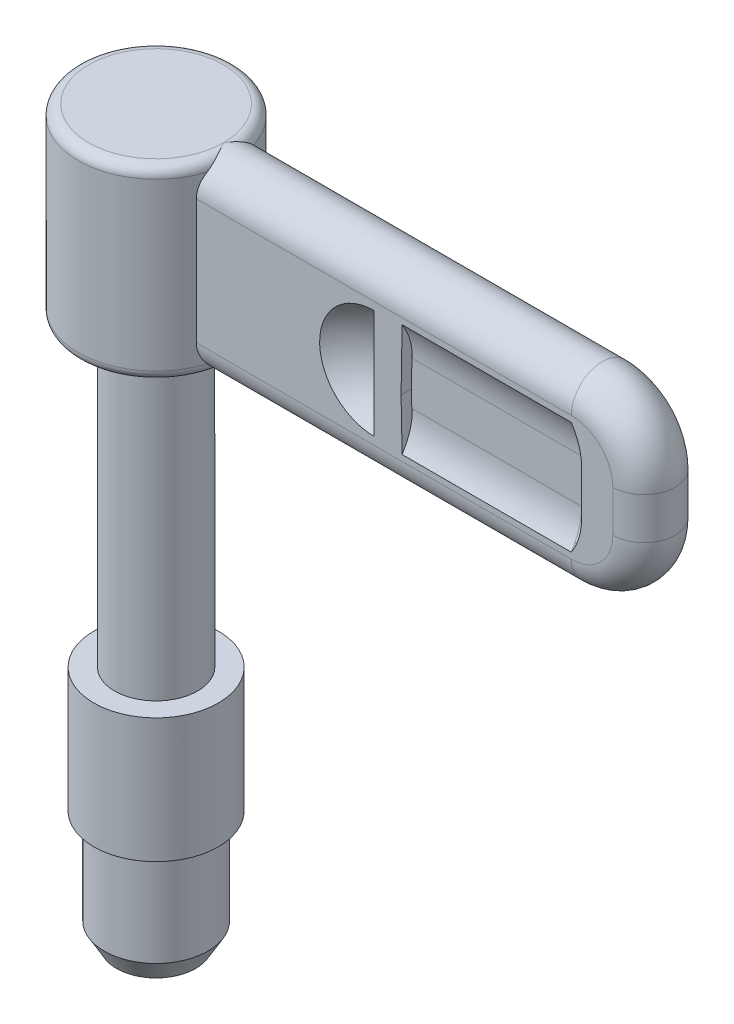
ISO-10303-21;
HEADER;
FILE_DESCRIPTION(('STEP AP214'),'2;1');
FILE_NAME('part.step','',(''),(''),'','','');
FILE_SCHEMA(('AUTOMOTIVE_DESIGN { 1 0 10303 214 1 1 1 1 }'));
ENDSEC;
DATA;
#1=APPLICATION_CONTEXT('core data for automotive mechanical design processes');
#2=APPLICATION_PROTOCOL_DEFINITION('international standard','automotive_design',2000,#1);
#3=PRODUCT_CONTEXT('',#1,'mechanical');
#4=PRODUCT('Part','Part','',(#3));
#5=PRODUCT_RELATED_PRODUCT_CATEGORY('part','',(#4));
#6=PRODUCT_DEFINITION_FORMATION('','',#4);
#7=PRODUCT_DEFINITION_CONTEXT('part definition',#1,'design');
#8=PRODUCT_DEFINITION('design','',#6,#7);
#9=PRODUCT_DEFINITION_SHAPE('','',#8);
#10=(LENGTH_UNIT() NAMED_UNIT(*) SI_UNIT(.MILLI.,.METRE.));
#11=(NAMED_UNIT(*) PLANE_ANGLE_UNIT() SI_UNIT($,.RADIAN.));
#12=(NAMED_UNIT(*) SI_UNIT($,.STERADIAN.) SOLID_ANGLE_UNIT());
#13=UNCERTAINTY_MEASURE_WITH_UNIT(LENGTH_MEASURE(1.E-05),#10,'distance_accuracy_value','');
#14=(GEOMETRIC_REPRESENTATION_CONTEXT(3) GLOBAL_UNCERTAINTY_ASSIGNED_CONTEXT((#13)) GLOBAL_UNIT_ASSIGNED_CONTEXT((#10,
#11,#12)) REPRESENTATION_CONTEXT('',''));
#15=CARTESIAN_POINT('',(0.,0.,0.));
#16=DIRECTION('',(0.,0.,1.));
#17=DIRECTION('',(1.,0.,0.));
#18=AXIS2_PLACEMENT_3D('',#15,#16,#17);
#19=CARTESIAN_POINT('',(0.,-12.,0.));
#20=DIRECTION('',(0.,-1.,0.));
#21=DIRECTION('',(7.69327835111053E-10,0.,1.));
#22=AXIS2_PLACEMENT_3D('',#19,#20,#21);
#23=CYLINDRICAL_SURFACE('',#22,6.);
#24=CARTESIAN_POINT('',(0.,0.,0.));
#25=DIRECTION('',(0.,-1.,0.));
#26=DIRECTION('',(0.,0.,-1.));
#27=AXIS2_PLACEMENT_3D('',#24,#25,#26);
#28=CIRCLE('',#27,6.);
#29=CARTESIAN_POINT('',(0.,0.,-6.));
#30=VERTEX_POINT('',#29);
#31=EDGE_CURVE('E563',#30,#30,#28,.T.);
#32=ORIENTED_EDGE('',*,*,#31,.F.);
#33=EDGE_LOOP('',(#32));
#34=FACE_BOUND('',#33,.T.);
#35=CARTESIAN_POINT('',(0.,12.,0.));
#36=DIRECTION('',(0.,1.,0.));
#37=DIRECTION('',(0.,0.,1.));
#38=AXIS2_PLACEMENT_3D('',#35,#36,#37);
#39=CIRCLE('',#38,6.);
#40=CARTESIAN_POINT('',(0.,12.,6.));
#41=VERTEX_POINT('',#40);
#42=EDGE_CURVE('E22',#41,#41,#39,.F.);
#43=ORIENTED_EDGE('',*,*,#42,.T.);
#44=EDGE_LOOP('',(#43));
#45=FACE_BOUND('',#44,.T.);
#46=ADVANCED_FACE('F14',(#34,#45),#23,.T.);
#47=CARTESIAN_POINT('',(-5.98600601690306,0.,-5.8267949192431));
#48=DIRECTION('',(0.,-1.,0.));
#49=DIRECTION('',(1.,0.,0.));
#50=AXIS2_PLACEMENT_3D('',#47,#48,#49);
#51=PLANE('',#50);
#52=CARTESIAN_POINT('',(0.,0.,0.));
#53=DIRECTION('',(0.,-1.,0.));
#54=DIRECTION('',(0.,0.,-1.));
#55=AXIS2_PLACEMENT_3D('',#52,#53,#54);
#56=CIRCLE('',#55,4.9);
#57=CARTESIAN_POINT('',(0.,0.,-4.9));
#58=VERTEX_POINT('',#57);
#59=EDGE_CURVE('E567',#58,#58,#56,.T.);
#60=ORIENTED_EDGE('',*,*,#59,.F.);
#61=EDGE_LOOP('',(#60));
#62=FACE_BOUND('',#61,.T.);
#63=ORIENTED_EDGE('',*,*,#31,.T.);
#64=EDGE_LOOP('',(#63));
#65=FACE_BOUND('',#64,.T.);
#66=ADVANCED_FACE('F16',(#62,#65),#51,.T.);
#67=CARTESIAN_POINT('',(-2.87487048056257E-12,-1.99999999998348,0.));
#68=DIRECTION('',(0.,-1.,0.));
#69=DIRECTION('',(-1.,0.,0.));
#70=AXIS2_PLACEMENT_3D('',#67,#68,#69);
#71=SPHERICAL_SURFACE('',#70,10.0000000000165);
#72=CARTESIAN_POINT('',(0.,-11.2409344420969,0.));
#73=DIRECTION('',(0.,1.,0.));
#74=DIRECTION('',(-1.,0.,0.));
#75=AXIS2_PLACEMENT_3D('',#72,#73,#74);
#76=CIRCLE('',#75,3.8216659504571);
#77=CARTESIAN_POINT('',(-3.8216659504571,-11.2409344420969,0.));
#78=VERTEX_POINT('',#77);
#79=EDGE_CURVE('E559',#78,#78,#76,.F.);
#80=ORIENTED_EDGE('',*,*,#79,.T.);
#81=EDGE_LOOP('',(#80));
#82=FACE_BOUND('',#81,.T.);
#83=ADVANCED_FACE('F1031',(#82),#71,.T.);
#84=CARTESIAN_POINT('',(0.,-9.2,0.));
#85=DIRECTION('',(0.,1.,0.));
#86=DIRECTION('',(0.,0.,-1.));
#87=AXIS2_PLACEMENT_3D('',#84,#85,#86);
#88=CONICAL_SURFACE('',#87,5.,0.52359877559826);
#89=ORIENTED_EDGE('',*,*,#79,.F.);
#90=EDGE_LOOP('',(#89));
#91=FACE_BOUND('',#90,.T.);
#92=CARTESIAN_POINT('',(0.,-9.2,0.));
#93=DIRECTION('',(0.,1.,0.));
#94=DIRECTION('',(0.,0.,-1.));
#95=AXIS2_PLACEMENT_3D('',#92,#93,#94);
#96=CIRCLE('',#95,5.);
#97=CARTESIAN_POINT('',(0.,-9.2,-5.));
#98=VERTEX_POINT('',#97);
#99=EDGE_CURVE('E1024',#98,#98,#96,.F.);
#100=ORIENTED_EDGE('',*,*,#99,.T.);
#101=EDGE_LOOP('',(#100));
#102=FACE_BOUND('',#101,.T.);
#103=ADVANCED_FACE('F1033',(#91,#102),#88,.T.);
#104=CARTESIAN_POINT('',(0.,-12.,0.));
#105=DIRECTION('',(0.,-1.,0.));
#106=DIRECTION('',(7.69370911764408E-10,0.,1.));
#107=AXIS2_PLACEMENT_3D('',#104,#105,#106);
#108=CYLINDRICAL_SURFACE('',#107,5.);
#109=ORIENTED_EDGE('',*,*,#99,.F.);
#110=EDGE_LOOP('',(#109));
#111=FACE_BOUND('',#110,.T.);
#112=CARTESIAN_POINT('',(0.,-0.5,0.));
#113=DIRECTION('',(0.,1.,0.));
#114=DIRECTION('',(0.,0.,-1.));
#115=AXIS2_PLACEMENT_3D('',#112,#113,#114);
#116=CIRCLE('',#115,5.);
#117=CARTESIAN_POINT('',(0.,-0.5,-5.));
#118=VERTEX_POINT('',#117);
#119=EDGE_CURVE('E1022',#118,#118,#116,.F.);
#120=ORIENTED_EDGE('',*,*,#119,.T.);
#121=EDGE_LOOP('',(#120));
#122=FACE_BOUND('',#121,.T.);
#123=ADVANCED_FACE('F1035',(#111,#122),#108,.T.);
#124=CARTESIAN_POINT('',(0.,-0.5,0.));
#125=DIRECTION('',(0.,-1.,0.));
#126=DIRECTION('',(1.92344485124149E-10,0.,1.));
#127=AXIS2_PLACEMENT_3D('',#124,#125,#126);
#128=CONICAL_SURFACE('',#127,5.,0.349065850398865);
#129=ORIENTED_EDGE('',*,*,#119,.F.);
#130=EDGE_LOOP('',(#129));
#131=FACE_BOUND('',#130,.T.);
#132=CARTESIAN_POINT('',(0.,-0.22525225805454,0.));
#133=DIRECTION('',(0.,1.,0.));
#134=DIRECTION('',(0.,0.,-1.));
#135=AXIS2_PLACEMENT_3D('',#132,#133,#134);
#136=CIRCLE('',#135,4.9);
#137=CARTESIAN_POINT('',(0.,-0.22525225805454,-4.9));
#138=VERTEX_POINT('',#137);
#139=EDGE_CURVE('E1014',#138,#138,#136,.F.);
#140=ORIENTED_EDGE('',*,*,#139,.T.);
#141=EDGE_LOOP('',(#140));
#142=FACE_BOUND('',#141,.T.);
#143=ADVANCED_FACE('F1043',(#131,#142),#128,.T.);
#144=CARTESIAN_POINT('',(0.,-12.,0.));
#145=DIRECTION('',(0.,-1.,0.));
#146=DIRECTION('',(7.69377573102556E-10,0.,1.));
#147=AXIS2_PLACEMENT_3D('',#144,#145,#146);
#148=CYLINDRICAL_SURFACE('',#147,4.9);
#149=ORIENTED_EDGE('',*,*,#139,.F.);
#150=EDGE_LOOP('',(#149));
#151=FACE_BOUND('',#150,.T.);
#152=ORIENTED_EDGE('',*,*,#59,.T.);
#153=EDGE_LOOP('',(#152));
#154=FACE_BOUND('',#153,.T.);
#155=ADVANCED_FACE('F1061',(#151,#154),#148,.T.);
#156=CARTESIAN_POINT('',(-5.98600601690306,12.,5.8267949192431));
#157=DIRECTION('',(0.,1.,0.));
#158=DIRECTION('',(1.,0.,0.));
#159=AXIS2_PLACEMENT_3D('',#156,#157,#158);
#160=PLANE('',#159);
#161=ORIENTED_EDGE('',*,*,#42,.F.);
#162=EDGE_LOOP('',(#161));
#163=FACE_BOUND('',#162,.T.);
#164=CARTESIAN_POINT('',(0.,12.,0.));
#165=DIRECTION('',(0.,-1.,0.));
#166=DIRECTION('',(0.,0.,1.));
#167=AXIS2_PLACEMENT_3D('',#164,#165,#166);
#168=CIRCLE('',#167,4.);
#169=CARTESIAN_POINT('',(0.,12.,4.));
#170=VERTEX_POINT('',#169);
#171=EDGE_CURVE('E570',#170,#170,#168,.T.);
#172=ORIENTED_EDGE('',*,*,#171,.T.);
#173=EDGE_LOOP('',(#172));
#174=FACE_BOUND('',#173,.T.);
#175=ADVANCED_FACE('F1058',(#163,#174),#160,.T.);
#176=CARTESIAN_POINT('',(0.,-12.,0.));
#177=DIRECTION('',(0.,-1.,0.));
#178=DIRECTION('',(7.69313624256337E-10,0.,1.));
#179=AXIS2_PLACEMENT_3D('',#176,#177,#178);
#180=CYLINDRICAL_SURFACE('',#179,4.);
#181=CARTESIAN_POINT('',(0.,41.,0.));
#182=DIRECTION('',(0.,-1.,0.));
#183=DIRECTION('',(0.,0.,-1.));
#184=AXIS2_PLACEMENT_3D('',#181,#182,#183);
#185=CIRCLE('',#184,4.);
#186=CARTESIAN_POINT('',(0.,41.,-4.));
#187=VERTEX_POINT('',#186);
#188=EDGE_CURVE('E9',#187,#187,#185,.F.);
#189=ORIENTED_EDGE('',*,*,#188,.F.);
#190=EDGE_LOOP('',(#189));
#191=FACE_BOUND('',#190,.T.);
#192=ORIENTED_EDGE('',*,*,#171,.F.);
#193=EDGE_LOOP('',(#192));
#194=FACE_BOUND('',#193,.T.);
#195=ADVANCED_FACE('F1060',(#191,#194),#180,.T.);
#196=CARTESIAN_POINT('',(26.7,52.1,-3.0000000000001));
#197=DIRECTION('',(-1.,0.,0.));
#198=DIRECTION('',(0.,0.,1.));
#199=AXIS2_PLACEMENT_3D('',#196,#197,#198);
#200=PLANE('',#199);
#201=CARTESIAN_POINT('',(26.7,52.1,-7.99999999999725));
#202=DIRECTION('',(1.,0.,0.));
#203=DIRECTION('',(0.,0.552770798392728,0.833333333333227));
#204=AXIS2_PLACEMENT_3D('',#201,#202,#203);
#205=CIRCLE('',#204,5.99999999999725);
#206=CARTESIAN_POINT('',(26.7,55.4166247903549,-3.));
#207=VERTEX_POINT('',#206);
#208=CARTESIAN_POINT('',(26.7,52.1,-2.));
#209=VERTEX_POINT('',#208);
#210=EDGE_CURVE('E836',#207,#209,#205,.T.);
#211=ORIENTED_EDGE('',*,*,#210,.T.);
#212=DIRECTION('',(0.,1.,0.));
#213=VECTOR('',#212,1.);
#214=CARTESIAN_POINT('',(26.7,52.1,-2.));
#215=LINE('',#214,#213);
#216=CARTESIAN_POINT('',(26.7,55.416624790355,-2.));
#217=VERTEX_POINT('',#216);
#218=EDGE_CURVE('E841',#209,#217,#215,.T.);
#219=ORIENTED_EDGE('',*,*,#218,.T.);
#220=DIRECTION('',(0.,0.,1.));
#221=VECTOR('',#220,1.);
#222=CARTESIAN_POINT('',(26.7,55.4166247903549,-3.0000000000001));
#223=LINE('',#222,#221);
#224=EDGE_CURVE('E819',#217,#207,#223,.F.);
#225=ORIENTED_EDGE('',*,*,#224,.T.);
#226=EDGE_LOOP('',(#211,#219,#225));
#227=FACE_BOUND('',#226,.T.);
#228=ADVANCED_FACE('F1078',(#227),#200,.T.);
#229=CARTESIAN_POINT('',(26.7,44.583375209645,-3.00000000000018));
#230=DIRECTION('',(-1.,0.,0.));
#231=DIRECTION('',(0.,0.,1.));
#232=AXIS2_PLACEMENT_3D('',#229,#230,#231);
#233=PLANE('',#232);
#234=CARTESIAN_POINT('',(26.7,47.9,-7.99999999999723));
#235=DIRECTION('',(1.,0.,0.));
#236=DIRECTION('',(0.,0.,1.));
#237=AXIS2_PLACEMENT_3D('',#234,#235,#236);
#238=CIRCLE('',#237,5.99999999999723);
#239=CARTESIAN_POINT('',(26.7,47.9,-2.));
#240=VERTEX_POINT('',#239);
#241=CARTESIAN_POINT('',(26.7,44.5833752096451,-3.0000000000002));
#242=VERTEX_POINT('',#241);
#243=EDGE_CURVE('E190',#240,#242,#238,.T.);
#244=ORIENTED_EDGE('',*,*,#243,.T.);
#245=DIRECTION('',(0.,-1.20792265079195E-13,1.));
#246=VECTOR('',#245,1.);
#247=CARTESIAN_POINT('',(26.7,44.5833752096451,-3.00000000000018));
#248=LINE('',#247,#246);
#249=CARTESIAN_POINT('',(26.7,44.583375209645,-2.));
#250=VERTEX_POINT('',#249);
#251=EDGE_CURVE('E207',#250,#242,#248,.F.);
#252=ORIENTED_EDGE('',*,*,#251,.F.);
#253=DIRECTION('',(0.,1.,0.));
#254=VECTOR('',#253,1.);
#255=CARTESIAN_POINT('',(26.7,44.583375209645,-2.));
#256=LINE('',#255,#254);
#257=EDGE_CURVE('E208',#250,#240,#256,.T.);
#258=ORIENTED_EDGE('',*,*,#257,.T.);
#259=EDGE_LOOP('',(#244,#252,#258));
#260=FACE_BOUND('',#259,.T.);
#261=ADVANCED_FACE('F206',(#260),#233,.T.);
#262=CARTESIAN_POINT('',(26.6,44.583375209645,-2.));
#263=DIRECTION('',(0.,0.,-1.));
#264=DIRECTION('',(0.,1.,0.));
#265=AXIS2_PLACEMENT_3D('',#262,#263,#264);
#266=PLANE('',#265);
#267=DIRECTION('',(-0.0168991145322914,-0.999857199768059,0.));
#268=VECTOR('',#267,1.);
#269=CARTESIAN_POINT('',(26.7,55.416624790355,-2.));
#270=LINE('',#269,#268);
#271=CARTESIAN_POINT('',(26.6,49.5,-2.));
#272=VERTEX_POINT('',#271);
#273=EDGE_CURVE('E824',#217,#272,#270,.T.);
#274=ORIENTED_EDGE('',*,*,#273,.F.);
#275=ORIENTED_EDGE('',*,*,#218,.F.);
#276=DIRECTION('',(1.,0.,0.));
#277=VECTOR('',#276,1.);
#278=CARTESIAN_POINT('',(26.7,52.1,-2.));
#279=LINE('',#278,#277);
#280=CARTESIAN_POINT('',(43.,52.1,-2.));
#281=VERTEX_POINT('',#280);
#282=EDGE_CURVE('E846',#209,#281,#279,.T.);
#283=ORIENTED_EDGE('',*,*,#282,.T.);
#284=DIRECTION('',(0.,-1.,0.));
#285=VECTOR('',#284,1.);
#286=CARTESIAN_POINT('',(43.,52.1,-2.));
#287=LINE('',#286,#285);
#288=CARTESIAN_POINT('',(43.,47.9,-2.));
#289=VERTEX_POINT('',#288);
#290=EDGE_CURVE('E850',#289,#281,#287,.F.);
#291=ORIENTED_EDGE('',*,*,#290,.F.);
#292=DIRECTION('',(-1.,0.,0.));
#293=VECTOR('',#292,1.);
#294=CARTESIAN_POINT('',(43.,47.9,-2.));
#295=LINE('',#294,#293);
#296=EDGE_CURVE('E854',#240,#289,#295,.F.);
#297=ORIENTED_EDGE('',*,*,#296,.F.);
#298=ORIENTED_EDGE('',*,*,#257,.F.);
#299=DIRECTION('',(0.020334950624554,-0.999793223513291,0.));
#300=VECTOR('',#299,1.);
#301=CARTESIAN_POINT('',(26.6,49.5,-2.));
#302=LINE('',#301,#300);
#303=EDGE_CURVE('E215',#272,#250,#302,.T.);
#304=ORIENTED_EDGE('',*,*,#303,.F.);
#305=EDGE_LOOP('',(#274,#275,#283,#291,#297,#298,#304));
#306=FACE_BOUND('',#305,.T.);
#307=ADVANCED_FACE('F880',(#306),#266,.T.);
#308=CARTESIAN_POINT('',(26.7,44.583375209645,3.));
#309=DIRECTION('',(-1.,0.,0.));
#310=DIRECTION('',(0.,1.,0.));
#311=AXIS2_PLACEMENT_3D('',#308,#309,#310);
#312=PLANE('',#311);
#313=DIRECTION('',(0.,1.,0.));
#314=VECTOR('',#313,1.);
#315=CARTESIAN_POINT('',(26.7,44.583375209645,2.));
#316=LINE('',#315,#314);
#317=CARTESIAN_POINT('',(26.7,44.583375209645,2.));
#318=VERTEX_POINT('',#317);
#319=CARTESIAN_POINT('',(26.7,47.9,2.));
#320=VERTEX_POINT('',#319);
#321=EDGE_CURVE('E1417',#318,#320,#316,.T.);
#322=ORIENTED_EDGE('',*,*,#321,.F.);
#323=DIRECTION('',(0.,0.,1.));
#324=VECTOR('',#323,1.);
#325=CARTESIAN_POINT('',(26.7,44.583375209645,2.));
#326=LINE('',#325,#324);
#327=CARTESIAN_POINT('',(26.7,44.583375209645,3.));
#328=VERTEX_POINT('',#327);
#329=EDGE_CURVE('E803',#318,#328,#326,.T.);
#330=ORIENTED_EDGE('',*,*,#329,.T.);
#331=CARTESIAN_POINT('',(26.7,47.9,7.99999999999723));
#332=DIRECTION('',(-1.,0.,0.));
#333=DIRECTION('',(0.,0.,-1.));
#334=AXIS2_PLACEMENT_3D('',#331,#332,#333);
#335=CIRCLE('',#334,5.99999999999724);
#336=EDGE_CURVE('E1419',#328,#320,#335,.F.);
#337=ORIENTED_EDGE('',*,*,#336,.T.);
#338=EDGE_LOOP('',(#322,#330,#337));
#339=FACE_BOUND('',#338,.T.);
#340=ADVANCED_FACE('F1283',(#339),#312,.T.);
#341=CARTESIAN_POINT('',(26.7,52.1,3.));
#342=DIRECTION('',(-1.,0.,0.));
#343=DIRECTION('',(0.,1.,0.));
#344=AXIS2_PLACEMENT_3D('',#341,#342,#343);
#345=PLANE('',#344);
#346=DIRECTION('',(0.,0.,-1.));
#347=VECTOR('',#346,1.);
#348=CARTESIAN_POINT('',(26.7,55.416624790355,3.));
#349=LINE('',#348,#347);
#350=CARTESIAN_POINT('',(26.7,55.416624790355,2.));
#351=VERTEX_POINT('',#350);
#352=CARTESIAN_POINT('',(26.7,55.416624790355,3.));
#353=VERTEX_POINT('',#352);
#354=EDGE_CURVE('E811',#351,#353,#349,.F.);
#355=ORIENTED_EDGE('',*,*,#354,.F.);
#356=DIRECTION('',(0.,1.,0.));
#357=VECTOR('',#356,1.);
#358=CARTESIAN_POINT('',(26.7,52.1,2.));
#359=LINE('',#358,#357);
#360=CARTESIAN_POINT('',(26.7,52.1,2.));
#361=VERTEX_POINT('',#360);
#362=EDGE_CURVE('E1433',#361,#351,#359,.T.);
#363=ORIENTED_EDGE('',*,*,#362,.F.);
#364=CARTESIAN_POINT('',(26.7,52.1,7.99999999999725));
#365=DIRECTION('',(-1.,0.,0.));
#366=DIRECTION('',(0.,0.552770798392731,-0.833333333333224));
#367=AXIS2_PLACEMENT_3D('',#364,#365,#366);
#368=CIRCLE('',#367,5.99999999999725);
#369=EDGE_CURVE('E707',#361,#353,#368,.F.);
#370=ORIENTED_EDGE('',*,*,#369,.T.);
#371=EDGE_LOOP('',(#355,#363,#370));
#372=FACE_BOUND('',#371,.T.);
#373=ADVANCED_FACE('F687',(#372),#345,.T.);
#374=CARTESIAN_POINT('',(43.,44.583375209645,2.));
#375=DIRECTION('',(0.,0.,1.));
#376=DIRECTION('',(0.,1.,0.));
#377=AXIS2_PLACEMENT_3D('',#374,#375,#376);
#378=PLANE('',#377);
#379=DIRECTION('',(0.,1.,0.));
#380=VECTOR('',#379,1.);
#381=CARTESIAN_POINT('',(43.,47.9,2.));
#382=LINE('',#381,#380);
#383=CARTESIAN_POINT('',(43.,47.9,2.));
#384=VERTEX_POINT('',#383);
#385=CARTESIAN_POINT('',(43.,52.1,2.));
#386=VERTEX_POINT('',#385);
#387=EDGE_CURVE('E1443',#384,#386,#382,.T.);
#388=ORIENTED_EDGE('',*,*,#387,.T.);
#389=DIRECTION('',(-1.,0.,0.));
#390=VECTOR('',#389,1.);
#391=CARTESIAN_POINT('',(43.,52.1,2.));
#392=LINE('',#391,#390);
#393=EDGE_CURVE('E1438',#361,#386,#392,.F.);
#394=ORIENTED_EDGE('',*,*,#393,.F.);
#395=ORIENTED_EDGE('',*,*,#362,.T.);
#396=DIRECTION('',(-0.0168991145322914,-0.999857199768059,0.));
#397=VECTOR('',#396,1.);
#398=CARTESIAN_POINT('',(26.7,55.416624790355,2.));
#399=LINE('',#398,#397);
#400=CARTESIAN_POINT('',(26.6,49.5,2.));
#401=VERTEX_POINT('',#400);
#402=EDGE_CURVE('E1423',#351,#401,#399,.T.);
#403=ORIENTED_EDGE('',*,*,#402,.T.);
#404=DIRECTION('',(0.020334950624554,-0.999793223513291,0.));
#405=VECTOR('',#404,1.);
#406=CARTESIAN_POINT('',(26.6,49.5,2.));
#407=LINE('',#406,#405);
#408=EDGE_CURVE('E1421',#401,#318,#407,.T.);
#409=ORIENTED_EDGE('',*,*,#408,.T.);
#410=ORIENTED_EDGE('',*,*,#321,.T.);
#411=DIRECTION('',(-1.,0.,0.));
#412=VECTOR('',#411,1.);
#413=CARTESIAN_POINT('',(43.,47.9,2.));
#414=LINE('',#413,#412);
#415=EDGE_CURVE('E672',#320,#384,#414,.F.);
#416=ORIENTED_EDGE('',*,*,#415,.T.);
#417=EDGE_LOOP('',(#388,#394,#395,#403,#409,#410,#416));
#418=FACE_BOUND('',#417,.T.);
#419=ADVANCED_FACE('F684',(#418),#378,.T.);
#420=CARTESIAN_POINT('',(-6.5919903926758,59.,6.64455372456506));
#421=DIRECTION('',(0.,1.,0.));
#422=DIRECTION('',(1.,0.,0.));
#423=AXIS2_PLACEMENT_3D('',#420,#421,#422);
#424=PLANE('',#423);
#425=CARTESIAN_POINT('',(0.,59.,0.));
#426=DIRECTION('',(0.,1.,0.));
#427=DIRECTION('',(-0.707106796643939,0.,0.707106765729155));
#428=AXIS2_PLACEMENT_3D('',#425,#426,#427);
#429=CIRCLE('',#428,6.50000008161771);
#430=CARTESIAN_POINT('',(6.50000008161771,59.,0.));
#431=VERTEX_POINT('',#430);
#432=EDGE_CURVE('E553',#431,#431,#429,.F.);
#433=ORIENTED_EDGE('',*,*,#432,.F.);
#434=EDGE_LOOP('',(#433));
#435=FACE_BOUND('',#434,.T.);
#436=ADVANCED_FACE('F486',(#435),#424,.T.);
#437=CARTESIAN_POINT('',(24.,50.,-8.5));
#438=DIRECTION('',(0.,1.,0.));
#439=DIRECTION('',(-0.708277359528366,0.,0.705934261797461));
#440=AXIS2_PLACEMENT_3D('',#437,#438,#439);
#441=SPHERICAL_SURFACE('',#440,7.6);
#442=CARTESIAN_POINT('',(24.,55.2449976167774,-3.00000000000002));
#443=CARTESIAN_POINT('',(24.,55.1577244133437,-2.91676991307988));
#444=CARTESIAN_POINT('',(24.,55.0684671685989,-2.83562060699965));
#445=CARTESIAN_POINT('',(24.,54.8861935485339,-2.67765966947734));
#446=CARTESIAN_POINT('',(24.,54.7931771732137,-2.60084803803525));
#447=CARTESIAN_POINT('',(24.,54.6035942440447,-2.45173856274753));
#448=CARTESIAN_POINT('',(24.,54.507027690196,-2.3794407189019));
#449=CARTESIAN_POINT('',(24.,54.3105636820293,-2.23952207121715));
#450=CARTESIAN_POINT('',(24.,54.2106662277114,-2.17190126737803));
#451=CARTESIAN_POINT('',(24.,54.0077666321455,-2.04149006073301));
#452=CARTESIAN_POINT('',(24.,53.9047644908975,-1.97869965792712));
#453=CARTESIAN_POINT('',(24.,53.6958889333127,-1.85809148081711));
#454=CARTESIAN_POINT('',(24.,53.5900155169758,-1.80027370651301));
#455=CARTESIAN_POINT('',(24.,53.3756372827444,-1.68974179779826));
#456=CARTESIAN_POINT('',(24.,53.2671324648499,-1.63702766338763));
#457=CARTESIAN_POINT('',(24.,53.0477372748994,-1.53682246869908));
#458=CARTESIAN_POINT('',(24.,52.9368469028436,-1.48933140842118));
#459=CARTESIAN_POINT('',(24.,52.7129318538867,-1.39967996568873));
#460=CARTESIAN_POINT('',(24.,52.5999071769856,-1.35751958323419));
#461=CARTESIAN_POINT('',(24.,52.3719796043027,-1.27862502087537));
#462=CARTESIAN_POINT('',(24.,52.2570767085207,-1.24189084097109));
#463=CARTESIAN_POINT('',(24.,52.0256530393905,-1.17393191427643));
#464=CARTESIAN_POINT('',(24.,51.9091322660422,-1.14270716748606));
#465=CARTESIAN_POINT('',(24.,51.6747368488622,-1.08583785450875));
#466=CARTESIAN_POINT('',(24.,51.5568622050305,-1.06019328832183));
#467=CARTESIAN_POINT('',(24.,51.320026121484,-1.01454244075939));
#468=CARTESIAN_POINT('',(24.,51.2010646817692,-0.994536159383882));
#469=CARTESIAN_POINT('',(24.,50.9623245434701,-0.960207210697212));
#470=CARTESIAN_POINT('',(24.,50.8425458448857,-0.945884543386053));
#471=CARTESIAN_POINT('',(24.,50.6024425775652,-0.922955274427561));
#472=CARTESIAN_POINT('',(24.,50.482118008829,-0.91434867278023));
#473=CARTESIAN_POINT('',(24.,50.2411956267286,-0.902871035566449));
#474=CARTESIAN_POINT('',(24.,50.1205978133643,-0.899999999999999));
#475=CARTESIAN_POINT('',(24.,49.8794021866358,-0.899999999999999));
#476=CARTESIAN_POINT('',(24.,49.7588043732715,-0.902871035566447));
#477=CARTESIAN_POINT('',(24.,49.517881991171,-0.914348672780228));
#478=CARTESIAN_POINT('',(24.,49.3975574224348,-0.922955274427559));
#479=CARTESIAN_POINT('',(24.,49.1574541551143,-0.94588454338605));
#480=CARTESIAN_POINT('',(24.,49.03767545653,-0.960207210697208));
#481=CARTESIAN_POINT('',(24.,48.7989353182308,-0.994536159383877));
#482=CARTESIAN_POINT('',(24.,48.679973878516,-1.01454244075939));
#483=CARTESIAN_POINT('',(24.,48.4431377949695,-1.06019328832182));
#484=CARTESIAN_POINT('',(24.,48.3252631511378,-1.08583785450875));
#485=CARTESIAN_POINT('',(24.,48.0908677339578,-1.14270716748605));
#486=CARTESIAN_POINT('',(24.,47.9743469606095,-1.17393191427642));
#487=CARTESIAN_POINT('',(24.,47.7429232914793,-1.24189084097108));
#488=CARTESIAN_POINT('',(24.,47.6280203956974,-1.27862502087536));
#489=CARTESIAN_POINT('',(24.,47.4000928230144,-1.35751958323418));
#490=CARTESIAN_POINT('',(24.,47.2870681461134,-1.39967996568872));
#491=CARTESIAN_POINT('',(24.,47.0631530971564,-1.48933140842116));
#492=CARTESIAN_POINT('',(24.,46.9522627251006,-1.53682246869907));
#493=CARTESIAN_POINT('',(24.,46.7328675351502,-1.63702766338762));
#494=CARTESIAN_POINT('',(24.,46.6243627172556,-1.68974179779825));
#495=CARTESIAN_POINT('',(24.,46.4099844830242,-1.80027370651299));
#496=CARTESIAN_POINT('',(24.,46.3041110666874,-1.8580914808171));
#497=CARTESIAN_POINT('',(24.,46.0952355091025,-1.97869965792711));
#498=CARTESIAN_POINT('',(24.,45.9922333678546,-2.041490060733));
#499=CARTESIAN_POINT('',(24.,45.7893337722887,-2.17190126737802));
#500=CARTESIAN_POINT('',(24.,45.6894363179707,-2.23952207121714));
#501=CARTESIAN_POINT('',(24.,45.492972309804,-2.37944071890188));
#502=CARTESIAN_POINT('',(24.,45.3964057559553,-2.45173856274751));
#503=CARTESIAN_POINT('',(24.,45.2068228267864,-2.60084803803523));
#504=CARTESIAN_POINT('',(24.,45.1138064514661,-2.67765966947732));
#505=CARTESIAN_POINT('',(24.,44.9315328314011,-2.83562060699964));
#506=CARTESIAN_POINT('',(24.,44.8422755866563,-2.91676991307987));
#507=CARTESIAN_POINT('',(24.,44.7550023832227,-3.));
#508=B_SPLINE_CURVE_WITH_KNOTS('',3,(#442,#443,#444,#445,#446,#447,#448,#449,#450,#451,#452,
#453,#454,#455,#456,#457,#458,#459,#460,#461,#462,#463,#464,#465,#466,#467,#468,#469,#470,#471,
#472,#473,#474,#475,#476,#477,#478,#479,#480,#481,#482,#483,#484,#485,#486,#487,#488,#489,#490,
#491,#492,#493,#494,#495,#496,#497,#498,#499,#500,#501,#502,#503,#504,#505,#506,#507),
.UNSPECIFIED.,.F.,.F.,(4,2,2,2,2,2,2,2,2,2,2,2,2,2,2,2,2,2,2,2,2,2,2,2,2,2,2,2,2,2,2,2,4),(0.,
0.361759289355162,0.723518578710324,1.08527786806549,1.44703715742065,1.80879644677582,
2.17055573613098,2.53231502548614,2.8940743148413,3.25583360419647,3.61759289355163,
3.9793521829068,4.34111147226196,4.70287076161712,5.06463005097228,5.42638934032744,
5.78814862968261,6.14990791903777,6.51166720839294,6.8734264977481,7.23518578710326,
7.59694507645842,7.95870436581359,8.32046365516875,8.68222294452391,9.04398223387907,
9.40574152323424,9.7675008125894,10.1292601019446,10.4910193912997,10.8527786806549,
11.2145379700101,11.5762972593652),.UNSPECIFIED.);
#509=CARTESIAN_POINT('',(24.,55.2449976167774,-3.));
#510=VERTEX_POINT('',#509);
#511=CARTESIAN_POINT('',(24.,44.7550023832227,-3.));
#512=VERTEX_POINT('',#511);
#513=EDGE_CURVE('E574',#510,#512,#508,.T.);
#514=ORIENTED_EDGE('',*,*,#513,.T.);
#515=CARTESIAN_POINT('',(24.,55.2449976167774,-3.));
#516=CARTESIAN_POINT('',(23.7151261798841,55.2449976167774,-3.));
#517=CARTESIAN_POINT('',(23.4388980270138,55.2229701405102,-3.));
#518=CARTESIAN_POINT('',(22.9004954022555,55.1370623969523,-3.));
#519=CARTESIAN_POINT('',(22.6383209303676,55.0731821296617,-3.));
#520=CARTESIAN_POINT('',(21.999053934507,54.8647817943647,-3.));
#521=CARTESIAN_POINT('',(21.6315064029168,54.6967726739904,-3.));
#522=CARTESIAN_POINT('',(20.8874735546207,54.2499361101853,-3.));
#523=CARTESIAN_POINT('',(20.5168752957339,53.9506197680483,-3.));
#524=CARTESIAN_POINT('',(19.5480014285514,52.9256197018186,-3.));
#525=CARTESIAN_POINT('',(19.0979860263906,52.0890991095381,-3.));
#526=CARTESIAN_POINT('',(18.4825352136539,49.4183108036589,-3.));
#527=CARTESIAN_POINT('',(19.0111775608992,47.5712756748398,-3.));
#528=CARTESIAN_POINT('',(20.6757585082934,45.9066947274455,-3.));
#529=CARTESIAN_POINT('',(21.1114175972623,45.5831930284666,-3.));
#530=CARTESIAN_POINT('',(21.9715509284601,45.147582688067,-3.));
#531=CARTESIAN_POINT('',(22.3462263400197,45.0053369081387,-3.));
#532=CARTESIAN_POINT('',(23.1510585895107,44.8057548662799,-3.));
#533=CARTESIAN_POINT('',(23.5704816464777,44.7550023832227,-3.));
#534=CARTESIAN_POINT('',(24.,44.7550023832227,-3.));
#535=B_SPLINE_CURVE_WITH_KNOTS('',3,(#515,#516,#517,#518,#519,#520,#521,#522,#523,#524,#525,
#526,#527,#528,#529,#530,#531,#532,#533,#534),.UNSPECIFIED.,.F.,.F.,(4,2,2,2,2,2,2,2,2,4),(0.,
0.0494877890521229,0.0989755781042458,0.172696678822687,0.262079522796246,0.433728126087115,
0.763636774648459,0.862742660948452,0.930192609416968,1.),.UNSPECIFIED.);
#536=EDGE_CURVE('E276',#510,#512,#535,.T.);
#537=ORIENTED_EDGE('',*,*,#536,.F.);
#538=EDGE_LOOP('',(#514,#537));
#539=FACE_BOUND('',#538,.T.);
#540=ADVANCED_FACE('F631',(#539),#441,.F.);
#541=CARTESIAN_POINT('',(24.,44.7550023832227,-0.899999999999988));
#542=DIRECTION('',(-1.,0.,0.));
#543=DIRECTION('',(0.,1.,0.));
#544=AXIS2_PLACEMENT_3D('',#541,#542,#543);
#545=PLANE('',#544);
#546=ORIENTED_EDGE('',*,*,#513,.F.);
#547=DIRECTION('',(0.,1.,0.));
#548=VECTOR('',#547,1.);
#549=CARTESIAN_POINT('',(24.,44.7550023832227,-3.));
#550=LINE('',#549,#548);
#551=EDGE_CURVE('E1395',#512,#510,#550,.T.);
#552=ORIENTED_EDGE('',*,*,#551,.F.);
#553=EDGE_LOOP('',(#546,#552));
#554=FACE_BOUND('',#553,.T.);
#555=ADVANCED_FACE('F640',(#554),#545,.T.);
#556=CARTESIAN_POINT('',(26.6,49.5,-3.0000000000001));
#557=DIRECTION('',(0.999857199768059,-0.0168991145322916,0.));
#558=DIRECTION('',(0.0168991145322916,0.999857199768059,0.));
#559=AXIS2_PLACEMENT_3D('',#556,#557,#558);
#560=PLANE('',#559);
#561=DIRECTION('',(-0.0168991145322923,-0.999857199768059,0.));
#562=VECTOR('',#561,1.);
#563=CARTESIAN_POINT('',(26.7,55.4166247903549,-3.));
#564=LINE('',#563,#562);
#565=CARTESIAN_POINT('',(26.6,49.5,-3.));
#566=VERTEX_POINT('',#565);
#567=EDGE_CURVE('E222',#207,#566,#564,.T.);
#568=ORIENTED_EDGE('',*,*,#567,.F.);
#569=ORIENTED_EDGE('',*,*,#224,.F.);
#570=ORIENTED_EDGE('',*,*,#273,.T.);
#571=DIRECTION('',(0.,0.,-1.));
#572=VECTOR('',#571,1.);
#573=CARTESIAN_POINT('',(26.6,49.5,-2.));
#574=LINE('',#573,#572);
#575=EDGE_CURVE('E829',#272,#566,#574,.T.);
#576=ORIENTED_EDGE('',*,*,#575,.T.);
#577=EDGE_LOOP('',(#568,#569,#570,#576));
#578=FACE_BOUND('',#577,.T.);
#579=ADVANCED_FACE('F978',(#578),#560,.T.);
#580=CARTESIAN_POINT('',(26.7,52.1,-7.99999999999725));
#581=DIRECTION('',(1.,0.,0.));
#582=DIRECTION('',(0.,0.552770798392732,0.833333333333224));
#583=AXIS2_PLACEMENT_3D('',#580,#581,#582);
#584=CYLINDRICAL_SURFACE('',#583,5.99999999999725);
#585=CARTESIAN_POINT('',(43.,52.1,-2.));
#586=CARTESIAN_POINT('',(43.,52.1732258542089,-2.00043940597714));
#587=CARTESIAN_POINT('',(43.,52.2464467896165,-2.00209048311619));
#588=CARTESIAN_POINT('',(43.,52.3928080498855,-2.00787615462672));
#589=CARTESIAN_POINT('',(43.,52.465948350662,-2.01201135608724));
#590=CARTESIAN_POINT('',(43.,52.6120368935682,-2.02282494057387));
#591=CARTESIAN_POINT('',(43.,52.6849851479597,-2.02950315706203));
#592=CARTESIAN_POINT('',(43.,52.8305801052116,-2.04544741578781));
#593=CARTESIAN_POINT('',(43.,52.9032268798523,-2.054712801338));
#594=CARTESIAN_POINT('',(43.,53.0481135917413,-2.07586380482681));
#595=CARTESIAN_POINT('',(43.,53.1203536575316,-2.0877485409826));
#596=CARTESIAN_POINT('',(43.,53.2643253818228,-2.1141574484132));
#597=CARTESIAN_POINT('',(43.,53.336057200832,-2.12868074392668));
#598=CARTESIAN_POINT('',(43.,53.4789148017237,-2.16037287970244));
#599=CARTESIAN_POINT('',(43.,53.5500407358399,-2.17754103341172));
#600=CARTESIAN_POINT('',(43.,53.69159288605,-2.21451579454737));
#601=CARTESIAN_POINT('',(43.,53.7620191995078,-2.23432202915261));
#602=CARTESIAN_POINT('',(43.,53.9020824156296,-2.2765526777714));
#603=CARTESIAN_POINT('',(43.,53.9717193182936,-2.29897709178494));
#604=CARTESIAN_POINT('',(43.,54.110118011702,-2.3464106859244));
#605=CARTESIAN_POINT('',(43.,54.1788796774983,-2.37142023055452));
#606=CARTESIAN_POINT('',(43.,54.3154461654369,-2.42397762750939));
#607=CARTESIAN_POINT('',(43.,54.3832507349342,-2.45152613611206));
#608=CARTESIAN_POINT('',(43.,54.5178252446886,-2.50910207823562));
#609=CARTESIAN_POINT('',(43.,54.5845948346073,-2.53913033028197));
#610=CARTESIAN_POINT('',(43.,54.7170254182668,-2.60159363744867));
#611=CARTESIAN_POINT('',(43.,54.782686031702,-2.63402949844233));
#612=CARTESIAN_POINT('',(43.,54.9128286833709,-2.70122325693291));
#613=CARTESIAN_POINT('',(43.,54.9773104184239,-2.73598174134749));
#614=CARTESIAN_POINT('',(43.,55.1050283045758,-2.80772390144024));
#615=CARTESIAN_POINT('',(43.,55.1682643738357,-2.84470772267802));
#616=CARTESIAN_POINT('',(43.,55.2934302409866,-2.92079056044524));
#617=CARTESIAN_POINT('',(43.,55.355360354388,-2.95988905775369));
#618=CARTESIAN_POINT('',(43.,55.4166247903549,-3.00000000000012));
#619=B_SPLINE_CURVE_WITH_KNOTS('',3,(#585,#586,#587,#588,#589,#590,#591,#592,#593,#594,#595,
#596,#597,#598,#599,#600,#601,#602,#603,#604,#605,#606,#607,#608,#609,#610,#611,#612,#613,#614,
#615,#616,#617,#618),.UNSPECIFIED.,.F.,.F.,(4,2,2,2,2,2,2,2,2,2,2,2,2,2,2,2,4),(0.,
0.219674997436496,0.439403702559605,0.659118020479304,0.878776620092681,1.09836138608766,
1.31787340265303,1.53732853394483,1.75675268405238,1.97617683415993,2.19563196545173,
2.4151439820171,2.63472874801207,2.85438734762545,3.07410166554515,3.29383037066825,
3.51350536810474),.UNSPECIFIED.);
#620=CARTESIAN_POINT('',(43.,55.4166247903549,-3.));
#621=VERTEX_POINT('',#620);
#622=EDGE_CURVE('E38',#621,#281,#619,.F.);
#623=ORIENTED_EDGE('',*,*,#622,.T.);
#624=ORIENTED_EDGE('',*,*,#282,.F.);
#625=ORIENTED_EDGE('',*,*,#210,.F.);
#626=DIRECTION('',(-1.,0.,0.));
#627=VECTOR('',#626,1.);
#628=CARTESIAN_POINT('',(43.,55.4166247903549,-3.));
#629=LINE('',#628,#627);
#630=EDGE_CURVE('E1396',#207,#621,#629,.F.);
#631=ORIENTED_EDGE('',*,*,#630,.T.);
#632=EDGE_LOOP('',(#623,#624,#625,#631));
#633=FACE_BOUND('',#632,.T.);
#634=ADVANCED_FACE('F939',(#633),#584,.F.);
#635=CARTESIAN_POINT('',(43.,55.4166247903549,-3.00000000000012));
#636=CARTESIAN_POINT('',(43.,53.9057892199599,-2.01087470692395));
#637=CARTESIAN_POINT('',(43.,52.1,-2.));
#638=CARTESIAN_POINT('',(43.,55.4166247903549,-3.00000000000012));
#639=CARTESIAN_POINT('',(43.388428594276,53.9057892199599,-2.01087470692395));
#640=CARTESIAN_POINT('',(43.3926990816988,52.1,-2.));
#641=CARTESIAN_POINT('',(43.,55.4166247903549,-3.00000000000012));
#642=CARTESIAN_POINT('',(43.7818890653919,53.9057892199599,-2.21811093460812));
#643=CARTESIAN_POINT('',(43.7904853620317,52.1,-2.20951463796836));
#644=CARTESIAN_POINT('',(43.,55.4166247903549,-3.00000000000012));
#645=CARTESIAN_POINT('',(43.989125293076,53.9057892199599,-2.61157140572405));
#646=CARTESIAN_POINT('',(44.,52.1,-2.60730091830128));
#647=CARTESIAN_POINT('',(43.,55.4166247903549,-3.00000000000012));
#648=CARTESIAN_POINT('',(43.989125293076,53.9057892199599,-3.));
#649=CARTESIAN_POINT('',(44.,52.1,-3.));
#650=B_SPLINE_SURFACE_WITH_KNOTS('',4,2,((#635,#636,#637),(#638,#639,#640),(#641,#642,#643),
(#644,#645,#646),(#647,#648,#649)),.UNSPECIFIED.,.F.,.F.,.F.,(5,5),(3,3),(0.,1.),(0.,1.),.UNSPECIFIED.);
#651=CARTESIAN_POINT('',(43.,55.4166247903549,-3.00000000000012));
#652=CARTESIAN_POINT('',(43.0401109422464,55.355360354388,-3.00000000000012));
#653=CARTESIAN_POINT('',(43.0792094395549,55.2934302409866,-3.00000000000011));
#654=CARTESIAN_POINT('',(43.1552922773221,55.1682643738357,-3.0000000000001));
#655=CARTESIAN_POINT('',(43.1922760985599,55.1050283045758,-3.0000000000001));
#656=CARTESIAN_POINT('',(43.2640182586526,54.9773104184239,-3.00000000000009));
#657=CARTESIAN_POINT('',(43.2987767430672,54.9128286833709,-3.00000000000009));
#658=CARTESIAN_POINT('',(43.3659705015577,54.7826860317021,-3.00000000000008));
#659=CARTESIAN_POINT('',(43.3984063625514,54.7170254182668,-3.00000000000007));
#660=CARTESIAN_POINT('',(43.4608696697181,54.5845948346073,-3.00000000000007));
#661=CARTESIAN_POINT('',(43.4908979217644,54.5178252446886,-3.00000000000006));
#662=CARTESIAN_POINT('',(43.548473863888,54.3832507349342,-3.00000000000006));
#663=CARTESIAN_POINT('',(43.5760223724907,54.3154461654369,-3.00000000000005));
#664=CARTESIAN_POINT('',(43.6285797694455,54.1788796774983,-3.00000000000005));
#665=CARTESIAN_POINT('',(43.6535893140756,54.110118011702,-3.00000000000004));
#666=CARTESIAN_POINT('',(43.7010229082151,53.9717193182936,-3.00000000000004));
#667=CARTESIAN_POINT('',(43.7234473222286,53.9020824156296,-3.00000000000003));
#668=CARTESIAN_POINT('',(43.7656779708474,53.7620191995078,-3.00000000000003));
#669=CARTESIAN_POINT('',(43.7854842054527,53.69159288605,-3.00000000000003));
#670=CARTESIAN_POINT('',(43.8224589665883,53.5500407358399,-3.00000000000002));
#671=CARTESIAN_POINT('',(43.8396271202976,53.4789148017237,-3.00000000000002));
#672=CARTESIAN_POINT('',(43.8713192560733,53.336057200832,-3.00000000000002));
#673=CARTESIAN_POINT('',(43.8858425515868,53.2643253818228,-3.00000000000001));
#674=CARTESIAN_POINT('',(43.9122514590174,53.1203536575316,-3.00000000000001));
#675=CARTESIAN_POINT('',(43.9241361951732,53.0481135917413,-3.00000000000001));
#676=CARTESIAN_POINT('',(43.945287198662,52.9032268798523,-3.00000000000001));
#677=CARTESIAN_POINT('',(43.9545525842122,52.8305801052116,-3.00000000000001));
#678=CARTESIAN_POINT('',(43.970496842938,52.6849851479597,-3.));
#679=CARTESIAN_POINT('',(43.9771750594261,52.6120368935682,-3.));
#680=CARTESIAN_POINT('',(43.9879886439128,52.465948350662,-3.));
#681=CARTESIAN_POINT('',(43.9921238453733,52.3928080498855,-3.));
#682=CARTESIAN_POINT('',(43.9979095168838,52.2464467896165,-3.));
#683=CARTESIAN_POINT('',(43.9995605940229,52.1732258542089,-3.));
#684=CARTESIAN_POINT('',(44.,52.1,-3.));
#685=B_SPLINE_CURVE_WITH_KNOTS('',3,(#651,#652,#653,#654,#655,#656,#657,#658,#659,#660,#661,
#662,#663,#664,#665,#666,#667,#668,#669,#670,#671,#672,#673,#674,#675,#676,#677,#678,#679,#680,
#681,#682,#683,#684),.UNSPECIFIED.,.F.,.F.,(4,2,2,2,2,2,2,2,2,2,2,2,2,2,2,2,4),(0.,
0.219674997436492,0.439403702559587,0.659118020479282,0.878776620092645,1.09836138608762,
1.31787340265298,1.53732853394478,1.75675268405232,1.97617683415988,2.19563196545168,
2.41514398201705,2.63472874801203,2.85438734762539,3.0741016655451,3.29383037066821,
3.51350536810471),.UNSPECIFIED.);
#686=CARTESIAN_POINT('',(44.,52.1,-3.));
#687=VERTEX_POINT('',#686);
#688=EDGE_CURVE('E1399',#621,#687,#685,.T.);
#689=CARTESIAN_POINT('',(44.,52.1,-3.));
#690=CARTESIAN_POINT('',(44.0000000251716,52.1,-2.98362844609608));
#691=CARTESIAN_POINT('',(43.999590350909,52.1,-2.96725725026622));
#692=CARTESIAN_POINT('',(43.9979592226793,52.1,-2.93454137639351));
#693=CARTESIAN_POINT('',(43.9967370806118,52.1,-2.91819673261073));
#694=CARTESIAN_POINT('',(43.9934878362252,52.1,-2.88557936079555));
#695=CARTESIAN_POINT('',(43.9914603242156,52.1,-2.86930667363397));
#696=CARTESIAN_POINT('',(43.9866085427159,52.1,-2.83687707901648));
#697=CARTESIAN_POINT('',(43.9837841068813,52.1,-2.82072019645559));
#698=CARTESIAN_POINT('',(43.9773480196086,52.1,-2.78856485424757));
#699=CARTESIAN_POINT('',(43.973736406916,52.1,-2.77256638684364));
#700=CARTESIAN_POINT('',(43.9657368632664,52.1,-2.74076920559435));
#701=CARTESIAN_POINT('',(43.9613491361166,52.1,-2.72497044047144));
#702=CARTESIAN_POINT('',(43.9518096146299,52.1,-2.69361269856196));
#703=CARTESIAN_POINT('',(43.9466581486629,52.1,-2.67805362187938));
#704=CARTESIAN_POINT('',(43.9356047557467,52.1,-2.64721398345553));
#705=CARTESIAN_POINT('',(43.9297032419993,52.1,-2.63193327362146));
#706=CARTESIAN_POINT('',(43.9171647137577,52.1,-2.60168778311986));
#707=CARTESIAN_POINT('',(43.9105281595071,52.1,-2.58672281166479));
#708=CARTESIAN_POINT('',(43.8965358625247,52.1,-2.55714489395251));
#709=CARTESIAN_POINT('',(43.8891805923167,52.1,-2.54253172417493));
#710=CARTESIAN_POINT('',(43.873768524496,52.1,-2.51369218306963));
#711=CARTESIAN_POINT('',(43.8657121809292,52.1,-2.49946556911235));
#712=CARTESIAN_POINT('',(43.8489169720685,52.1,-2.4714325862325));
#713=CARTESIAN_POINT('',(43.8401785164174,52.1,-2.45762597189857));
#714=CARTESIAN_POINT('',(43.822039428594,52.1,-2.43046510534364));
#715=CARTESIAN_POINT('',(43.8126391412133,52.1,-2.41711062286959));
#716=CARTESIAN_POINT('',(43.7931980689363,52.1,-2.39088480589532));
#717=CARTESIAN_POINT('',(43.783157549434,52.1,-2.37801327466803));
#718=CARTESIAN_POINT('',(43.7624590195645,52.1,-2.35278281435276));
#719=CARTESIAN_POINT('',(43.751801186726,52.1,-2.34042373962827));
#720=CARTESIAN_POINT('',(43.7298923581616,52.1,-2.316246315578));
#721=CARTESIAN_POINT('',(43.7186414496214,52.1,-2.30442788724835));
#722=CARTESIAN_POINT('',(43.6955721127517,52.1,-2.28135855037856));
#723=CARTESIAN_POINT('',(43.683753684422,52.1,-2.27010764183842));
#724=CARTESIAN_POINT('',(43.6595762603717,52.1,-2.24819881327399));
#725=CARTESIAN_POINT('',(43.6472171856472,52.1,-2.23754098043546));
#726=CARTESIAN_POINT('',(43.621986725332,52.1,-2.21684245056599));
#727=CARTESIAN_POINT('',(43.6091151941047,52.1,-2.20680193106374));
#728=CARTESIAN_POINT('',(43.5828893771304,52.1,-2.18736085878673));
#729=CARTESIAN_POINT('',(43.5695348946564,52.1,-2.17796057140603));
#730=CARTESIAN_POINT('',(43.5423740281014,52.1,-2.15982148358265));
#731=CARTESIAN_POINT('',(43.5285674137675,52.1,-2.1510830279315));
#732=CARTESIAN_POINT('',(43.5005344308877,52.1,-2.13428781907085));
#733=CARTESIAN_POINT('',(43.4863078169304,52.1,-2.12623147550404));
#734=CARTESIAN_POINT('',(43.4574682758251,52.1,-2.11081940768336));
#735=CARTESIAN_POINT('',(43.4428551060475,52.1,-2.10346413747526));
#736=CARTESIAN_POINT('',(43.4132771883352,52.1,-2.0894718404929));
#737=CARTESIAN_POINT('',(43.3983122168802,52.1,-2.08283528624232));
#738=CARTESIAN_POINT('',(43.3680667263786,52.1,-2.07029675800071));
#739=CARTESIAN_POINT('',(43.3527860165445,52.1,-2.06439524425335));
#740=CARTESIAN_POINT('',(43.3219463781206,52.1,-2.05334185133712));
#741=CARTESIAN_POINT('',(43.3063873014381,52.1,-2.04819038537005));
#742=CARTESIAN_POINT('',(43.2750295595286,52.1,-2.03865086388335));
#743=CARTESIAN_POINT('',(43.2592307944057,52.1,-2.03426313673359));
#744=CARTESIAN_POINT('',(43.2274336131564,52.1,-2.02626359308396));
#745=CARTESIAN_POINT('',(43.2114351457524,52.1,-2.02265198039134));
#746=CARTESIAN_POINT('',(43.1792798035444,52.1,-2.01621589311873));
#747=CARTESIAN_POINT('',(43.1631229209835,52.1,-2.01339145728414));
#748=CARTESIAN_POINT('',(43.130693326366,52.1,-2.00853967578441));
#749=CARTESIAN_POINT('',(43.1144206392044,52.1,-2.00651216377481));
#750=CARTESIAN_POINT('',(43.0818032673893,52.1,-2.00326291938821));
#751=CARTESIAN_POINT('',(43.0654586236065,52.1,-2.0020407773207));
#752=CARTESIAN_POINT('',(43.0327427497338,52.1,-2.00040964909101));
#753=CARTESIAN_POINT('',(43.0163715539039,52.1,-1.99999997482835));
#754=CARTESIAN_POINT('',(43.,52.1,-2.));
#755=B_SPLINE_CURVE_WITH_KNOTS('',3,(#689,#690,#691,#692,#693,#694,#695,#696,#697,#698,#699,
#700,#701,#702,#703,#704,#705,#706,#707,#708,#709,#710,#711,#712,#713,#714,#715,#716,#717,#718,
#719,#720,#721,#722,#723,#724,#725,#726,#727,#728,#729,#730,#731,#732,#733,#734,#735,#736,#737,
#738,#739,#740,#741,#742,#743,#744,#745,#746,#747,#748,#749,#750,#751,#752,#753,#754),
.UNSPECIFIED.,.F.,.F.,(4,2,2,2,2,2,2,2,2,2,2,2,2,2,2,2,2,2,2,2,2,2,2,2,2,2,2,2,2,2,2,2,4),(0.,
0.049109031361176,0.0982597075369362,0.147435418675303,0.196621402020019,0.245804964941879,
0.294975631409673,0.344125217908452,0.393247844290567,0.442339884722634,0.491399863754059,
0.540428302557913,0.589427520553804,0.638401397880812,0.687355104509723,0.736294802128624,
0.785227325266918,0.83415984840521,0.883099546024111,0.932053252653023,0.981027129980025,
1.03002634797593,1.07905478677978,1.1281147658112,1.17720680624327,1.22632943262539,
1.27547901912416,1.32464968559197,1.37383324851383,1.42301923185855,1.47219494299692,
1.52134561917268,1.57045465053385),.UNSPECIFIED.);
#756=EDGE_CURVE('E904',#281,#687,#755,.F.);
#757=ORIENTED_EDGE('',*,*,#622,.F.);
#758=ORIENTED_EDGE('',*,*,#688,.T.);
#759=ORIENTED_EDGE('',*,*,#756,.F.);
#760=EDGE_LOOP('',(#757,#758,#759));
#761=FACE_BOUND('',#760,.T.);
#762=ADVANCED_FACE('F928',(#761),#650,.T.);
#763=CARTESIAN_POINT('',(43.,55.416624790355,-3.));
#764=DIRECTION('',(0.,1.,0.));
#765=DIRECTION('',(0.,0.,1.));
#766=AXIS2_PLACEMENT_3D('',#763,#764,#765);
#767=CYLINDRICAL_SURFACE('',#766,1.);
#768=ORIENTED_EDGE('',*,*,#756,.T.);
#769=DIRECTION('',(0.,1.,0.));
#770=VECTOR('',#769,1.);
#771=CARTESIAN_POINT('',(44.,47.9,-3.));
#772=LINE('',#771,#770);
#773=CARTESIAN_POINT('',(44.,47.9,-3.));
#774=VERTEX_POINT('',#773);
#775=EDGE_CURVE('E241',#774,#687,#772,.T.);
#776=ORIENTED_EDGE('',*,*,#775,.F.);
#777=CARTESIAN_POINT('',(43.,47.9,-2.));
#778=CARTESIAN_POINT('',(43.0163715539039,47.9,-1.99999997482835));
#779=CARTESIAN_POINT('',(43.0327427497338,47.9,-2.00040964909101));
#780=CARTESIAN_POINT('',(43.0654586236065,47.9,-2.0020407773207));
#781=CARTESIAN_POINT('',(43.0818032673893,47.9,-2.00326291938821));
#782=CARTESIAN_POINT('',(43.1144206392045,47.9,-2.00651216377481));
#783=CARTESIAN_POINT('',(43.130693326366,47.9,-2.00853967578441));
#784=CARTESIAN_POINT('',(43.1631229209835,47.9,-2.01339145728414));
#785=CARTESIAN_POINT('',(43.1792798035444,47.9,-2.01621589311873));
#786=CARTESIAN_POINT('',(43.2114351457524,47.9,-2.02265198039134));
#787=CARTESIAN_POINT('',(43.2274336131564,47.9,-2.02626359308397));
#788=CARTESIAN_POINT('',(43.2592307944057,47.9,-2.03426313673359));
#789=CARTESIAN_POINT('',(43.2750295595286,47.9,-2.03865086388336));
#790=CARTESIAN_POINT('',(43.3063873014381,47.9,-2.04819038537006));
#791=CARTESIAN_POINT('',(43.3219463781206,47.9,-2.05334185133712));
#792=CARTESIAN_POINT('',(43.3527860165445,47.9,-2.06439524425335));
#793=CARTESIAN_POINT('',(43.3680667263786,47.9,-2.07029675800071));
#794=CARTESIAN_POINT('',(43.3983122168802,47.9,-2.08283528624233));
#795=CARTESIAN_POINT('',(43.4132771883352,47.9,-2.0894718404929));
#796=CARTESIAN_POINT('',(43.4428551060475,47.9,-2.10346413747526));
#797=CARTESIAN_POINT('',(43.4574682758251,47.9,-2.11081940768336));
#798=CARTESIAN_POINT('',(43.4863078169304,47.9,-2.12623147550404));
#799=CARTESIAN_POINT('',(43.5005344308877,47.9,-2.13428781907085));
#800=CARTESIAN_POINT('',(43.5285674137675,47.9,-2.1510830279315));
#801=CARTESIAN_POINT('',(43.5423740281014,47.9,-2.15982148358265));
#802=CARTESIAN_POINT('',(43.5695348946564,47.9,-2.17796057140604));
#803=CARTESIAN_POINT('',(43.5828893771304,47.9,-2.18736085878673));
#804=CARTESIAN_POINT('',(43.6091151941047,47.9,-2.20680193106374));
#805=CARTESIAN_POINT('',(43.621986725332,47.9,-2.216842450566));
#806=CARTESIAN_POINT('',(43.6472171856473,47.9,-2.23754098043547));
#807=CARTESIAN_POINT('',(43.6595762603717,47.9,-2.24819881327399));
#808=CARTESIAN_POINT('',(43.683753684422,47.9,-2.27010764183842));
#809=CARTESIAN_POINT('',(43.6955721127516,47.9,-2.28135855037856));
#810=CARTESIAN_POINT('',(43.7186414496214,47.9,-2.30442788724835));
#811=CARTESIAN_POINT('',(43.7298923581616,47.9,-2.316246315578));
#812=CARTESIAN_POINT('',(43.751801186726,47.9,-2.34042373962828));
#813=CARTESIAN_POINT('',(43.7624590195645,47.9,-2.35278281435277));
#814=CARTESIAN_POINT('',(43.783157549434,47.9,-2.37801327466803));
#815=CARTESIAN_POINT('',(43.7931980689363,47.9,-2.39088480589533));
#816=CARTESIAN_POINT('',(43.8126391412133,47.9,-2.41711062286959));
#817=CARTESIAN_POINT('',(43.822039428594,47.9,-2.43046510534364));
#818=CARTESIAN_POINT('',(43.8401785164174,47.9,-2.45762597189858));
#819=CARTESIAN_POINT('',(43.8489169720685,47.9,-2.4714325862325));
#820=CARTESIAN_POINT('',(43.8657121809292,47.9,-2.49946556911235));
#821=CARTESIAN_POINT('',(43.873768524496,47.9,-2.51369218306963));
#822=CARTESIAN_POINT('',(43.8891805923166,47.9,-2.54253172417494));
#823=CARTESIAN_POINT('',(43.8965358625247,47.9,-2.55714489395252));
#824=CARTESIAN_POINT('',(43.9105281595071,47.9,-2.5867228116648));
#825=CARTESIAN_POINT('',(43.9171647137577,47.9,-2.60168778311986));
#826=CARTESIAN_POINT('',(43.9297032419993,47.9,-2.63193327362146));
#827=CARTESIAN_POINT('',(43.9356047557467,47.9,-2.64721398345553));
#828=CARTESIAN_POINT('',(43.9466581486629,47.9,-2.67805362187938));
#829=CARTESIAN_POINT('',(43.9518096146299,47.9,-2.69361269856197));
#830=CARTESIAN_POINT('',(43.9613491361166,47.9,-2.72497044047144));
#831=CARTESIAN_POINT('',(43.9657368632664,47.9,-2.74076920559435));
#832=CARTESIAN_POINT('',(43.973736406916,47.9,-2.77256638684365));
#833=CARTESIAN_POINT('',(43.9773480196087,47.9,-2.78856485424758));
#834=CARTESIAN_POINT('',(43.9837841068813,47.9,-2.82072019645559));
#835=CARTESIAN_POINT('',(43.9866085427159,47.9,-2.83687707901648));
#836=CARTESIAN_POINT('',(43.9914603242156,47.9,-2.86930667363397));
#837=CARTESIAN_POINT('',(43.9934878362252,47.9,-2.88557936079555));
#838=CARTESIAN_POINT('',(43.9967370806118,47.9,-2.91819673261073));
#839=CARTESIAN_POINT('',(43.9979592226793,47.9,-2.93454137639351));
#840=CARTESIAN_POINT('',(43.999590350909,47.9,-2.96725725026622));
#841=CARTESIAN_POINT('',(44.0000000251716,47.9,-2.98362844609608));
#842=CARTESIAN_POINT('',(44.,47.9,-3.));
#843=B_SPLINE_CURVE_WITH_KNOTS('',3,(#777,#778,#779,#780,#781,#782,#783,#784,#785,#786,#787,
#788,#789,#790,#791,#792,#793,#794,#795,#796,#797,#798,#799,#800,#801,#802,#803,#804,#805,#806,
#807,#808,#809,#810,#811,#812,#813,#814,#815,#816,#817,#818,#819,#820,#821,#822,#823,#824,#825,
#826,#827,#828,#829,#830,#831,#832,#833,#834,#835,#836,#837,#838,#839,#840,#841,#842),
.UNSPECIFIED.,.F.,.F.,(4,2,2,2,2,2,2,2,2,2,2,2,2,2,2,2,2,2,2,2,2,2,2,2,2,2,2,2,2,2,2,2,4),(0.,
0.049109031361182,0.0982597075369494,0.147435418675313,0.196621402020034,0.245804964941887,
0.29497563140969,0.344125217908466,0.393247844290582,0.442339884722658,0.491399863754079,
0.540428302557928,0.589427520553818,0.638401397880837,0.687355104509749,0.736294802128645,
0.785227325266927,0.834159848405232,0.883099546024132,0.932053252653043,0.981027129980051,
1.03002634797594,1.07905478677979,1.12811476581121,1.17720680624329,1.2263294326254,
1.27547901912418,1.32464968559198,1.37383324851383,1.42301923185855,1.47219494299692,
1.52134561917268,1.57045465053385),.UNSPECIFIED.);
#844=EDGE_CURVE('E29',#289,#774,#843,.T.);
#845=ORIENTED_EDGE('',*,*,#844,.F.);
#846=ORIENTED_EDGE('',*,*,#290,.T.);
#847=EDGE_LOOP('',(#768,#776,#845,#846));
#848=FACE_BOUND('',#847,.T.);
#849=ADVANCED_FACE('F879',(#848),#767,.F.);
#850=CARTESIAN_POINT('',(43.,47.9,-2.));
#851=CARTESIAN_POINT('',(43.,46.0942107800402,-2.01087470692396));
#852=CARTESIAN_POINT('',(43.,44.5833752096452,-3.00000000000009));
#853=CARTESIAN_POINT('',(43.3926990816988,47.9,-2.));
#854=CARTESIAN_POINT('',(43.388428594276,46.0942107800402,-2.01087470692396));
#855=CARTESIAN_POINT('',(43.,44.5833752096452,-3.00000000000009));
#856=CARTESIAN_POINT('',(43.7904853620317,47.9,-2.20951463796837));
#857=CARTESIAN_POINT('',(43.7818890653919,46.0942107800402,-2.21811093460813));
#858=CARTESIAN_POINT('',(43.,44.5833752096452,-3.00000000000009));
#859=CARTESIAN_POINT('',(44.,47.9,-2.60730091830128));
#860=CARTESIAN_POINT('',(43.989125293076,46.0942107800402,-2.61157140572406));
#861=CARTESIAN_POINT('',(43.,44.5833752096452,-3.00000000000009));
#862=CARTESIAN_POINT('',(44.,47.9,-3.));
#863=CARTESIAN_POINT('',(43.989125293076,46.0942107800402,-3.));
#864=CARTESIAN_POINT('',(43.,44.5833752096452,-3.00000000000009));
#865=B_SPLINE_SURFACE_WITH_KNOTS('',4,2,((#850,#851,#852),(#853,#854,#855),(#856,#857,#858),
(#859,#860,#861),(#862,#863,#864)),.UNSPECIFIED.,.F.,.F.,.F.,(5,5),(3,3),(0.,1.),(0.,1.),.UNSPECIFIED.);
#866=CARTESIAN_POINT('',(44.,47.9,-3.));
#867=CARTESIAN_POINT('',(43.9995605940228,47.8267741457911,-3.));
#868=CARTESIAN_POINT('',(43.9979095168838,47.7535532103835,-3.));
#869=CARTESIAN_POINT('',(43.9921238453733,47.6071919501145,-3.));
#870=CARTESIAN_POINT('',(43.9879886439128,47.534051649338,-3.));
#871=CARTESIAN_POINT('',(43.9771750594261,47.3879631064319,-3.));
#872=CARTESIAN_POINT('',(43.970496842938,47.3150148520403,-3.));
#873=CARTESIAN_POINT('',(43.9545525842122,47.1694198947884,-3.));
#874=CARTESIAN_POINT('',(43.945287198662,47.0967731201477,-3.));
#875=CARTESIAN_POINT('',(43.9241361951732,46.9518864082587,-3.00000000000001));
#876=CARTESIAN_POINT('',(43.9122514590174,46.8796463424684,-3.00000000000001));
#877=CARTESIAN_POINT('',(43.8858425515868,46.7356746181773,-3.00000000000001));
#878=CARTESIAN_POINT('',(43.8713192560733,46.663942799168,-3.00000000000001));
#879=CARTESIAN_POINT('',(43.8396271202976,46.5210851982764,-3.00000000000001));
#880=CARTESIAN_POINT('',(43.8224589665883,46.4499592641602,-3.00000000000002));
#881=CARTESIAN_POINT('',(43.7854842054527,46.3084071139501,-3.00000000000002));
#882=CARTESIAN_POINT('',(43.7656779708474,46.2379808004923,-3.00000000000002));
#883=CARTESIAN_POINT('',(43.7234473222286,46.0979175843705,-3.00000000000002));
#884=CARTESIAN_POINT('',(43.7010229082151,46.0282806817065,-3.00000000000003));
#885=CARTESIAN_POINT('',(43.6535893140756,45.8898819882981,-3.00000000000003));
#886=CARTESIAN_POINT('',(43.6285797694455,45.8211203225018,-3.00000000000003));
#887=CARTESIAN_POINT('',(43.5760223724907,45.6845538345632,-3.00000000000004));
#888=CARTESIAN_POINT('',(43.548473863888,45.6167492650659,-3.00000000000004));
#889=CARTESIAN_POINT('',(43.4908979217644,45.4821747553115,-3.00000000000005));
#890=CARTESIAN_POINT('',(43.4608696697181,45.4154051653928,-3.00000000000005));
#891=CARTESIAN_POINT('',(43.3984063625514,45.2829745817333,-3.00000000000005));
#892=CARTESIAN_POINT('',(43.3659705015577,45.2173139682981,-3.00000000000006));
#893=CARTESIAN_POINT('',(43.2987767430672,45.0871713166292,-3.00000000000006));
#894=CARTESIAN_POINT('',(43.2640182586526,45.0226895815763,-3.00000000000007));
#895=CARTESIAN_POINT('',(43.1922760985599,44.8949716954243,-3.00000000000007));
#896=CARTESIAN_POINT('',(43.1552922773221,44.8317356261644,-3.00000000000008));
#897=CARTESIAN_POINT('',(43.0792094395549,44.7065697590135,-3.00000000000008));
#898=CARTESIAN_POINT('',(43.0401109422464,44.6446396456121,-3.00000000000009));
#899=CARTESIAN_POINT('',(43.,44.5833752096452,-3.00000000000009));
#900=B_SPLINE_CURVE_WITH_KNOTS('',3,(#866,#867,#868,#869,#870,#871,#872,#873,#874,#875,#876,
#877,#878,#879,#880,#881,#882,#883,#884,#885,#886,#887,#888,#889,#890,#891,#892,#893,#894,#895,
#896,#897,#898,#899),.UNSPECIFIED.,.F.,.F.,(4,2,2,2,2,2,2,2,2,2,2,2,2,2,2,2,4),(0.,
0.21967499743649,0.439403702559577,0.659118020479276,0.878776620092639,1.0983613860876,
1.31787340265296,1.53732853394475,1.7567526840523,1.97617683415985,2.19563196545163,
2.41514398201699,2.63472874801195,2.85438734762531,3.074101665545,3.2938303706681,
3.51350536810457),.UNSPECIFIED.);
#901=CARTESIAN_POINT('',(43.,44.5833752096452,-3.));
#902=VERTEX_POINT('',#901);
#903=EDGE_CURVE('E199',#774,#902,#900,.T.);
#904=CARTESIAN_POINT('',(43.,44.5833752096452,-3.00000000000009));
#905=CARTESIAN_POINT('',(43.,44.6446396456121,-2.95988905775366));
#906=CARTESIAN_POINT('',(43.,44.7065697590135,-2.92079056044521));
#907=CARTESIAN_POINT('',(43.,44.8317356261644,-2.84470772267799));
#908=CARTESIAN_POINT('',(43.,44.8949716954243,-2.80772390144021));
#909=CARTESIAN_POINT('',(43.,45.0226895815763,-2.73598174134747));
#910=CARTESIAN_POINT('',(43.,45.0871713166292,-2.70122325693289));
#911=CARTESIAN_POINT('',(43.,45.2173139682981,-2.63402949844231));
#912=CARTESIAN_POINT('',(43.,45.2829745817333,-2.60159363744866));
#913=CARTESIAN_POINT('',(43.,45.4154051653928,-2.53913033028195));
#914=CARTESIAN_POINT('',(43.,45.4821747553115,-2.50910207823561));
#915=CARTESIAN_POINT('',(43.,45.6167492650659,-2.45152613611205));
#916=CARTESIAN_POINT('',(43.,45.6845538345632,-2.42397762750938));
#917=CARTESIAN_POINT('',(43.,45.8211203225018,-2.37142023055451));
#918=CARTESIAN_POINT('',(43.,45.8898819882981,-2.3464106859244));
#919=CARTESIAN_POINT('',(43.,46.0282806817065,-2.29897709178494));
#920=CARTESIAN_POINT('',(43.,46.0979175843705,-2.27655267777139));
#921=CARTESIAN_POINT('',(43.,46.2379808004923,-2.23432202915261));
#922=CARTESIAN_POINT('',(43.,46.3084071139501,-2.21451579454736));
#923=CARTESIAN_POINT('',(43.,46.4499592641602,-2.17754103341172));
#924=CARTESIAN_POINT('',(43.,46.5210851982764,-2.16037287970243));
#925=CARTESIAN_POINT('',(43.,46.663942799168,-2.12868074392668));
#926=CARTESIAN_POINT('',(43.,46.7356746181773,-2.1141574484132));
#927=CARTESIAN_POINT('',(43.,46.8796463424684,-2.0877485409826));
#928=CARTESIAN_POINT('',(43.,46.9518864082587,-2.07586380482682));
#929=CARTESIAN_POINT('',(43.,47.0967731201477,-2.054712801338));
#930=CARTESIAN_POINT('',(43.,47.1694198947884,-2.04544741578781));
#931=CARTESIAN_POINT('',(43.,47.3150148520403,-2.02950315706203));
#932=CARTESIAN_POINT('',(43.,47.3879631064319,-2.02282494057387));
#933=CARTESIAN_POINT('',(43.,47.534051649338,-2.01201135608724));
#934=CARTESIAN_POINT('',(43.,47.6071919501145,-2.00787615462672));
#935=CARTESIAN_POINT('',(43.,47.7535532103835,-2.00209048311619));
#936=CARTESIAN_POINT('',(43.,47.8267741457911,-2.00043940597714));
#937=CARTESIAN_POINT('',(43.,47.9,-2.));
#938=B_SPLINE_CURVE_WITH_KNOTS('',3,(#904,#905,#906,#907,#908,#909,#910,#911,#912,#913,#914,
#915,#916,#917,#918,#919,#920,#921,#922,#923,#924,#925,#926,#927,#928,#929,#930,#931,#932,#933,
#934,#935,#936,#937),.UNSPECIFIED.,.F.,.F.,(4,2,2,2,2,2,2,2,2,2,2,2,2,2,2,2,4),(0.,
0.219674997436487,0.439403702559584,0.659118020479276,0.878776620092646,1.09836138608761,
1.31787340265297,1.53732853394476,1.7567526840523,1.97617683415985,2.19563196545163,
2.415143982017,2.63472874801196,2.85438734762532,3.07410166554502,3.29383037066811,
3.5135053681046),.UNSPECIFIED.);
#939=EDGE_CURVE('E193',#289,#902,#938,.F.);
#940=ORIENTED_EDGE('',*,*,#844,.T.);
#941=ORIENTED_EDGE('',*,*,#903,.T.);
#942=ORIENTED_EDGE('',*,*,#939,.F.);
#943=EDGE_LOOP('',(#940,#941,#942));
#944=FACE_BOUND('',#943,.T.);
#945=ADVANCED_FACE('F867',(#944),#865,.T.);
#946=CARTESIAN_POINT('',(26.7,47.9,-7.99999999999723));
#947=DIRECTION('',(1.,0.,0.));
#948=DIRECTION('',(0.,0.,1.));
#949=AXIS2_PLACEMENT_3D('',#946,#947,#948);
#950=CYLINDRICAL_SURFACE('',#949,5.99999999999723);
#951=ORIENTED_EDGE('',*,*,#939,.T.);
#952=DIRECTION('',(1.,0.,0.));
#953=VECTOR('',#952,1.);
#954=CARTESIAN_POINT('',(26.7,44.5833752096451,-3.));
#955=LINE('',#954,#953);
#956=EDGE_CURVE('E186',#242,#902,#955,.T.);
#957=ORIENTED_EDGE('',*,*,#956,.F.);
#958=ORIENTED_EDGE('',*,*,#243,.F.);
#959=ORIENTED_EDGE('',*,*,#296,.T.);
#960=EDGE_LOOP('',(#951,#957,#958,#959));
#961=FACE_BOUND('',#960,.T.);
#962=ADVANCED_FACE('F188',(#961),#950,.F.);
#963=CARTESIAN_POINT('',(26.7,44.583375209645,-3.00000000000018));
#964=DIRECTION('',(0.999793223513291,0.0203349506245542,0.));
#965=DIRECTION('',(-0.0203349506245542,0.999793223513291,0.));
#966=AXIS2_PLACEMENT_3D('',#963,#964,#965);
#967=PLANE('',#966);
#968=DIRECTION('',(0.0203349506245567,-0.999793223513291,0.));
#969=VECTOR('',#968,1.);
#970=CARTESIAN_POINT('',(26.6,49.5,-3.));
#971=LINE('',#970,#969);
#972=EDGE_CURVE('E200',#566,#242,#971,.T.);
#973=ORIENTED_EDGE('',*,*,#972,.F.);
#974=ORIENTED_EDGE('',*,*,#575,.F.);
#975=ORIENTED_EDGE('',*,*,#303,.T.);
#976=ORIENTED_EDGE('',*,*,#251,.T.);
#977=EDGE_LOOP('',(#973,#974,#975,#976));
#978=FACE_BOUND('',#977,.T.);
#979=ADVANCED_FACE('F212',(#978),#967,.T.);
#980=CARTESIAN_POINT('',(24.,44.7550023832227,3.));
#981=DIRECTION('',(-1.,0.,0.));
#982=DIRECTION('',(0.,1.,0.));
#983=AXIS2_PLACEMENT_3D('',#980,#981,#982);
#984=PLANE('',#983);
#985=DIRECTION('',(0.,-1.,0.));
#986=VECTOR('',#985,1.);
#987=CARTESIAN_POINT('',(24.,55.2449976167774,3.));
#988=LINE('',#987,#986);
#989=CARTESIAN_POINT('',(24.,44.7550023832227,3.));
#990=VERTEX_POINT('',#989);
#991=CARTESIAN_POINT('',(24.,55.2449976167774,3.));
#992=VERTEX_POINT('',#991);
#993=EDGE_CURVE('E360',#990,#992,#988,.F.);
#994=ORIENTED_EDGE('',*,*,#993,.T.);
#995=CARTESIAN_POINT('',(24.,44.7550023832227,3.));
#996=CARTESIAN_POINT('',(24.,44.8422755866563,2.91676991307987));
#997=CARTESIAN_POINT('',(24.,44.9315328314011,2.83562060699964));
#998=CARTESIAN_POINT('',(24.,45.1138064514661,2.67765966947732));
#999=CARTESIAN_POINT('',(24.,45.2068228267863,2.60084803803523));
#1000=CARTESIAN_POINT('',(24.,45.3964057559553,2.45173856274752));
#1001=CARTESIAN_POINT('',(24.,45.492972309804,2.37944071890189));
#1002=CARTESIAN_POINT('',(24.,45.6894363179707,2.23952207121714));
#1003=CARTESIAN_POINT('',(24.,45.7893337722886,2.17190126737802));
#1004=CARTESIAN_POINT('',(24.,45.9922333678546,2.041490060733));
#1005=CARTESIAN_POINT('',(24.,46.0952355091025,1.97869965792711));
#1006=CARTESIAN_POINT('',(24.,46.3041110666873,1.85809148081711));
#1007=CARTESIAN_POINT('',(24.,46.4099844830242,1.800273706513));
#1008=CARTESIAN_POINT('',(24.,46.6243627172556,1.68974179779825));
#1009=CARTESIAN_POINT('',(24.,46.7328675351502,1.63702766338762));
#1010=CARTESIAN_POINT('',(24.,46.9522627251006,1.53682246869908));
#1011=CARTESIAN_POINT('',(24.,47.0631530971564,1.48933140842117));
#1012=CARTESIAN_POINT('',(24.,47.2870681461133,1.39967996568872));
#1013=CARTESIAN_POINT('',(24.,47.4000928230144,1.35751958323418));
#1014=CARTESIAN_POINT('',(24.,47.6280203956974,1.27862502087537));
#1015=CARTESIAN_POINT('',(24.,47.7429232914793,1.24189084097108));
#1016=CARTESIAN_POINT('',(24.,47.9743469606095,1.17393191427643));
#1017=CARTESIAN_POINT('',(24.,48.0908677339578,1.14270716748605));
#1018=CARTESIAN_POINT('',(24.,48.3252631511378,1.08583785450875));
#1019=CARTESIAN_POINT('',(24.,48.4431377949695,1.06019328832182));
#1020=CARTESIAN_POINT('',(24.,48.679973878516,1.01454244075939));
#1021=CARTESIAN_POINT('',(24.,48.7989353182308,0.994536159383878));
#1022=CARTESIAN_POINT('',(24.,49.03767545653,0.960207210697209));
#1023=CARTESIAN_POINT('',(24.,49.1574541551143,0.94588454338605));
#1024=CARTESIAN_POINT('',(24.,49.3975574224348,0.92295527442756));
#1025=CARTESIAN_POINT('',(24.,49.517881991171,0.914348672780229));
#1026=CARTESIAN_POINT('',(24.,49.7588043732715,0.902871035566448));
#1027=CARTESIAN_POINT('',(24.,49.8794021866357,0.899999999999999));
#1028=CARTESIAN_POINT('',(24.,50.1205978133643,0.899999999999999));
#1029=CARTESIAN_POINT('',(24.,50.2411956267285,0.902871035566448));
#1030=CARTESIAN_POINT('',(24.,50.482118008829,0.914348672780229));
#1031=CARTESIAN_POINT('',(24.,50.6024425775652,0.922955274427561));
#1032=CARTESIAN_POINT('',(24.,50.8425458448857,0.945884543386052));
#1033=CARTESIAN_POINT('',(24.,50.96232454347,0.960207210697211));
#1034=CARTESIAN_POINT('',(24.,51.2010646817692,0.99453615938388));
#1035=CARTESIAN_POINT('',(24.,51.320026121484,1.01454244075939));
#1036=CARTESIAN_POINT('',(24.,51.5568622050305,1.06019328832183));
#1037=CARTESIAN_POINT('',(24.,51.6747368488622,1.08583785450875));
#1038=CARTESIAN_POINT('',(24.,51.9091322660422,1.14270716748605));
#1039=CARTESIAN_POINT('',(24.,52.0256530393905,1.17393191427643));
#1040=CARTESIAN_POINT('',(24.,52.2570767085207,1.24189084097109));
#1041=CARTESIAN_POINT('',(24.,52.3719796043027,1.27862502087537));
#1042=CARTESIAN_POINT('',(24.,52.5999071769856,1.35751958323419));
#1043=CARTESIAN_POINT('',(24.,52.7129318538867,1.39967996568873));
#1044=CARTESIAN_POINT('',(24.,52.9368469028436,1.48933140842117));
#1045=CARTESIAN_POINT('',(24.,53.0477372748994,1.53682246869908));
#1046=CARTESIAN_POINT('',(24.,53.2671324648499,1.63702766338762));
#1047=CARTESIAN_POINT('',(24.,53.3756372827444,1.68974179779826));
#1048=CARTESIAN_POINT('',(24.,53.5900155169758,1.800273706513));
#1049=CARTESIAN_POINT('',(24.,53.6958889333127,1.85809148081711));
#1050=CARTESIAN_POINT('',(24.,53.9047644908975,1.97869965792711));
#1051=CARTESIAN_POINT('',(24.,54.0077666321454,2.04149006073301));
#1052=CARTESIAN_POINT('',(24.,54.2106662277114,2.17190126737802));
#1053=CARTESIAN_POINT('',(24.,54.3105636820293,2.23952207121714));
#1054=CARTESIAN_POINT('',(24.,54.507027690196,2.37944071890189));
#1055=CARTESIAN_POINT('',(24.,54.6035942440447,2.45173856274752));
#1056=CARTESIAN_POINT('',(24.,54.7931771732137,2.60084803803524));
#1057=CARTESIAN_POINT('',(24.,54.8861935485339,2.67765966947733));
#1058=CARTESIAN_POINT('',(24.,55.0684671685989,2.83562060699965));
#1059=CARTESIAN_POINT('',(24.,55.1577244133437,2.91676991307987));
#1060=CARTESIAN_POINT('',(24.,55.2449976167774,3.00000000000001));
#1061=B_SPLINE_CURVE_WITH_KNOTS('',3,(#995,#996,#997,#998,#999,#1000,#1001,#1002,#1003,#1004,
#1005,#1006,#1007,#1008,#1009,#1010,#1011,#1012,#1013,#1014,#1015,#1016,#1017,#1018,#1019,#1020,
#1021,#1022,#1023,#1024,#1025,#1026,#1027,#1028,#1029,#1030,#1031,#1032,#1033,#1034,#1035,#1036,
#1037,#1038,#1039,#1040,#1041,#1042,#1043,#1044,#1045,#1046,#1047,#1048,#1049,#1050,#1051,#1052,
#1053,#1054,#1055,#1056,#1057,#1058,#1059,#1060),.UNSPECIFIED.,.F.,.F.,(4,2,2,2,2,2,2,2,2,2,2,2,
2,2,2,2,2,2,2,2,2,2,2,2,2,2,2,2,2,2,2,2,4),(0.,0.361759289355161,0.723518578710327,
1.08527786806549,1.44703715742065,1.80879644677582,2.17055573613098,2.53231502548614,
2.8940743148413,3.25583360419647,3.61759289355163,3.97935218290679,4.34111147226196,
4.70287076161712,5.06463005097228,5.42638934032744,5.78814862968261,6.14990791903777,
6.51166720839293,6.87342649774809,7.23518578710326,7.59694507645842,7.95870436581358,
8.32046365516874,8.68222294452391,9.04398223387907,9.40574152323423,9.76750081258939,
10.1292601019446,10.4910193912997,10.8527786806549,11.21453797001,11.5762972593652),.UNSPECIFIED.);
#1062=EDGE_CURVE('E569',#990,#992,#1061,.T.);
#1063=ORIENTED_EDGE('',*,*,#1062,.F.);
#1064=EDGE_LOOP('',(#994,#1063));
#1065=FACE_BOUND('',#1064,.T.);
#1066=ADVANCED_FACE('F601',(#1065),#984,.T.);
#1067=CARTESIAN_POINT('',(24.,50.,8.5));
#1068=DIRECTION('',(0.,-1.,0.));
#1069=DIRECTION('',(-0.708277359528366,0.,-0.705934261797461));
#1070=AXIS2_PLACEMENT_3D('',#1067,#1068,#1069);
#1071=SPHERICAL_SURFACE('',#1070,7.6);
#1072=CARTESIAN_POINT('',(24.,55.2449976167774,3.00000000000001));
#1073=CARTESIAN_POINT('',(23.9007105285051,55.2450080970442,3.00000686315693));
#1074=CARTESIAN_POINT('',(23.8014198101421,55.2422017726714,3.00002235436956));
#1075=CARTESIAN_POINT('',(23.6040322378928,55.2310063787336,3.00004925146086));
#1076=CARTESIAN_POINT('',(23.5059325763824,55.2226667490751,3.00006069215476));
#1077=CARTESIAN_POINT('',(23.3107990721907,55.2005050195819,3.00005901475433));
#1078=CARTESIAN_POINT('',(23.2137624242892,55.1867076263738,3.00004600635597));
#1079=CARTESIAN_POINT('',(23.0206923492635,55.1537030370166,3.00001047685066));
#1080=CARTESIAN_POINT('',(22.9246581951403,55.134500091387,2.999987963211));
#1081=CARTESIAN_POINT('',(22.7336092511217,55.0907129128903,2.99995259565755));
#1082=CARTESIAN_POINT('',(22.6385970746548,55.0661172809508,2.9999397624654));
#1083=CARTESIAN_POINT('',(22.4496943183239,55.0115465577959,2.99994002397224));
#1084=CARTESIAN_POINT('',(22.3558101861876,54.9815491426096,2.99995322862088));
#1085=CARTESIAN_POINT('',(22.1693672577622,54.9161313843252,2.99997728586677));
#1086=CARTESIAN_POINT('',(22.0768186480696,54.8806819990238,2.99998812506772));
#1087=CARTESIAN_POINT('',(21.8940046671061,54.8046541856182,3.00001195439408));
#1088=CARTESIAN_POINT('',(21.8037362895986,54.764082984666,3.00002494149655));
#1089=CARTESIAN_POINT('',(21.6261566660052,54.678163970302,3.0000616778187));
#1090=CARTESIAN_POINT('',(21.5388311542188,54.6328456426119,3.00008536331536));
#1091=CARTESIAN_POINT('',(21.3671581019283,54.5375141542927,3.00011664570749));
#1092=CARTESIAN_POINT('',(21.2828016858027,54.4875169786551,3.00012429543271));
#1093=CARTESIAN_POINT('',(21.1171461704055,54.3829357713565,3.00012643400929));
#1094=CARTESIAN_POINT('',(21.0358429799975,54.3283582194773,3.0001209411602));
#1095=CARTESIAN_POINT('',(20.8764294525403,54.2147366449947,3.00010164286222));
#1096=CARTESIAN_POINT('',(20.7983188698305,54.1556929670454,3.00008783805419));
#1097=CARTESIAN_POINT('',(20.6454687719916,54.0332820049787,3.00005905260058));
#1098=CARTESIAN_POINT('',(20.5707317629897,53.9699115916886,3.0000440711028));
#1099=CARTESIAN_POINT('',(20.4248389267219,53.8390151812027,3.00001807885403));
#1100=CARTESIAN_POINT('',(20.3536872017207,53.771484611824,3.00000707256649));
#1101=CARTESIAN_POINT('',(20.215195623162,53.6324645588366,2.99999137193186));
#1102=CARTESIAN_POINT('',(20.147860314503,53.5609705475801,2.99998668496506));
#1103=CARTESIAN_POINT('',(20.0172421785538,53.414250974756,2.9999830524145));
#1104=CARTESIAN_POINT('',(19.9539632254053,53.3390219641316,2.9999841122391));
#1105=CARTESIAN_POINT('',(19.8316982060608,53.1850916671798,2.99998937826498));
#1106=CARTESIAN_POINT('',(19.7727142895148,53.106388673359,2.9999935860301));
#1107=CARTESIAN_POINT('',(19.6592703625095,52.9458017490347,3.00000168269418));
#1108=CARTESIAN_POINT('',(19.6048097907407,52.8639182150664,3.00000557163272));
#1109=CARTESIAN_POINT('',(19.5006252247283,52.6972931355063,3.00001069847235));
#1110=CARTESIAN_POINT('',(19.4508970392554,52.612554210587,3.00001193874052));
#1111=CARTESIAN_POINT('',(19.3563658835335,52.4405704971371,3.00001007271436));
#1112=CARTESIAN_POINT('',(19.311554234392,52.3533304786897,3.00000697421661));
#1113=CARTESIAN_POINT('',(19.2270067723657,52.1767255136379,3.00000370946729));
#1114=CARTESIAN_POINT('',(19.1872570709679,52.0873672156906,3.0000035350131));
#1115=CARTESIAN_POINT('',(19.1126187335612,51.9060759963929,2.99999636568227));
#1116=CARTESIAN_POINT('',(19.0777576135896,51.8141317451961,2.9999893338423));
#1117=CARTESIAN_POINT('',(19.0128727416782,51.6273280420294,2.99997661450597));
#1118=CARTESIAN_POINT('',(18.9829113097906,51.5324469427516,2.9999709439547));
#1119=CARTESIAN_POINT('',(18.9281446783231,51.3401786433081,2.999973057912));
#1120=CARTESIAN_POINT('',(18.9033942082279,51.2427758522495,2.99998097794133));
#1121=CARTESIAN_POINT('',(18.8593323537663,51.0458988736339,3.0000098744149));
#1122=CARTESIAN_POINT('',(18.8400677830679,50.9464142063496,3.00003095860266));
#1123=CARTESIAN_POINT('',(18.8072135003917,50.7458318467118,3.00008181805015));
#1124=CARTESIAN_POINT('',(18.7936624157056,50.644727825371,3.00011165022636));
#1125=CARTESIAN_POINT('',(18.7724205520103,50.4413836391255,3.00017301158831));
#1126=CARTESIAN_POINT('',(18.7647600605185,50.3391403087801,3.00020454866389));
#1127=CARTESIAN_POINT('',(18.7554305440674,50.1340079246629,3.00026246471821));
#1128=CARTESIAN_POINT('',(18.7537834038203,50.0311178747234,3.00028882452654));
#1129=CARTESIAN_POINT('',(18.7565551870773,49.8251904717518,3.00033136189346));
#1130=CARTESIAN_POINT('',(18.7609876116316,49.7221533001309,3.000347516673));
#1131=CARTESIAN_POINT('',(18.7759353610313,49.516432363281,3.00036762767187));
#1132=CARTESIAN_POINT('',(18.7864558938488,49.4137489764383,3.00037157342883));
#1133=CARTESIAN_POINT('',(18.8135390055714,49.2092328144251,3.00036868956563));
#1134=CARTESIAN_POINT('',(18.8300986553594,49.1073996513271,3.00036186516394));
#1135=CARTESIAN_POINT('',(18.8691627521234,48.9050719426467,3.0003420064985));
#1136=CARTESIAN_POINT('',(18.8916563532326,48.8045753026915,3.00032898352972));
#1137=CARTESIAN_POINT('',(18.9424371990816,48.6053939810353,3.00030343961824));
#1138=CARTESIAN_POINT('',(18.9707059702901,48.506704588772,3.00029091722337));
#1139=CARTESIAN_POINT('',(19.0328358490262,48.3115914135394,3.0002734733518));
#1140=CARTESIAN_POINT('',(19.0666712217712,48.215159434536,3.00026851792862));
#1141=CARTESIAN_POINT('',(19.1396874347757,48.0249903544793,3.00027167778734));
#1142=CARTESIAN_POINT('',(19.1788357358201,47.9312407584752,3.00027971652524));
#1143=CARTESIAN_POINT('',(19.2621921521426,47.7468379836,3.0003089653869));
#1144=CARTESIAN_POINT('',(19.3063614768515,47.6561672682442,3.00033007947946));
#1145=CARTESIAN_POINT('',(19.399439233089,47.478290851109,3.00038073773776));
#1146=CARTESIAN_POINT('',(19.4483033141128,47.3910619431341,3.00041020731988));
#1147=CARTESIAN_POINT('',(19.5504352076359,47.22040884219,3.00045138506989));
#1148=CARTESIAN_POINT('',(19.6036538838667,47.1369552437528,3.00046326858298));
#1149=CARTESIAN_POINT('',(19.7142421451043,46.9739389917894,3.00046837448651));
#1150=CARTESIAN_POINT('',(19.7715701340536,46.8943481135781,3.00046176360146));
#1151=CARTESIAN_POINT('',(19.8901372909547,46.739098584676,3.00045297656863));
#1152=CARTESIAN_POINT('',(19.9513431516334,46.6634144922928,3.00045076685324));
#1153=CARTESIAN_POINT('',(20.0773819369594,46.5161296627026,3.00045113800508));
#1154=CARTESIAN_POINT('',(20.1421835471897,46.4445021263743,3.00045368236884));
#1155=CARTESIAN_POINT('',(20.275132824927,46.3054507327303,3.00046790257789));
#1156=CARTESIAN_POINT('',(20.3432516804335,46.2379993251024,3.0004795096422));
#1157=CARTESIAN_POINT('',(20.4825712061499,46.1073956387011,3.00051121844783));
#1158=CARTESIAN_POINT('',(20.5537460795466,46.0442158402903,3.00053125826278));
#1159=CARTESIAN_POINT('',(20.6989357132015,45.9222266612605,3.00057555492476));
#1160=CARTESIAN_POINT('',(20.7729282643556,45.8633908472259,3.00059978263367));
#1161=CARTESIAN_POINT('',(20.9235414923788,45.7501393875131,3.00064430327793));
#1162=CARTESIAN_POINT('',(21.000144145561,45.6956997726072,3.00066461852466));
#1163=CARTESIAN_POINT('',(21.1558032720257,45.591271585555,3.00069085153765));
#1164=CARTESIAN_POINT('',(21.2348465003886,45.541263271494,3.00069683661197));
#1165=CARTESIAN_POINT('',(21.3952572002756,45.4457125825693,3.00068463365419));
#1166=CARTESIAN_POINT('',(21.4766167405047,45.4001568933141,3.00066652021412));
#1167=CARTESIAN_POINT('',(21.6415823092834,45.3135143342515,3.00060094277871));
#1168=CARTESIAN_POINT('',(21.72518611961,45.2724232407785,3.00055350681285));
#1169=CARTESIAN_POINT('',(21.894620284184,45.1947020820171,3.00043724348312));
#1170=CARTESIAN_POINT('',(21.9804542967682,45.1580799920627,3.00036837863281));
#1171=CARTESIAN_POINT('',(22.1543941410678,45.0892908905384,3.00023032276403));
#1172=CARTESIAN_POINT('',(22.2425093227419,45.0571475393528,3.00016113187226));
#1173=CARTESIAN_POINT('',(22.4209233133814,44.9973497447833,3.00009821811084));
#1174=CARTESIAN_POINT('',(22.5112329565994,44.9697276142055,3.00010501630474));
#1175=CARTESIAN_POINT('',(22.693032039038,44.9194638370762,3.00010333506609));
#1176=CARTESIAN_POINT('',(22.784518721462,44.8968122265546,3.00009488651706));
#1177=CARTESIAN_POINT('',(22.968387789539,44.8565054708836,3.00008362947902));
#1178=CARTESIAN_POINT('',(23.0607679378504,44.8388401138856,3.00008080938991));
#1179=CARTESIAN_POINT('',(23.2463696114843,44.8084982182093,3.00007314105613));
#1180=CARTESIAN_POINT('',(23.3395913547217,44.7958230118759,3.00006829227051));
#1181=CARTESIAN_POINT('',(23.5268850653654,44.7754790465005,3.00005063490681));
#1182=CARTESIAN_POINT('',(23.6209588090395,44.7678266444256,3.0000378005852));
#1183=CARTESIAN_POINT('',(23.8100205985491,44.7575675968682,3.00001445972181));
#1184=CARTESIAN_POINT('',(23.9050105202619,44.7549954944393,3.00000396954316));
#1185=CARTESIAN_POINT('',(24.,44.7550023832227,3.));
#1186=B_SPLINE_CURVE_WITH_KNOTS('',3,(#1072,#1073,#1074,#1075,#1076,#1077,#1078,#1079,#1080,
#1081,#1082,#1083,#1084,#1085,#1086,#1087,#1088,#1089,#1090,#1091,#1092,#1093,#1094,#1095,#1096,
#1097,#1098,#1099,#1100,#1101,#1102,#1103,#1104,#1105,#1106,#1107,#1108,#1109,#1110,#1111,#1112,
#1113,#1114,#1115,#1116,#1117,#1118,#1119,#1120,#1121,#1122,#1123,#1124,#1125,#1126,#1127,#1128,
#1129,#1130,#1131,#1132,#1133,#1134,#1135,#1136,#1137,#1138,#1139,#1140,#1141,#1142,#1143,#1144,
#1145,#1146,#1147,#1148,#1149,#1150,#1151,#1152,#1153,#1154,#1155,#1156,#1157,#1158,#1159,#1160,
#1161,#1162,#1163,#1164,#1165,#1166,#1167,#1168,#1169,#1170,#1171,#1172,#1173,#1174,#1175,#1176,
#1177,#1178,#1179,#1180,#1181,#1182,#1183,#1184,#1185),.UNSPECIFIED.,.F.,.F.,(4,2,2,2,2,2,2,2,2,
2,2,2,2,2,2,2,2,2,2,2,2,2,2,2,2,2,2,2,2,2,2,2,2,2,2,2,2,2,2,2,2,2,2,2,2,2,2,2,2,2,2,2,2,2,2,2,
4),(0.,0.297829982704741,0.593034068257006,0.886916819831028,1.18056912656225,1.47484824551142,
1.77037267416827,2.06752965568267,2.36427192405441,2.65926954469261,2.95329376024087,
3.24690881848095,3.54050124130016,3.8343082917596,4.12844421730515,4.42292336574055,
4.71767969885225,5.01258255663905,5.30744876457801,5.60205134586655,5.89612521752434,
6.18937400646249,6.4842122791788,6.78254969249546,7.0838793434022,7.38770818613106,
7.69355941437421,8.0009729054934,8.30950407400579,8.6187215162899,8.92820386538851,
9.23753630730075,9.54630723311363,9.8541055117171,10.1605188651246,10.4651338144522,
10.7675376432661,11.0673228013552,11.3640982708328,11.6582069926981,11.95006383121,
12.239688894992,12.5271369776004,12.8125100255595,13.0959720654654,13.3777663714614,
13.6582344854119,13.937836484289,14.2171716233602,14.4969981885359,14.7782511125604,
15.0614337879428,15.3440434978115,15.6260701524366,15.9081720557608,16.1911881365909,
16.4761220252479),.UNSPECIFIED.);
#1187=EDGE_CURVE('E349',#992,#990,#1186,.T.);
#1188=ORIENTED_EDGE('',*,*,#1187,.T.);
#1189=ORIENTED_EDGE('',*,*,#1062,.T.);
#1190=EDGE_LOOP('',(#1188,#1189));
#1191=FACE_BOUND('',#1190,.T.);
#1192=ADVANCED_FACE('F591',(#1191),#1071,.F.);
#1193=CARTESIAN_POINT('',(26.6,49.5,2.));
#1194=DIRECTION('',(0.999793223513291,0.0203349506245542,0.));
#1195=DIRECTION('',(0.,0.,1.));
#1196=AXIS2_PLACEMENT_3D('',#1193,#1194,#1195);
#1197=PLANE('',#1196);
#1198=DIRECTION('',(-0.0203349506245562,0.999793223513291,0.));
#1199=VECTOR('',#1198,1.);
#1200=CARTESIAN_POINT('',(26.7,44.583375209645,3.));
#1201=LINE('',#1200,#1199);
#1202=CARTESIAN_POINT('',(26.6,49.5,3.));
#1203=VERTEX_POINT('',#1202);
#1204=EDGE_CURVE('E345',#1203,#328,#1201,.F.);
#1205=ORIENTED_EDGE('',*,*,#1204,.T.);
#1206=ORIENTED_EDGE('',*,*,#329,.F.);
#1207=ORIENTED_EDGE('',*,*,#408,.F.);
#1208=DIRECTION('',(0.,0.,-1.));
#1209=VECTOR('',#1208,1.);
#1210=CARTESIAN_POINT('',(26.6,49.5,3.));
#1211=LINE('',#1210,#1209);
#1212=EDGE_CURVE('E815',#401,#1203,#1211,.F.);
#1213=ORIENTED_EDGE('',*,*,#1212,.T.);
#1214=EDGE_LOOP('',(#1205,#1206,#1207,#1213));
#1215=FACE_BOUND('',#1214,.T.);
#1216=ADVANCED_FACE('F600',(#1215),#1197,.T.);
#1217=CARTESIAN_POINT('',(26.7,47.9,7.99999999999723));
#1218=DIRECTION('',(1.,0.,0.));
#1219=DIRECTION('',(0.,-0.552770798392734,-0.833333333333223));
#1220=AXIS2_PLACEMENT_3D('',#1217,#1218,#1219);
#1221=CYLINDRICAL_SURFACE('',#1220,5.99999999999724);
#1222=CARTESIAN_POINT('',(43.,47.9,2.));
#1223=CARTESIAN_POINT('',(43.,47.8267741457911,2.00043940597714));
#1224=CARTESIAN_POINT('',(43.,47.7535532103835,2.00209048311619));
#1225=CARTESIAN_POINT('',(43.,47.6071919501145,2.00787615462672));
#1226=CARTESIAN_POINT('',(43.,47.534051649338,2.01201135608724));
#1227=CARTESIAN_POINT('',(43.,47.3879631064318,2.02282494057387));
#1228=CARTESIAN_POINT('',(43.,47.3150148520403,2.02950315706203));
#1229=CARTESIAN_POINT('',(43.,47.1694198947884,2.04544741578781));
#1230=CARTESIAN_POINT('',(43.,47.0967731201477,2.05471280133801));
#1231=CARTESIAN_POINT('',(43.,46.9518864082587,2.07586380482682));
#1232=CARTESIAN_POINT('',(43.,46.8796463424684,2.0877485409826));
#1233=CARTESIAN_POINT('',(43.,46.7356746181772,2.1141574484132));
#1234=CARTESIAN_POINT('',(43.,46.663942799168,2.12868074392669));
#1235=CARTESIAN_POINT('',(43.,46.5210851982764,2.16037287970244));
#1236=CARTESIAN_POINT('',(43.,46.4499592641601,2.17754103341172));
#1237=CARTESIAN_POINT('',(43.,46.30840711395,2.21451579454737));
#1238=CARTESIAN_POINT('',(43.,46.2379808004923,2.23432202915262));
#1239=CARTESIAN_POINT('',(43.,46.0979175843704,2.2765526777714));
#1240=CARTESIAN_POINT('',(43.,46.0282806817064,2.29897709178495));
#1241=CARTESIAN_POINT('',(43.,45.889881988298,2.34641068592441));
#1242=CARTESIAN_POINT('',(43.,45.8211203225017,2.37142023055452));
#1243=CARTESIAN_POINT('',(43.,45.6845538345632,2.4239776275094));
#1244=CARTESIAN_POINT('',(43.,45.6167492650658,2.45152613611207));
#1245=CARTESIAN_POINT('',(43.,45.4821747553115,2.50910207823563));
#1246=CARTESIAN_POINT('',(43.,45.4154051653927,2.53913033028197));
#1247=CARTESIAN_POINT('',(43.,45.2829745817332,2.60159363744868));
#1248=CARTESIAN_POINT('',(43.,45.217313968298,2.63402949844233));
#1249=CARTESIAN_POINT('',(43.,45.0871713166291,2.70122325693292));
#1250=CARTESIAN_POINT('',(43.,45.0226895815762,2.7359817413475));
#1251=CARTESIAN_POINT('',(43.,44.8949716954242,2.80772390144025));
#1252=CARTESIAN_POINT('',(43.,44.8317356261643,2.84470772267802));
#1253=CARTESIAN_POINT('',(43.,44.7065697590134,2.92079056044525));
#1254=CARTESIAN_POINT('',(43.,44.644639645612,2.9598890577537));
#1255=CARTESIAN_POINT('',(43.,44.5833752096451,3.00000000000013));
#1256=B_SPLINE_CURVE_WITH_KNOTS('',3,(#1222,#1223,#1224,#1225,#1226,#1227,#1228,#1229,#1230,
#1231,#1232,#1233,#1234,#1235,#1236,#1237,#1238,#1239,#1240,#1241,#1242,#1243,#1244,#1245,#1246,
#1247,#1248,#1249,#1250,#1251,#1252,#1253,#1254,#1255),.UNSPECIFIED.,.F.,.F.,(4,2,2,2,2,2,2,2,2,
2,2,2,2,2,2,2,4),(0.,0.219674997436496,0.439403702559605,0.659118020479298,0.878776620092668,
1.09836138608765,1.31787340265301,1.53732853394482,1.75675268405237,1.97617683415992,
2.19563196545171,2.41514398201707,2.63472874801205,2.85438734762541,3.07410166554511,
3.29383037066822,3.51350536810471),.UNSPECIFIED.);
#1257=CARTESIAN_POINT('',(43.,44.5833752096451,3.));
#1258=VERTEX_POINT('',#1257);
#1259=EDGE_CURVE('E667',#1258,#384,#1256,.F.);
#1260=ORIENTED_EDGE('',*,*,#1259,.T.);
#1261=ORIENTED_EDGE('',*,*,#415,.F.);
#1262=ORIENTED_EDGE('',*,*,#336,.F.);
#1263=DIRECTION('',(-1.,0.,0.));
#1264=VECTOR('',#1263,1.);
#1265=CARTESIAN_POINT('',(43.,44.5833752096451,3.));
#1266=LINE('',#1265,#1264);
#1267=EDGE_CURVE('E338',#328,#1258,#1266,.F.);
#1268=ORIENTED_EDGE('',*,*,#1267,.T.);
#1269=EDGE_LOOP('',(#1260,#1261,#1262,#1268));
#1270=FACE_BOUND('',#1269,.T.);
#1271=ADVANCED_FACE('F674',(#1270),#1221,.F.);
#1272=CARTESIAN_POINT('',(43.,44.5833752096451,3.00000000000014));
#1273=CARTESIAN_POINT('',(43.,46.0942107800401,2.01087470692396));
#1274=CARTESIAN_POINT('',(43.,47.9,2.));
#1275=CARTESIAN_POINT('',(43.,44.5833752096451,3.00000000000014));
#1276=CARTESIAN_POINT('',(43.388428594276,46.0942107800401,2.01087470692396));
#1277=CARTESIAN_POINT('',(43.3926990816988,47.9,2.));
#1278=CARTESIAN_POINT('',(43.,44.5833752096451,3.00000000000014));
#1279=CARTESIAN_POINT('',(43.7818890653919,46.0942107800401,2.21811093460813));
#1280=CARTESIAN_POINT('',(43.7904853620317,47.9,2.20951463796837));
#1281=CARTESIAN_POINT('',(43.,44.5833752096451,3.00000000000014));
#1282=CARTESIAN_POINT('',(43.989125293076,46.0942107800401,2.61157140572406));
#1283=CARTESIAN_POINT('',(44.,47.9,2.60730091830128));
#1284=CARTESIAN_POINT('',(43.,44.5833752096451,3.00000000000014));
#1285=CARTESIAN_POINT('',(43.989125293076,46.0942107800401,3.));
#1286=CARTESIAN_POINT('',(44.,47.9,3.));
#1287=B_SPLINE_SURFACE_WITH_KNOTS('',4,2,((#1272,#1273,#1274),(#1275,#1276,#1277),(#1278,#1279,
#1280),(#1281,#1282,#1283),(#1284,#1285,#1286)),.UNSPECIFIED.,.F.,.F.,.F.,(5,5),(3,3),(0.,1.),
(0.,1.),.UNSPECIFIED.);
#1288=CARTESIAN_POINT('',(43.,44.5833752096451,3.00000000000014));
#1289=CARTESIAN_POINT('',(43.0401109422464,44.644639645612,3.00000000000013));
#1290=CARTESIAN_POINT('',(43.0792094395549,44.7065697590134,3.00000000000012));
#1291=CARTESIAN_POINT('',(43.1552922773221,44.8317356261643,3.00000000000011));
#1292=CARTESIAN_POINT('',(43.1922760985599,44.8949716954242,3.00000000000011));
#1293=CARTESIAN_POINT('',(43.2640182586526,45.0226895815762,3.0000000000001));
#1294=CARTESIAN_POINT('',(43.2987767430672,45.0871713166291,3.00000000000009));
#1295=CARTESIAN_POINT('',(43.3659705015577,45.217313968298,3.00000000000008));
#1296=CARTESIAN_POINT('',(43.3984063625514,45.2829745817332,3.00000000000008));
#1297=CARTESIAN_POINT('',(43.4608696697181,45.4154051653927,3.00000000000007));
#1298=CARTESIAN_POINT('',(43.4908979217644,45.4821747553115,3.00000000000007));
#1299=CARTESIAN_POINT('',(43.548473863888,45.6167492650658,3.00000000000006));
#1300=CARTESIAN_POINT('',(43.5760223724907,45.6845538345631,3.00000000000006));
#1301=CARTESIAN_POINT('',(43.6285797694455,45.8211203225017,3.00000000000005));
#1302=CARTESIAN_POINT('',(43.6535893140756,45.889881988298,3.00000000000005));
#1303=CARTESIAN_POINT('',(43.7010229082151,46.0282806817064,3.00000000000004));
#1304=CARTESIAN_POINT('',(43.7234473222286,46.0979175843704,3.00000000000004));
#1305=CARTESIAN_POINT('',(43.7656779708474,46.2379808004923,3.00000000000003));
#1306=CARTESIAN_POINT('',(43.7854842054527,46.30840711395,3.00000000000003));
#1307=CARTESIAN_POINT('',(43.8224589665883,46.4499592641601,3.00000000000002));
#1308=CARTESIAN_POINT('',(43.8396271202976,46.5210851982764,3.00000000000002));
#1309=CARTESIAN_POINT('',(43.8713192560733,46.663942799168,3.00000000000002));
#1310=CARTESIAN_POINT('',(43.8858425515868,46.7356746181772,3.00000000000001));
#1311=CARTESIAN_POINT('',(43.9122514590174,46.8796463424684,3.00000000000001));
#1312=CARTESIAN_POINT('',(43.9241361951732,46.9518864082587,3.00000000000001));
#1313=CARTESIAN_POINT('',(43.945287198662,47.0967731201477,3.00000000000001));
#1314=CARTESIAN_POINT('',(43.9545525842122,47.1694198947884,3.00000000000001));
#1315=CARTESIAN_POINT('',(43.970496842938,47.3150148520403,3.));
#1316=CARTESIAN_POINT('',(43.9771750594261,47.3879631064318,3.));
#1317=CARTESIAN_POINT('',(43.9879886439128,47.534051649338,3.));
#1318=CARTESIAN_POINT('',(43.9921238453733,47.6071919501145,3.));
#1319=CARTESIAN_POINT('',(43.9979095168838,47.7535532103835,3.));
#1320=CARTESIAN_POINT('',(43.9995605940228,47.8267741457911,3.));
#1321=CARTESIAN_POINT('',(44.,47.9,3.));
#1322=B_SPLINE_CURVE_WITH_KNOTS('',3,(#1288,#1289,#1290,#1291,#1292,#1293,#1294,#1295,#1296,
#1297,#1298,#1299,#1300,#1301,#1302,#1303,#1304,#1305,#1306,#1307,#1308,#1309,#1310,#1311,#1312,
#1313,#1314,#1315,#1316,#1317,#1318,#1319,#1320,#1321),.UNSPECIFIED.,.F.,.F.,(4,2,2,2,2,2,2,2,2,
2,2,2,2,2,2,2,4),(0.,0.21967499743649,0.439403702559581,0.659118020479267,0.878776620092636,
1.0983613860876,1.31787340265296,1.53732853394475,1.7567526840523,1.97617683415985,
2.19563196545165,2.41514398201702,2.63472874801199,2.85438734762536,3.07410166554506,
3.29383037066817,3.51350536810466),.UNSPECIFIED.);
#1323=CARTESIAN_POINT('',(44.,47.9,3.));
#1324=VERTEX_POINT('',#1323);
#1325=EDGE_CURVE('E328',#1258,#1324,#1322,.T.);
#1326=CARTESIAN_POINT('',(44.,47.9,3.));
#1327=CARTESIAN_POINT('',(44.0000000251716,47.9,2.98362844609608));
#1328=CARTESIAN_POINT('',(43.999590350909,47.9,2.96725725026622));
#1329=CARTESIAN_POINT('',(43.9979592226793,47.9,2.93454137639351));
#1330=CARTESIAN_POINT('',(43.9967370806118,47.9,2.91819673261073));
#1331=CARTESIAN_POINT('',(43.9934878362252,47.9,2.88557936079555));
#1332=CARTESIAN_POINT('',(43.9914603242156,47.9,2.86930667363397));
#1333=CARTESIAN_POINT('',(43.9866085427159,47.9,2.83687707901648));
#1334=CARTESIAN_POINT('',(43.9837841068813,47.9,2.82072019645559));
#1335=CARTESIAN_POINT('',(43.9773480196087,47.9,2.78856485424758));
#1336=CARTESIAN_POINT('',(43.973736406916,47.9,2.77256638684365));
#1337=CARTESIAN_POINT('',(43.9657368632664,47.9,2.74076920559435));
#1338=CARTESIAN_POINT('',(43.9613491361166,47.9,2.72497044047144));
#1339=CARTESIAN_POINT('',(43.9518096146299,47.9,2.69361269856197));
#1340=CARTESIAN_POINT('',(43.9466581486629,47.9,2.67805362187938));
#1341=CARTESIAN_POINT('',(43.9356047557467,47.9,2.64721398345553));
#1342=CARTESIAN_POINT('',(43.9297032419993,47.9,2.63193327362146));
#1343=CARTESIAN_POINT('',(43.9171647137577,47.9,2.60168778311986));
#1344=CARTESIAN_POINT('',(43.9105281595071,47.9,2.5867228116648));
#1345=CARTESIAN_POINT('',(43.8965358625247,47.9,2.55714489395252));
#1346=CARTESIAN_POINT('',(43.8891805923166,47.9,2.54253172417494));
#1347=CARTESIAN_POINT('',(43.873768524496,47.9,2.51369218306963));
#1348=CARTESIAN_POINT('',(43.8657121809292,47.9,2.49946556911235));
#1349=CARTESIAN_POINT('',(43.8489169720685,47.9,2.4714325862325));
#1350=CARTESIAN_POINT('',(43.8401785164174,47.9,2.45762597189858));
#1351=CARTESIAN_POINT('',(43.822039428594,47.9,2.43046510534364));
#1352=CARTESIAN_POINT('',(43.8126391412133,47.9,2.41711062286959));
#1353=CARTESIAN_POINT('',(43.7931980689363,47.9,2.39088480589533));
#1354=CARTESIAN_POINT('',(43.783157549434,47.9,2.37801327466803));
#1355=CARTESIAN_POINT('',(43.7624590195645,47.9,2.35278281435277));
#1356=CARTESIAN_POINT('',(43.751801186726,47.9,2.34042373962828));
#1357=CARTESIAN_POINT('',(43.7298923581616,47.9,2.316246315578));
#1358=CARTESIAN_POINT('',(43.7186414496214,47.9,2.30442788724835));
#1359=CARTESIAN_POINT('',(43.6955721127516,47.9,2.28135855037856));
#1360=CARTESIAN_POINT('',(43.683753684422,47.9,2.27010764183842));
#1361=CARTESIAN_POINT('',(43.6595762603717,47.9,2.24819881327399));
#1362=CARTESIAN_POINT('',(43.6472171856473,47.9,2.23754098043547));
#1363=CARTESIAN_POINT('',(43.621986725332,47.9,2.216842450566));
#1364=CARTESIAN_POINT('',(43.6091151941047,47.9,2.20680193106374));
#1365=CARTESIAN_POINT('',(43.5828893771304,47.9,2.18736085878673));
#1366=CARTESIAN_POINT('',(43.5695348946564,47.9,2.17796057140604));
#1367=CARTESIAN_POINT('',(43.5423740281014,47.9,2.15982148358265));
#1368=CARTESIAN_POINT('',(43.5285674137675,47.9,2.1510830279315));
#1369=CARTESIAN_POINT('',(43.5005344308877,47.9,2.13428781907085));
#1370=CARTESIAN_POINT('',(43.4863078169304,47.9,2.12623147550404));
#1371=CARTESIAN_POINT('',(43.4574682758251,47.9,2.11081940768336));
#1372=CARTESIAN_POINT('',(43.4428551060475,47.9,2.10346413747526));
#1373=CARTESIAN_POINT('',(43.4132771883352,47.9,2.0894718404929));
#1374=CARTESIAN_POINT('',(43.3983122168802,47.9,2.08283528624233));
#1375=CARTESIAN_POINT('',(43.3680667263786,47.9,2.07029675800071));
#1376=CARTESIAN_POINT('',(43.3527860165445,47.9,2.06439524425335));
#1377=CARTESIAN_POINT('',(43.3219463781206,47.9,2.05334185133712));
#1378=CARTESIAN_POINT('',(43.3063873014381,47.9,2.04819038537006));
#1379=CARTESIAN_POINT('',(43.2750295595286,47.9,2.03865086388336));
#1380=CARTESIAN_POINT('',(43.2592307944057,47.9,2.03426313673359));
#1381=CARTESIAN_POINT('',(43.2274336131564,47.9,2.02626359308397));
#1382=CARTESIAN_POINT('',(43.2114351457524,47.9,2.02265198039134));
#1383=CARTESIAN_POINT('',(43.1792798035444,47.9,2.01621589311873));
#1384=CARTESIAN_POINT('',(43.1631229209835,47.9,2.01339145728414));
#1385=CARTESIAN_POINT('',(43.130693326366,47.9,2.00853967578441));
#1386=CARTESIAN_POINT('',(43.1144206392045,47.9,2.00651216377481));
#1387=CARTESIAN_POINT('',(43.0818032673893,47.9,2.00326291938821));
#1388=CARTESIAN_POINT('',(43.0654586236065,47.9,2.0020407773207));
#1389=CARTESIAN_POINT('',(43.0327427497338,47.9,2.00040964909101));
#1390=CARTESIAN_POINT('',(43.0163715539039,47.9,1.99999997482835));
#1391=CARTESIAN_POINT('',(43.,47.9,2.));
#1392=B_SPLINE_CURVE_WITH_KNOTS('',3,(#1326,#1327,#1328,#1329,#1330,#1331,#1332,#1333,#1334,
#1335,#1336,#1337,#1338,#1339,#1340,#1341,#1342,#1343,#1344,#1345,#1346,#1347,#1348,#1349,#1350,
#1351,#1352,#1353,#1354,#1355,#1356,#1357,#1358,#1359,#1360,#1361,#1362,#1363,#1364,#1365,#1366,
#1367,#1368,#1369,#1370,#1371,#1372,#1373,#1374,#1375,#1376,#1377,#1378,#1379,#1380,#1381,#1382,
#1383,#1384,#1385,#1386,#1387,#1388,#1389,#1390,#1391),.UNSPECIFIED.,.F.,.F.,(4,2,2,2,2,2,2,2,2,
2,2,2,2,2,2,2,2,2,2,2,2,2,2,2,2,2,2,2,2,2,2,2,4),(0.,0.049109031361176,0.0982597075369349,
0.147435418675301,0.196621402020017,0.245804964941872,0.29497563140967,0.344125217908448,
0.393247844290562,0.442339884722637,0.491399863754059,0.54042830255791,0.589427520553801,
0.638401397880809,0.68735510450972,0.73629480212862,0.785227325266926,0.834159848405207,
0.883099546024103,0.932053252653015,0.981027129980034,1.03002634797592,1.07905478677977,
1.12811476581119,1.17720680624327,1.22632943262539,1.27547901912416,1.32464968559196,
1.37383324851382,1.42301923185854,1.4721949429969,1.52134561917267,1.57045465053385),.UNSPECIFIED.);
#1393=EDGE_CURVE('E753',#384,#1324,#1392,.F.);
#1394=ORIENTED_EDGE('',*,*,#1259,.F.);
#1395=ORIENTED_EDGE('',*,*,#1325,.T.);
#1396=ORIENTED_EDGE('',*,*,#1393,.F.);
#1397=EDGE_LOOP('',(#1394,#1395,#1396));
#1398=FACE_BOUND('',#1397,.T.);
#1399=ADVANCED_FACE('F683',(#1398),#1287,.T.);
#1400=CARTESIAN_POINT('',(43.,44.583375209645,3.));
#1401=DIRECTION('',(0.,-1.,0.));
#1402=DIRECTION('',(0.,0.,-1.));
#1403=AXIS2_PLACEMENT_3D('',#1400,#1401,#1402);
#1404=CYLINDRICAL_SURFACE('',#1403,1.);
#1405=ORIENTED_EDGE('',*,*,#1393,.T.);
#1406=DIRECTION('',(0.,-1.,0.));
#1407=VECTOR('',#1406,1.);
#1408=CARTESIAN_POINT('',(44.,52.1,3.));
#1409=LINE('',#1408,#1407);
#1410=CARTESIAN_POINT('',(44.,52.1,3.));
#1411=VERTEX_POINT('',#1410);
#1412=EDGE_CURVE('E321',#1411,#1324,#1409,.T.);
#1413=ORIENTED_EDGE('',*,*,#1412,.F.);
#1414=CARTESIAN_POINT('',(43.,52.1,2.));
#1415=CARTESIAN_POINT('',(43.0163715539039,52.1,1.99999997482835));
#1416=CARTESIAN_POINT('',(43.0327427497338,52.1,2.00040964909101));
#1417=CARTESIAN_POINT('',(43.0654586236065,52.1,2.0020407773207));
#1418=CARTESIAN_POINT('',(43.0818032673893,52.1,2.00326291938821));
#1419=CARTESIAN_POINT('',(43.1144206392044,52.1,2.00651216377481));
#1420=CARTESIAN_POINT('',(43.130693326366,52.1,2.00853967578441));
#1421=CARTESIAN_POINT('',(43.1631229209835,52.1,2.01339145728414));
#1422=CARTESIAN_POINT('',(43.1792798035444,52.1,2.01621589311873));
#1423=CARTESIAN_POINT('',(43.2114351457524,52.1,2.02265198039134));
#1424=CARTESIAN_POINT('',(43.2274336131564,52.1,2.02626359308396));
#1425=CARTESIAN_POINT('',(43.2592307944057,52.1,2.03426313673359));
#1426=CARTESIAN_POINT('',(43.2750295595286,52.1,2.03865086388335));
#1427=CARTESIAN_POINT('',(43.3063873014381,52.1,2.04819038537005));
#1428=CARTESIAN_POINT('',(43.3219463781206,52.1,2.05334185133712));
#1429=CARTESIAN_POINT('',(43.3527860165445,52.1,2.06439524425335));
#1430=CARTESIAN_POINT('',(43.3680667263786,52.1,2.07029675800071));
#1431=CARTESIAN_POINT('',(43.3983122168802,52.1,2.08283528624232));
#1432=CARTESIAN_POINT('',(43.4132771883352,52.1,2.0894718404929));
#1433=CARTESIAN_POINT('',(43.4428551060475,52.1,2.10346413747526));
#1434=CARTESIAN_POINT('',(43.4574682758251,52.1,2.11081940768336));
#1435=CARTESIAN_POINT('',(43.4863078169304,52.1,2.12623147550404));
#1436=CARTESIAN_POINT('',(43.5005344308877,52.1,2.13428781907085));
#1437=CARTESIAN_POINT('',(43.5285674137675,52.1,2.1510830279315));
#1438=CARTESIAN_POINT('',(43.5423740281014,52.1,2.15982148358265));
#1439=CARTESIAN_POINT('',(43.5695348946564,52.1,2.17796057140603));
#1440=CARTESIAN_POINT('',(43.5828893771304,52.1,2.18736085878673));
#1441=CARTESIAN_POINT('',(43.6091151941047,52.1,2.20680193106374));
#1442=CARTESIAN_POINT('',(43.621986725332,52.1,2.21684245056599));
#1443=CARTESIAN_POINT('',(43.6472171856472,52.1,2.23754098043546));
#1444=CARTESIAN_POINT('',(43.6595762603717,52.1,2.24819881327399));
#1445=CARTESIAN_POINT('',(43.683753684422,52.1,2.27010764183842));
#1446=CARTESIAN_POINT('',(43.6955721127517,52.1,2.28135855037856));
#1447=CARTESIAN_POINT('',(43.7186414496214,52.1,2.30442788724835));
#1448=CARTESIAN_POINT('',(43.7298923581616,52.1,2.316246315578));
#1449=CARTESIAN_POINT('',(43.751801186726,52.1,2.34042373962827));
#1450=CARTESIAN_POINT('',(43.7624590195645,52.1,2.35278281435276));
#1451=CARTESIAN_POINT('',(43.783157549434,52.1,2.37801327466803));
#1452=CARTESIAN_POINT('',(43.7931980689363,52.1,2.39088480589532));
#1453=CARTESIAN_POINT('',(43.8126391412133,52.1,2.41711062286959));
#1454=CARTESIAN_POINT('',(43.822039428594,52.1,2.43046510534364));
#1455=CARTESIAN_POINT('',(43.8401785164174,52.1,2.45762597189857));
#1456=CARTESIAN_POINT('',(43.8489169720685,52.1,2.4714325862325));
#1457=CARTESIAN_POINT('',(43.8657121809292,52.1,2.49946556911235));
#1458=CARTESIAN_POINT('',(43.873768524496,52.1,2.51369218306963));
#1459=CARTESIAN_POINT('',(43.8891805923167,52.1,2.54253172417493));
#1460=CARTESIAN_POINT('',(43.8965358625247,52.1,2.55714489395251));
#1461=CARTESIAN_POINT('',(43.9105281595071,52.1,2.58672281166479));
#1462=CARTESIAN_POINT('',(43.9171647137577,52.1,2.60168778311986));
#1463=CARTESIAN_POINT('',(43.9297032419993,52.1,2.63193327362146));
#1464=CARTESIAN_POINT('',(43.9356047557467,52.1,2.64721398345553));
#1465=CARTESIAN_POINT('',(43.9466581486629,52.1,2.67805362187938));
#1466=CARTESIAN_POINT('',(43.9518096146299,52.1,2.69361269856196));
#1467=CARTESIAN_POINT('',(43.9613491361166,52.1,2.72497044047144));
#1468=CARTESIAN_POINT('',(43.9657368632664,52.1,2.74076920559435));
#1469=CARTESIAN_POINT('',(43.973736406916,52.1,2.77256638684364));
#1470=CARTESIAN_POINT('',(43.9773480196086,52.1,2.78856485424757));
#1471=CARTESIAN_POINT('',(43.9837841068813,52.1,2.82072019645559));
#1472=CARTESIAN_POINT('',(43.9866085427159,52.1,2.83687707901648));
#1473=CARTESIAN_POINT('',(43.9914603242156,52.1,2.86930667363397));
#1474=CARTESIAN_POINT('',(43.9934878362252,52.1,2.88557936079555));
#1475=CARTESIAN_POINT('',(43.9967370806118,52.1,2.91819673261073));
#1476=CARTESIAN_POINT('',(43.9979592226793,52.1,2.93454137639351));
#1477=CARTESIAN_POINT('',(43.999590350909,52.1,2.96725725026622));
#1478=CARTESIAN_POINT('',(44.0000000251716,52.1,2.98362844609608));
#1479=CARTESIAN_POINT('',(44.,52.1,3.));
#1480=B_SPLINE_CURVE_WITH_KNOTS('',3,(#1414,#1415,#1416,#1417,#1418,#1419,#1420,#1421,#1422,
#1423,#1424,#1425,#1426,#1427,#1428,#1429,#1430,#1431,#1432,#1433,#1434,#1435,#1436,#1437,#1438,
#1439,#1440,#1441,#1442,#1443,#1444,#1445,#1446,#1447,#1448,#1449,#1450,#1451,#1452,#1453,#1454,
#1455,#1456,#1457,#1458,#1459,#1460,#1461,#1462,#1463,#1464,#1465,#1466,#1467,#1468,#1469,#1470,
#1471,#1472,#1473,#1474,#1475,#1476,#1477,#1478,#1479),.UNSPECIFIED.,.F.,.F.,(4,2,2,2,2,2,2,2,2,
2,2,2,2,2,2,2,2,2,2,2,2,2,2,2,2,2,2,2,2,2,2,2,4),(0.,0.0491090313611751,0.0982597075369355,
0.147435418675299,0.19662140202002,0.245804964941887,0.294975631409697,0.344125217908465,
0.393247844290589,0.442339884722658,0.491399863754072,0.540428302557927,0.589427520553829,
0.638401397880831,0.687355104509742,0.736294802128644,0.785227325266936,0.83415984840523,
0.88309954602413,0.932053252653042,0.98102712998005,1.03002634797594,1.0790547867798,
1.12811476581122,1.17720680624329,1.2263294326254,1.27547901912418,1.32464968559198,
1.37383324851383,1.42301923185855,1.47219494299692,1.52134561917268,1.57045465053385),.UNSPECIFIED.);
#1481=EDGE_CURVE('E715',#386,#1411,#1480,.T.);
#1482=ORIENTED_EDGE('',*,*,#1481,.F.);
#1483=ORIENTED_EDGE('',*,*,#387,.F.);
#1484=EDGE_LOOP('',(#1405,#1413,#1482,#1483));
#1485=FACE_BOUND('',#1484,.T.);
#1486=ADVANCED_FACE('F758',(#1485),#1404,.F.);
#1487=CARTESIAN_POINT('',(43.,52.1,2.));
#1488=CARTESIAN_POINT('',(43.,53.9057892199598,2.01087470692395));
#1489=CARTESIAN_POINT('',(43.,55.4166247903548,3.00000000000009));
#1490=CARTESIAN_POINT('',(43.3926990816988,52.1,2.));
#1491=CARTESIAN_POINT('',(43.388428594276,53.9057892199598,2.01087470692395));
#1492=CARTESIAN_POINT('',(43.,55.4166247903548,3.00000000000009));
#1493=CARTESIAN_POINT('',(43.7904853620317,52.1,2.20951463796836));
#1494=CARTESIAN_POINT('',(43.7818890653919,53.9057892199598,2.21811093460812));
#1495=CARTESIAN_POINT('',(43.,55.4166247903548,3.00000000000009));
#1496=CARTESIAN_POINT('',(44.,52.1,2.60730091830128));
#1497=CARTESIAN_POINT('',(43.989125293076,53.9057892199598,2.61157140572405));
#1498=CARTESIAN_POINT('',(43.,55.4166247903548,3.00000000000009));
#1499=CARTESIAN_POINT('',(44.,52.1,3.));
#1500=CARTESIAN_POINT('',(43.989125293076,53.9057892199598,3.));
#1501=CARTESIAN_POINT('',(43.,55.4166247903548,3.00000000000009));
#1502=B_SPLINE_SURFACE_WITH_KNOTS('',4,2,((#1487,#1488,#1489),(#1490,#1491,#1492),(#1493,#1494,
#1495),(#1496,#1497,#1498),(#1499,#1500,#1501)),.UNSPECIFIED.,.F.,.F.,.F.,(5,5),(3,3),(0.,1.),
(0.,1.),.UNSPECIFIED.);
#1503=CARTESIAN_POINT('',(44.,52.1,3.));
#1504=CARTESIAN_POINT('',(43.9995605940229,52.1732258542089,3.));
#1505=CARTESIAN_POINT('',(43.9979095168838,52.2464467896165,3.));
#1506=CARTESIAN_POINT('',(43.9921238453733,52.3928080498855,3.));
#1507=CARTESIAN_POINT('',(43.9879886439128,52.465948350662,3.));
#1508=CARTESIAN_POINT('',(43.9771750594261,52.6120368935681,3.));
#1509=CARTESIAN_POINT('',(43.970496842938,52.6849851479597,3.));
#1510=CARTESIAN_POINT('',(43.9545525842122,52.8305801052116,3.));
#1511=CARTESIAN_POINT('',(43.945287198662,52.9032268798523,3.));
#1512=CARTESIAN_POINT('',(43.9241361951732,53.0481135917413,3.00000000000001));
#1513=CARTESIAN_POINT('',(43.9122514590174,53.1203536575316,3.00000000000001));
#1514=CARTESIAN_POINT('',(43.8858425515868,53.2643253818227,3.00000000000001));
#1515=CARTESIAN_POINT('',(43.8713192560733,53.336057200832,3.00000000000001));
#1516=CARTESIAN_POINT('',(43.8396271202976,53.4789148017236,3.00000000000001));
#1517=CARTESIAN_POINT('',(43.8224589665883,53.5500407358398,3.00000000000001));
#1518=CARTESIAN_POINT('',(43.7854842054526,53.6915928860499,3.00000000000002));
#1519=CARTESIAN_POINT('',(43.7656779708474,53.7620191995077,3.00000000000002));
#1520=CARTESIAN_POINT('',(43.7234473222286,53.9020824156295,3.00000000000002));
#1521=CARTESIAN_POINT('',(43.7010229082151,53.9717193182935,3.00000000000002));
#1522=CARTESIAN_POINT('',(43.6535893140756,54.1101180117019,3.00000000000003));
#1523=CARTESIAN_POINT('',(43.6285797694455,54.1788796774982,3.00000000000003));
#1524=CARTESIAN_POINT('',(43.5760223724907,54.3154461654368,3.00000000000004));
#1525=CARTESIAN_POINT('',(43.548473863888,54.3832507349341,3.00000000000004));
#1526=CARTESIAN_POINT('',(43.4908979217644,54.5178252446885,3.00000000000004));
#1527=CARTESIAN_POINT('',(43.4608696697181,54.5845948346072,3.00000000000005));
#1528=CARTESIAN_POINT('',(43.3984063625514,54.7170254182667,3.00000000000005));
#1529=CARTESIAN_POINT('',(43.3659705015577,54.782686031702,3.00000000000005));
#1530=CARTESIAN_POINT('',(43.2987767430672,54.9128286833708,3.00000000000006));
#1531=CARTESIAN_POINT('',(43.2640182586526,54.9773104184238,3.00000000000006));
#1532=CARTESIAN_POINT('',(43.1922760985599,55.1050283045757,3.00000000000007));
#1533=CARTESIAN_POINT('',(43.1552922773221,55.1682643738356,3.00000000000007));
#1534=CARTESIAN_POINT('',(43.0792094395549,55.2934302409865,3.00000000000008));
#1535=CARTESIAN_POINT('',(43.0401109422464,55.3553603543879,3.00000000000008));
#1536=CARTESIAN_POINT('',(43.,55.4166247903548,3.00000000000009));
#1537=B_SPLINE_CURVE_WITH_KNOTS('',3,(#1503,#1504,#1505,#1506,#1507,#1508,#1509,#1510,#1511,
#1512,#1513,#1514,#1515,#1516,#1517,#1518,#1519,#1520,#1521,#1522,#1523,#1524,#1525,#1526,#1527,
#1528,#1529,#1530,#1531,#1532,#1533,#1534,#1535,#1536),.UNSPECIFIED.,.F.,.F.,(4,2,2,2,2,2,2,2,2,
2,2,2,2,2,2,2,4),(0.,0.219674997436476,0.439403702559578,0.659118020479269,0.878776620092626,
1.09836138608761,1.31787340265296,1.53732853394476,1.7567526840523,1.97617683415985,
2.19563196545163,2.41514398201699,2.63472874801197,2.85438734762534,3.07410166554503,
3.29383037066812,3.51350536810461),.UNSPECIFIED.);
#1538=CARTESIAN_POINT('',(43.,55.4166247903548,3.));
#1539=VERTEX_POINT('',#1538);
#1540=EDGE_CURVE('E311',#1411,#1539,#1537,.T.);
#1541=CARTESIAN_POINT('',(43.,55.4166247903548,3.00000000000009));
#1542=CARTESIAN_POINT('',(43.,55.3553603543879,2.95988905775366));
#1543=CARTESIAN_POINT('',(43.,55.2934302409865,2.9207905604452));
#1544=CARTESIAN_POINT('',(43.,55.1682643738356,2.84470772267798));
#1545=CARTESIAN_POINT('',(43.,55.1050283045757,2.80772390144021));
#1546=CARTESIAN_POINT('',(43.,54.9773104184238,2.73598174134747));
#1547=CARTESIAN_POINT('',(43.,54.9128286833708,2.70122325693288));
#1548=CARTESIAN_POINT('',(43.,54.782686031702,2.6340294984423));
#1549=CARTESIAN_POINT('',(43.,54.7170254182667,2.60159363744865));
#1550=CARTESIAN_POINT('',(43.,54.5845948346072,2.53913033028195));
#1551=CARTESIAN_POINT('',(43.,54.5178252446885,2.5091020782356));
#1552=CARTESIAN_POINT('',(43.,54.3832507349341,2.45152613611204));
#1553=CARTESIAN_POINT('',(43.,54.3154461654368,2.42397762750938));
#1554=CARTESIAN_POINT('',(43.,54.1788796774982,2.3714202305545));
#1555=CARTESIAN_POINT('',(43.,54.1101180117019,2.34641068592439));
#1556=CARTESIAN_POINT('',(43.,53.9717193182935,2.29897709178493));
#1557=CARTESIAN_POINT('',(43.,53.9020824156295,2.27655267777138));
#1558=CARTESIAN_POINT('',(43.,53.7620191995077,2.2343220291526));
#1559=CARTESIAN_POINT('',(43.,53.6915928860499,2.21451579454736));
#1560=CARTESIAN_POINT('',(43.,53.5500407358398,2.17754103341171));
#1561=CARTESIAN_POINT('',(43.,53.4789148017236,2.16037287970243));
#1562=CARTESIAN_POINT('',(43.,53.336057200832,2.12868074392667));
#1563=CARTESIAN_POINT('',(43.,53.2643253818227,2.11415744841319));
#1564=CARTESIAN_POINT('',(43.,53.1203536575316,2.08774854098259));
#1565=CARTESIAN_POINT('',(43.,53.0481135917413,2.07586380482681));
#1566=CARTESIAN_POINT('',(43.,52.9032268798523,2.054712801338));
#1567=CARTESIAN_POINT('',(43.,52.8305801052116,2.04544741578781));
#1568=CARTESIAN_POINT('',(43.,52.6849851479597,2.02950315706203));
#1569=CARTESIAN_POINT('',(43.,52.6120368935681,2.02282494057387));
#1570=CARTESIAN_POINT('',(43.,52.465948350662,2.01201135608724));
#1571=CARTESIAN_POINT('',(43.,52.3928080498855,2.00787615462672));
#1572=CARTESIAN_POINT('',(43.,52.2464467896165,2.00209048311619));
#1573=CARTESIAN_POINT('',(43.,52.1732258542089,2.00043940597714));
#1574=CARTESIAN_POINT('',(43.,52.1,2.));
#1575=B_SPLINE_CURVE_WITH_KNOTS('',3,(#1541,#1542,#1543,#1544,#1545,#1546,#1547,#1548,#1549,
#1550,#1551,#1552,#1553,#1554,#1555,#1556,#1557,#1558,#1559,#1560,#1561,#1562,#1563,#1564,#1565,
#1566,#1567,#1568,#1569,#1570,#1571,#1572,#1573,#1574),.UNSPECIFIED.,.F.,.F.,(4,2,2,2,2,2,2,2,2,
2,2,2,2,2,2,2,4),(0.,0.219674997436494,0.439403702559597,0.659118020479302,0.878776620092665,
1.09836138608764,1.31787340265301,1.53732853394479,1.75675268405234,1.97617683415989,
2.19563196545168,2.41514398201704,2.63472874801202,2.85438734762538,3.07410166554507,
3.29383037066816,3.51350536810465),.UNSPECIFIED.);
#1576=EDGE_CURVE('E716',#386,#1539,#1575,.F.);
#1577=ORIENTED_EDGE('',*,*,#1481,.T.);
#1578=ORIENTED_EDGE('',*,*,#1540,.T.);
#1579=ORIENTED_EDGE('',*,*,#1576,.F.);
#1580=EDGE_LOOP('',(#1577,#1578,#1579));
#1581=FACE_BOUND('',#1580,.T.);
#1582=ADVANCED_FACE('F694',(#1581),#1502,.T.);
#1583=CARTESIAN_POINT('',(26.7,52.1,7.99999999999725));
#1584=DIRECTION('',(1.,0.,0.));
#1585=DIRECTION('',(0.,0.,-1.));
#1586=AXIS2_PLACEMENT_3D('',#1583,#1584,#1585);
#1587=CYLINDRICAL_SURFACE('',#1586,5.99999999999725);
#1588=ORIENTED_EDGE('',*,*,#1576,.T.);
#1589=DIRECTION('',(1.,0.,0.));
#1590=VECTOR('',#1589,1.);
#1591=CARTESIAN_POINT('',(26.7,55.416624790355,3.));
#1592=LINE('',#1591,#1590);
#1593=EDGE_CURVE('E306',#353,#1539,#1592,.T.);
#1594=ORIENTED_EDGE('',*,*,#1593,.F.);
#1595=ORIENTED_EDGE('',*,*,#369,.F.);
#1596=ORIENTED_EDGE('',*,*,#393,.T.);
#1597=EDGE_LOOP('',(#1588,#1594,#1595,#1596));
#1598=FACE_BOUND('',#1597,.T.);
#1599=ADVANCED_FACE('F689',(#1598),#1587,.F.);
#1600=CARTESIAN_POINT('',(26.7,55.416624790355,2.));
#1601=DIRECTION('',(0.999857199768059,-0.0168991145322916,0.));
#1602=DIRECTION('',(0.,0.,1.));
#1603=AXIS2_PLACEMENT_3D('',#1600,#1601,#1602);
#1604=PLANE('',#1603);
#1605=DIRECTION('',(0.016899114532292,0.999857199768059,0.));
#1606=VECTOR('',#1605,1.);
#1607=CARTESIAN_POINT('',(26.6,49.5,3.));
#1608=LINE('',#1607,#1606);
#1609=EDGE_CURVE('E301',#353,#1203,#1608,.F.);
#1610=ORIENTED_EDGE('',*,*,#1609,.T.);
#1611=ORIENTED_EDGE('',*,*,#1212,.F.);
#1612=ORIENTED_EDGE('',*,*,#402,.F.);
#1613=ORIENTED_EDGE('',*,*,#354,.T.);
#1614=EDGE_LOOP('',(#1610,#1611,#1612,#1613));
#1615=FACE_BOUND('',#1614,.T.);
#1616=ADVANCED_FACE('F693',(#1615),#1604,.T.);
#1617=CARTESIAN_POINT('',(43.0000000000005,52.0000000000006,0.));
#1618=DIRECTION('',(0.,0.,1.));
#1619=DIRECTION('',(1.,-1.47835851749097E-13,0.));
#1620=AXIS2_PLACEMENT_3D('',#1617,#1618,#1619);
#1621=TOROIDAL_SURFACE('',#1620,3.99999999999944,3.);
#1622=CARTESIAN_POINT('',(47.,52.,0.));
#1623=DIRECTION('',(0.,-1.,0.));
#1624=DIRECTION('',(0.,0.,-1.));
#1625=AXIS2_PLACEMENT_3D('',#1622,#1623,#1624);
#1626=CIRCLE('',#1625,3.);
#1627=CARTESIAN_POINT('',(47.,52.,3.));
#1628=VERTEX_POINT('',#1627);
#1629=CARTESIAN_POINT('',(47.,52.,-3.));
#1630=VERTEX_POINT('',#1629);
#1631=EDGE_CURVE('E516',#1628,#1630,#1626,.F.);
#1632=ORIENTED_EDGE('',*,*,#1631,.T.);
#1633=CARTESIAN_POINT('',(43.0000000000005,52.0000000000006,-3.));
#1634=DIRECTION('',(0.,0.,-1.));
#1635=DIRECTION('',(-1.24344978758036E-13,1.,0.));
#1636=AXIS2_PLACEMENT_3D('',#1633,#1634,#1635);
#1637=CIRCLE('',#1636,3.99999999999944);
#1638=CARTESIAN_POINT('',(43.,56.,-3.));
#1639=VERTEX_POINT('',#1638);
#1640=EDGE_CURVE('E433',#1639,#1630,#1637,.T.);
#1641=ORIENTED_EDGE('',*,*,#1640,.F.);
#1642=CARTESIAN_POINT('',(43.,56.,0.));
#1643=DIRECTION('',(1.,1.20792265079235E-13,0.));
#1644=DIRECTION('',(0.,0.,-1.));
#1645=AXIS2_PLACEMENT_3D('',#1642,#1643,#1644);
#1646=CIRCLE('',#1645,3.);
#1647=CARTESIAN_POINT('',(43.,56.,3.));
#1648=VERTEX_POINT('',#1647);
#1649=EDGE_CURVE('E512',#1648,#1639,#1646,.F.);
#1650=ORIENTED_EDGE('',*,*,#1649,.F.);
#1651=CARTESIAN_POINT('',(43.0000000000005,52.0000000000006,3.));
#1652=DIRECTION('',(0.,0.,1.));
#1653=DIRECTION('',(1.,-1.11910480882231E-13,0.));
#1654=AXIS2_PLACEMENT_3D('',#1651,#1652,#1653);
#1655=CIRCLE('',#1654,3.99999999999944);
#1656=EDGE_CURVE('E296',#1628,#1648,#1655,.T.);
#1657=ORIENTED_EDGE('',*,*,#1656,.F.);
#1658=EDGE_LOOP('',(#1632,#1641,#1650,#1657));
#1659=FACE_BOUND('',#1658,.T.);
#1660=ADVANCED_FACE('F540',(#1659),#1621,.T.);
#1661=CARTESIAN_POINT('',(47.,47.9999999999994,0.));
#1662=DIRECTION('',(0.,-1.,0.));
#1663=DIRECTION('',(0.,0.,-1.));
#1664=AXIS2_PLACEMENT_3D('',#1661,#1662,#1663);
#1665=CYLINDRICAL_SURFACE('',#1664,3.);
#1666=CARTESIAN_POINT('',(47.,48.,0.));
#1667=DIRECTION('',(1.11910480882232E-13,-1.,0.));
#1668=DIRECTION('',(0.,0.,-1.));
#1669=AXIS2_PLACEMENT_3D('',#1666,#1667,#1668);
#1670=CIRCLE('',#1669,3.);
#1671=CARTESIAN_POINT('',(47.,48.,3.));
#1672=VERTEX_POINT('',#1671);
#1673=CARTESIAN_POINT('',(47.,48.,-3.));
#1674=VERTEX_POINT('',#1673);
#1675=EDGE_CURVE('E519',#1672,#1674,#1670,.F.);
#1676=ORIENTED_EDGE('',*,*,#1675,.T.);
#1677=DIRECTION('',(0.,-1.,0.));
#1678=VECTOR('',#1677,1.);
#1679=CARTESIAN_POINT('',(47.,52.,-3.));
#1680=LINE('',#1679,#1678);
#1681=EDGE_CURVE('E429',#1630,#1674,#1680,.T.);
#1682=ORIENTED_EDGE('',*,*,#1681,.F.);
#1683=ORIENTED_EDGE('',*,*,#1631,.F.);
#1684=DIRECTION('',(0.,1.,0.));
#1685=VECTOR('',#1684,1.);
#1686=CARTESIAN_POINT('',(47.,48.,3.));
#1687=LINE('',#1686,#1685);
#1688=EDGE_CURVE('E291',#1672,#1628,#1687,.T.);
#1689=ORIENTED_EDGE('',*,*,#1688,.F.);
#1690=EDGE_LOOP('',(#1676,#1682,#1683,#1689));
#1691=FACE_BOUND('',#1690,.T.);
#1692=ADVANCED_FACE('F982',(#1691),#1665,.T.);
#1693=CARTESIAN_POINT('',(0.,58.0000000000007,0.));
#1694=DIRECTION('',(0.,-1.,0.));
#1695=DIRECTION('',(0.,0.,-1.));
#1696=AXIS2_PLACEMENT_3D('',#1693,#1694,#1695);
#1697=TOROIDAL_SURFACE('',#1696,6.50000000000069,0.999999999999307);
#1698=CARTESIAN_POINT('',(0.,58.0000004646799,0.));
#1699=DIRECTION('',(0.,-1.,0.));
#1700=DIRECTION('',(0.954521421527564,0.,0.298142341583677));
#1701=AXIS2_PLACEMENT_3D('',#1698,#1699,#1700);
#1702=CIRCLE('',#1701,7.5);
#1703=CARTESIAN_POINT('',(7.15891066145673,58.0000004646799,2.23606756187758));
#1704=VERTEX_POINT('',#1703);
#1705=CARTESIAN_POINT('',(7.15891054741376,58.,-2.23606792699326));
#1706=VERTEX_POINT('',#1705);
#1707=EDGE_CURVE('E461',#1704,#1706,#1702,.T.);
#1708=ORIENTED_EDGE('',*,*,#1707,.F.);
#1709=CARTESIAN_POINT('',(7.15891066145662,58.0000004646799,2.23606756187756));
#1710=CARTESIAN_POINT('',(7.16442714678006,58.0197461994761,2.21840752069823));
#1711=CARTESIAN_POINT('',(7.16936693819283,58.0393394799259,2.20040004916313));
#1712=CARTESIAN_POINT('',(7.17813201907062,58.078167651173,2.16373063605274));
#1713=CARTESIAN_POINT('',(7.18195708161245,58.0974024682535,2.14506856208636));
#1714=CARTESIAN_POINT('',(7.18853085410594,58.1354607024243,2.10712903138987));
#1715=CARTESIAN_POINT('',(7.19127907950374,58.1542839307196,2.08785130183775));
#1716=CARTESIAN_POINT('',(7.19573870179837,58.1914735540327,2.0487189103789));
#1717=CARTESIAN_POINT('',(7.19744939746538,58.2098396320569,2.02886386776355));
#1718=CARTESIAN_POINT('',(7.19987368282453,58.2460744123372,1.98861452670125));
#1719=CARTESIAN_POINT('',(7.2005863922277,58.2639426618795,1.96821976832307));
#1720=CARTESIAN_POINT('',(7.20105452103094,58.2991464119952,1.92692773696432));
#1721=CARTESIAN_POINT('',(7.2008089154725,58.3164813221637,1.9060299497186));
#1722=CARTESIAN_POINT('',(7.19939998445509,58.3505876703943,1.863767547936));
#1723=CARTESIAN_POINT('',(7.19823552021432,58.367358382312,1.84240238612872));
#1724=CARTESIAN_POINT('',(7.19502796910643,58.4003099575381,1.79923977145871));
#1725=CARTESIAN_POINT('',(7.1929836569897,58.4164899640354,1.77744175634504));
#1726=CARTESIAN_POINT('',(7.18805482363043,58.4482377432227,1.73344674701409));
#1727=CARTESIAN_POINT('',(7.18516901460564,58.4638045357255,1.71124919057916));
#1728=CARTESIAN_POINT('',(7.17859474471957,58.4943071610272,1.66648713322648));
#1729=CARTESIAN_POINT('',(7.17490495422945,58.5092418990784,1.64392208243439));
#1730=CARTESIAN_POINT('',(7.16675927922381,58.5384650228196,1.59845575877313));
#1731=CARTESIAN_POINT('',(7.16230204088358,58.5527522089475,1.57555395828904));
#1732=CARTESIAN_POINT('',(7.15265691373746,58.5806678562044,1.52944352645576));
#1733=CARTESIAN_POINT('',(7.14746766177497,58.594295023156,1.50623439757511));
#1734=CARTESIAN_POINT('',(7.13639274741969,58.6208809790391,1.45953736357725));
#1735=CARTESIAN_POINT('',(7.13050572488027,58.6338383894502,1.43604899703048));
#1736=CARTESIAN_POINT('',(7.11806824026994,58.659077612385,1.38882021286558));
#1737=CARTESIAN_POINT('',(7.11151643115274,58.671357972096,1.36507937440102));
#1738=CARTESIAN_POINT('',(7.09778102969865,58.695238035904,1.317371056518));
#1739=CARTESIAN_POINT('',(7.09059611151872,58.7068362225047,1.29340320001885));
#1740=CARTESIAN_POINT('',(7.07562481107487,58.729348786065,1.24526497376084));
#1741=CARTESIAN_POINT('',(7.06783713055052,58.7402615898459,1.22109427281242));
#1742=CARTESIAN_POINT('',(7.05168926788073,58.7614019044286,1.17257320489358));
#1743=CARTESIAN_POINT('',(7.04332781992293,58.7716277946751,1.14822255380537));
#1744=CARTESIAN_POINT('',(7.0260600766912,58.7913942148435,1.09936329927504));
#1745=CARTESIAN_POINT('',(7.01715255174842,58.8009330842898,1.07485445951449));
#1746=CARTESIAN_POINT('',(6.99881886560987,58.8193267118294,1.0256990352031));
#1747=CARTESIAN_POINT('',(6.98939151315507,58.8281797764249,1.00105226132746));
#1748=CARTESIAN_POINT('',(6.97004355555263,58.8452037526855,0.951641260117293));
#1749=CARTESIAN_POINT('',(6.96012180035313,58.853372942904,0.9268768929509));
#1750=CARTESIAN_POINT('',(6.92961397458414,58.8768913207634,0.852340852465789));
#1751=CARTESIAN_POINT('',(6.90835305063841,58.8911838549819,0.802507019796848));
#1752=CARTESIAN_POINT('',(6.86413521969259,58.9170910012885,0.702577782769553));
#1753=CARTESIAN_POINT('',(6.84117010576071,58.9286913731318,0.652482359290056));
#1754=CARTESIAN_POINT('',(6.79370065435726,58.9492549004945,0.552143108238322));
#1755=CARTESIAN_POINT('',(6.76918875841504,58.958203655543,0.501899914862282));
#1756=CARTESIAN_POINT('',(6.71877018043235,58.97350527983,0.401369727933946));
#1757=CARTESIAN_POINT('',(6.6928565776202,58.9798436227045,0.35108400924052));
#1758=CARTESIAN_POINT('',(6.63976715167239,58.9899663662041,0.250559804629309));
#1759=CARTESIAN_POINT('',(6.61258502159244,58.9937361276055,0.20032319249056));
#1760=CARTESIAN_POINT('',(6.55707966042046,58.9987599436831,0.0999727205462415));
#1761=CARTESIAN_POINT('',(6.52875070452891,58.9999992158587,0.0498612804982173));
#1762=CARTESIAN_POINT('',(6.50000000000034,59.,0.));
#1763=B_SPLINE_CURVE_WITH_KNOTS('',3,(#1709,#1710,#1711,#1712,#1713,#1714,#1715,#1716,#1717,
#1718,#1719,#1720,#1721,#1722,#1723,#1724,#1725,#1726,#1727,#1728,#1729,#1730,#1731,#1732,#1733,
#1734,#1735,#1736,#1737,#1738,#1739,#1740,#1741,#1742,#1743,#1744,#1745,#1746,#1747,#1748,#1749,
#1750,#1751,#1752,#1753,#1754,#1755,#1756,#1757,#1758,#1759,#1760,#1761,#1762),.UNSPECIFIED.,
.F.,.F.,(4,2,2,2,2,2,2,2,2,2,2,2,2,2,2,2,2,2,2,2,2,2,2,2,2,2,4),(0.,0.0811659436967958,
0.162348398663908,0.243567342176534,0.324841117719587,0.406186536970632,0.487618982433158,
0.569152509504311,0.650799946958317,0.732572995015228,0.814482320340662,0.896537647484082,
0.978747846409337,1.06112101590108,1.14366456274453,1.22638527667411,1.30928940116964,
1.39238270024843,1.47567052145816,1.55915785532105,1.64284939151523,1.81084493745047,
1.9797098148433,2.1494756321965,2.32017379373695,2.4918368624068,2.66449990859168),.UNSPECIFIED.);
#1764=EDGE_CURVE('E510',#1704,#431,#1763,.T.);
#1765=ORIENTED_EDGE('',*,*,#1764,.T.);
#1766=ORIENTED_EDGE('',*,*,#432,.T.);
#1767=CARTESIAN_POINT('',(6.50000000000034,59.,0.));
#1768=CARTESIAN_POINT('',(6.528749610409,58.9999992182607,-0.0498593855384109));
#1769=CARTESIAN_POINT('',(6.55707757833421,58.9987600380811,-0.0999688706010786));
#1770=CARTESIAN_POINT('',(6.61258153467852,58.9937365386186,-0.20031603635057));
#1771=CARTESIAN_POINT('',(6.63976323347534,58.9899669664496,-0.250551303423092));
#1772=CARTESIAN_POINT('',(6.6928522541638,58.9798446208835,-0.351073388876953));
#1773=CARTESIAN_POINT('',(6.71876586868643,58.9735064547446,-0.401358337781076));
#1774=CARTESIAN_POINT('',(6.76918480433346,58.9582051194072,-0.501887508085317));
#1775=CARTESIAN_POINT('',(6.79369703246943,58.9492564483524,-0.552130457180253));
#1776=CARTESIAN_POINT('',(6.84116735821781,58.9286929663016,-0.652469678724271));
#1777=CARTESIAN_POINT('',(6.86413300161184,58.9170925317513,-0.702565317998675));
#1778=CARTESIAN_POINT('',(6.90835198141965,58.8911851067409,-0.802495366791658));
#1779=CARTESIAN_POINT('',(6.92961351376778,58.8768923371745,-0.852329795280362));
#1780=CARTESIAN_POINT('',(6.9601222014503,58.8533735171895,-0.926866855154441));
#1781=CARTESIAN_POINT('',(6.97004425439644,58.8452041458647,-0.951631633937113));
#1782=CARTESIAN_POINT('',(6.98939278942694,58.8281797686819,-1.0010435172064));
#1783=CARTESIAN_POINT('',(6.99882042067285,58.8193264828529,-1.02569076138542));
#1784=CARTESIAN_POINT('',(7.01715463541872,58.8009323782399,-1.07484717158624));
#1785=CARTESIAN_POINT('',(7.02606240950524,58.7913932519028,-1.09935652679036));
#1786=CARTESIAN_POINT('',(7.04333061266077,58.7716262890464,-1.14821684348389));
#1787=CARTESIAN_POINT('',(7.05169227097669,58.7614001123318,-1.17256804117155));
#1788=CARTESIAN_POINT('',(7.06784050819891,58.7402592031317,-1.22109021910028));
#1789=CARTESIAN_POINT('',(7.07562835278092,58.7293460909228,-1.24526148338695));
#1790=CARTESIAN_POINT('',(7.09059992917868,58.706832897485,-1.29340083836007));
#1791=CARTESIAN_POINT('',(7.09778495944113,58.6952343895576,-1.3173692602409));
#1792=CARTESIAN_POINT('',(7.11152052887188,58.6713536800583,-1.36507869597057));
#1793=CARTESIAN_POINT('',(7.11807239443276,58.6590729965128,-1.38882008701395));
#1794=CARTESIAN_POINT('',(7.13050993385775,58.6338331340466,-1.43604994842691));
#1795=CARTESIAN_POINT('',(7.13639695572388,58.6208754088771,-1.45953883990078));
#1796=CARTESIAN_POINT('',(7.14747181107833,58.5942888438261,-1.50623688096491));
#1797=CARTESIAN_POINT('',(7.15266100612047,58.580661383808,-1.52944649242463));
#1798=CARTESIAN_POINT('',(7.16230596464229,58.552745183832,-1.57555783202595));
#1799=CARTESIAN_POINT('',(7.16676309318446,58.538457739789,-1.59846005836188));
#1800=CARTESIAN_POINT('',(7.17490849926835,58.5092341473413,-1.64392716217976));
#1801=CARTESIAN_POINT('',(7.17859813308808,58.4942992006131,-1.66649256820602));
#1802=CARTESIAN_POINT('',(7.18517204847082,58.4637962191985,-1.71125525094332));
#1803=CARTESIAN_POINT('',(7.18805766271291,58.4482292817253,-1.73345307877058));
#1804=CARTESIAN_POINT('',(7.19298607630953,58.4164812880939,-1.77744853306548));
#1805=CARTESIAN_POINT('',(7.19503016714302,58.4003012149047,-1.79924672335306));
#1806=CARTESIAN_POINT('',(7.19823725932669,58.367349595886,-1.84240957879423));
#1807=CARTESIAN_POINT('',(7.19940149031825,58.3505789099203,-1.86377480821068));
#1808=CARTESIAN_POINT('',(7.20080995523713,58.316472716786,-1.90603722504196));
#1809=CARTESIAN_POINT('',(7.20105533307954,58.2991379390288,-1.9269349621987));
#1810=CARTESIAN_POINT('',(7.20058676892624,58.2639345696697,-1.96822676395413));
#1811=CARTESIAN_POINT('',(7.19987385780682,58.2460665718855,-1.98862134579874));
#1812=CARTESIAN_POINT('',(7.19744921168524,58.2098324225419,-2.02887019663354));
#1813=CARTESIAN_POINT('',(7.19573836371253,58.191466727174,-2.04872492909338));
#1814=CARTESIAN_POINT('',(7.19127850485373,58.1542780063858,-2.0878565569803));
#1815=CARTESIAN_POINT('',(7.1885302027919,58.1354553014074,-2.10713383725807));
#1816=CARTESIAN_POINT('',(7.18195637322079,58.0973982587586,-2.14507232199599));
#1817=CARTESIAN_POINT('',(7.17813133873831,58.0781641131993,-2.16373380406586));
#1818=CARTESIAN_POINT('',(7.1693664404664,58.0393374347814,-2.20040188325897));
#1819=CARTESIAN_POINT('',(7.16442681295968,58.019744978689,-2.21840861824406));
#1820=CARTESIAN_POINT('',(7.15891054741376,58.000000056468,-2.23606792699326));
#1821=B_SPLINE_CURVE_WITH_KNOTS('',3,(#1767,#1768,#1769,#1770,#1771,#1772,#1773,#1774,#1775,
#1776,#1777,#1778,#1779,#1780,#1781,#1782,#1783,#1784,#1785,#1786,#1787,#1788,#1789,#1790,#1791,
#1792,#1793,#1794,#1795,#1796,#1797,#1798,#1799,#1800,#1801,#1802,#1803,#1804,#1805,#1806,#1807,
#1808,#1809,#1810,#1811,#1812,#1813,#1814,#1815,#1816,#1817,#1818,#1819,#1820),.UNSPECIFIED.,
.F.,.F.,(4,2,2,2,2,2,2,2,2,2,2,2,2,2,2,2,2,2,2,2,2,2,2,2,2,2,4),(0.,0.172656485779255,
0.344315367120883,0.515011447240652,0.684777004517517,0.85364314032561,1.02164114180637,
1.10533425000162,1.18882332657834,1.27211301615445,1.35520826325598,1.4381143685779,
1.52083704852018,1.60338249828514,1.6857574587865,1.76796928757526,1.85002603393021,
1.9319365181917,2.01371041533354,2.09535834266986,2.17689195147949,2.25832402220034,
2.33966856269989,2.42094090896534,2.50215782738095,2.58333761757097,2.66450021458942),.UNSPECIFIED.);
#1822=EDGE_CURVE('E465',#431,#1706,#1821,.T.);
#1823=ORIENTED_EDGE('',*,*,#1822,.T.);
#1824=EDGE_LOOP('',(#1708,#1765,#1766,#1823));
#1825=FACE_BOUND('',#1824,.T.);
#1826=ADVANCED_FACE('F539',(#1825),#1697,.T.);
#1827=CARTESIAN_POINT('',(43.0000000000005,56.,0.));
#1828=DIRECTION('',(1.,0.,0.));
#1829=DIRECTION('',(0.,0.,-1.));
#1830=AXIS2_PLACEMENT_3D('',#1827,#1828,#1829);
#1831=CYLINDRICAL_SURFACE('',#1830,3.);
#1832=ORIENTED_EDGE('',*,*,#1764,.F.);
#1833=CARTESIAN_POINT('',(7.15891066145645,58.0000004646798,2.23606756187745));
#1834=CARTESIAN_POINT('',(7.14920894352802,57.9652709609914,2.26713107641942));
#1835=CARTESIAN_POINT('',(7.13954437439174,57.9298113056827,2.29739028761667));
#1836=CARTESIAN_POINT('',(7.12048204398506,57.8579466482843,2.35587631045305));
#1837=CARTESIAN_POINT('',(7.11108245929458,57.8215588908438,2.38412372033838));
#1838=CARTESIAN_POINT('',(7.09259920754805,57.7478902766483,2.43863823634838));
#1839=CARTESIAN_POINT('',(7.08351321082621,57.7106235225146,2.46492360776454));
#1840=CARTESIAN_POINT('',(7.06570723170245,57.6352370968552,2.51555999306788));
#1841=CARTESIAN_POINT('',(7.05698462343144,57.5971286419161,2.53992678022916));
#1842=CARTESIAN_POINT('',(7.03995497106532,57.5200879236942,2.58676425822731));
#1843=CARTESIAN_POINT('',(7.03164525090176,57.4811642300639,2.60924806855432));
#1844=CARTESIAN_POINT('',(7.01549075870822,57.4025126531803,2.652349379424));
#1845=CARTESIAN_POINT('',(7.0076435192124,57.3627909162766,2.67297716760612));
#1846=CARTESIAN_POINT('',(6.99246308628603,57.2825547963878,2.71238689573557));
#1847=CARTESIAN_POINT('',(6.98512790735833,57.2420443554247,2.73117609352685));
#1848=CARTESIAN_POINT('',(6.97102042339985,57.1602357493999,2.76691905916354));
#1849=CARTESIAN_POINT('',(6.96424689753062,57.1189395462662,2.78387683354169));
#1850=CARTESIAN_POINT('',(6.95131126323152,57.0355591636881,2.81595667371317));
#1851=CARTESIAN_POINT('',(6.9451489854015,56.9934752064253,2.83107924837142));
#1852=CARTESIAN_POINT('',(6.93348410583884,56.9085153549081,2.8594771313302));
#1853=CARTESIAN_POINT('',(6.92798267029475,56.8656382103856,2.8727491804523));
#1854=CARTESIAN_POINT('',(6.91768745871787,56.779085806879,2.89742264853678));
#1855=CARTESIAN_POINT('',(6.91289645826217,56.7354081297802,2.90881674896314));
#1856=CARTESIAN_POINT('',(6.90406982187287,56.647247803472,2.92969869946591));
#1857=CARTESIAN_POINT('',(6.90003882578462,56.6027619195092,2.93917486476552));
#1858=CARTESIAN_POINT('',(6.89277971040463,56.5129792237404,2.95617260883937));
#1859=CARTESIAN_POINT('',(6.88955832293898,56.467678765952,2.9636778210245));
#1860=CARTESIAN_POINT('',(6.88396553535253,56.3762635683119,2.97667246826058));
#1861=CARTESIAN_POINT('',(6.88160314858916,56.3301452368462,2.98214054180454));
#1862=CARTESIAN_POINT('',(6.87777601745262,56.2370951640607,2.99098582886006));
#1863=CARTESIAN_POINT('',(6.87632272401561,56.1901604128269,2.99433637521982));
#1864=CARTESIAN_POINT('',(6.87435857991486,56.0954849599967,2.99886037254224));
#1865=CARTESIAN_POINT('',(6.87386167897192,56.0477424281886,3.00000160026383));
#1866=CARTESIAN_POINT('',(6.8738635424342,55.9999993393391,2.99999999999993));
#1867=B_SPLINE_CURVE_WITH_KNOTS('',3,(#1833,#1834,#1835,#1836,#1837,#1838,#1839,#1840,#1841,
#1842,#1843,#1844,#1845,#1846,#1847,#1848,#1849,#1850,#1851,#1852,#1853,#1854,#1855,#1856,#1857,
#1858,#1859,#1860,#1861,#1862,#1863,#1864,#1865,#1866),.UNSPECIFIED.,.F.,.F.,(4,2,2,2,2,2,2,2,2,
2,2,2,2,2,2,2,4),(0.,0.142770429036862,0.283765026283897,0.423219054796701,0.56137064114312,
0.698461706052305,0.83473887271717,0.970454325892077,1.10586659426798,1.2412412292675,
1.37685135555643,1.51297807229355,1.64991068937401,1.7879467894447,1.92739211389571,
2.06856027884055,2.21177233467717),.UNSPECIFIED.);
#1868=CARTESIAN_POINT('',(6.8738635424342,55.9999993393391,3.));
#1869=VERTEX_POINT('',#1868);
#1870=EDGE_CURVE('E466',#1704,#1869,#1867,.T.);
#1871=ORIENTED_EDGE('',*,*,#1870,.T.);
#1872=DIRECTION('',(-1.,-1.82876165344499E-08,0.));
#1873=VECTOR('',#1872,1.);
#1874=CARTESIAN_POINT('',(43.,56.,3.));
#1875=LINE('',#1874,#1873);
#1876=EDGE_CURVE('E267',#1648,#1869,#1875,.T.);
#1877=ORIENTED_EDGE('',*,*,#1876,.F.);
#1878=ORIENTED_EDGE('',*,*,#1649,.T.);
#1879=DIRECTION('',(1.,-1.35044700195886E-10,0.));
#1880=VECTOR('',#1879,1.);
#1881=CARTESIAN_POINT('',(6.87386354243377,56.0000000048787,-3.));
#1882=LINE('',#1881,#1880);
#1883=CARTESIAN_POINT('',(6.87386354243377,56.0000000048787,-3.));
#1884=VERTEX_POINT('',#1883);
#1885=EDGE_CURVE('E443',#1884,#1639,#1882,.T.);
#1886=ORIENTED_EDGE('',*,*,#1885,.F.);
#1887=CARTESIAN_POINT('',(6.87386354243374,56.0000000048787,-3.));
#1888=CARTESIAN_POINT('',(6.87386168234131,56.0478022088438,-3.00000159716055));
#1889=CARTESIAN_POINT('',(6.87435994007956,56.0956038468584,-2.99885752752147));
#1890=CARTESIAN_POINT('',(6.87632914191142,56.1903944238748,-2.99432239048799));
#1891=CARTESIAN_POINT('',(6.87778606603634,56.237385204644,-2.99096370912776));
#1892=CARTESIAN_POINT('',(6.88162228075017,56.3305427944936,-2.98209732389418));
#1893=CARTESIAN_POINT('',(6.88399003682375,56.3767126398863,-2.9766164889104));
#1894=CARTESIAN_POINT('',(6.88959487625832,56.4682249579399,-2.96359231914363));
#1895=CARTESIAN_POINT('',(6.89282284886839,56.5135710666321,-2.95607058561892));
#1896=CARTESIAN_POINT('',(6.90009593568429,56.6034378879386,-2.93903680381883));
#1897=CARTESIAN_POINT('',(6.90413420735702,56.647962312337,-2.9295413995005));
#1898=CARTESIAN_POINT('',(6.91297568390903,56.7361913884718,-2.90861915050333));
#1899=CARTESIAN_POINT('',(6.91777412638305,56.7798993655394,-2.8972043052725));
#1900=CARTESIAN_POINT('',(6.9280839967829,56.8665030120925,-2.87248886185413));
#1901=CARTESIAN_POINT('',(6.93359251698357,56.9094012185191,-2.85919593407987));
#1902=CARTESIAN_POINT('',(6.94527082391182,56.9943929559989,-2.83075729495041));
#1903=CARTESIAN_POINT('',(6.95143930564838,57.0364878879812,-2.81561523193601));
#1904=CARTESIAN_POINT('',(6.96438608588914,57.1198792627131,-2.78349904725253));
#1905=CARTESIAN_POINT('',(6.9711644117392,57.1611756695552,-2.76652484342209));
#1906=CARTESIAN_POINT('',(6.98527971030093,57.242973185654,-2.73075341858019));
#1907=CARTESIAN_POINT('',(6.99261776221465,57.2834725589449,-2.7119526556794));
#1908=CARTESIAN_POINT('',(7.00780162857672,57.3636747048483,-2.67252609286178));
#1909=CARTESIAN_POINT('',(7.01564929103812,57.4033738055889,-2.65189353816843));
#1910=CARTESIAN_POINT('',(7.03180178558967,57.4819681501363,-2.60879100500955));
#1911=CARTESIAN_POINT('',(7.04010895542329,57.5208575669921,-2.58631128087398));
#1912=CARTESIAN_POINT('',(7.05713012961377,57.5978178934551,-2.53949241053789));
#1913=CARTESIAN_POINT('',(7.06584669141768,57.6358806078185,-2.51514072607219));
#1914=CARTESIAN_POINT('',(7.08363666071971,57.7111641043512,-2.46454720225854));
#1915=CARTESIAN_POINT('',(7.09271258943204,57.7483741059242,-2.43829021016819));
#1916=CARTESIAN_POINT('',(7.11117125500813,57.8219184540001,-2.3838474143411));
#1917=CARTESIAN_POINT('',(7.12055623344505,57.8582392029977,-2.3556440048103));
#1918=CARTESIAN_POINT('',(7.13958433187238,57.9299600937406,-2.29726330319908));
#1919=CARTESIAN_POINT('',(7.14922920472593,57.9653435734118,-2.26706610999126));
#1920=CARTESIAN_POINT('',(7.1589105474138,58.000000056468,-2.2360679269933));
#1921=B_SPLINE_CURVE_WITH_KNOTS('',3,(#1887,#1888,#1889,#1890,#1891,#1892,#1893,#1894,#1895,
#1896,#1897,#1898,#1899,#1900,#1901,#1902,#1903,#1904,#1905,#1906,#1907,#1908,#1909,#1910,#1911,
#1912,#1913,#1914,#1915,#1916,#1917,#1918,#1919,#1920),.UNSPECIFIED.,.F.,.F.,(4,2,2,2,2,2,2,2,2,
2,2,2,2,2,2,2,4),(0.,0.14338932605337,0.284726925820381,0.424330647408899,0.562510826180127,
0.69956985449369,0.835801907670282,0.971492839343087,1.10692025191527,1.24235374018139,
1.37805529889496,1.51427987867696,1.65127606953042,1.7892868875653,1.92855063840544,
2.06930183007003,2.21177210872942),.UNSPECIFIED.);
#1922=EDGE_CURVE('E458',#1884,#1706,#1921,.T.);
#1923=ORIENTED_EDGE('',*,*,#1922,.T.);
#1924=ORIENTED_EDGE('',*,*,#1822,.F.);
#1925=EDGE_LOOP('',(#1832,#1871,#1877,#1878,#1886,#1923,#1924));
#1926=FACE_BOUND('',#1925,.T.);
#1927=ADVANCED_FACE('F530',(#1926),#1831,.T.);
#1928=CARTESIAN_POINT('',(43.0000000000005,47.9999999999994,0.));
#1929=DIRECTION('',(0.,0.,1.));
#1930=DIRECTION('',(-1.38739530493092E-13,-1.,0.));
#1931=AXIS2_PLACEMENT_3D('',#1928,#1929,#1930);
#1932=TOROIDAL_SURFACE('',#1931,3.99999999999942,3.);
#1933=CARTESIAN_POINT('',(43.,44.,0.));
#1934=DIRECTION('',(-1.,1.3855583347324E-13,0.));
#1935=DIRECTION('',(0.,0.,-1.));
#1936=AXIS2_PLACEMENT_3D('',#1933,#1934,#1935);
#1937=CIRCLE('',#1936,3.);
#1938=CARTESIAN_POINT('',(43.,44.,3.));
#1939=VERTEX_POINT('',#1938);
#1940=CARTESIAN_POINT('',(43.,44.,-3.));
#1941=VERTEX_POINT('',#1940);
#1942=EDGE_CURVE('E419',#1939,#1941,#1937,.F.);
#1943=ORIENTED_EDGE('',*,*,#1942,.T.);
#1944=CARTESIAN_POINT('',(43.0000000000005,47.9999999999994,-3.));
#1945=DIRECTION('',(0.,0.,-1.));
#1946=DIRECTION('',(1.,1.11910480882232E-13,0.));
#1947=AXIS2_PLACEMENT_3D('',#1944,#1945,#1946);
#1948=CIRCLE('',#1947,3.99999999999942);
#1949=EDGE_CURVE('E226',#1674,#1941,#1948,.T.);
#1950=ORIENTED_EDGE('',*,*,#1949,.F.);
#1951=ORIENTED_EDGE('',*,*,#1675,.F.);
#1952=CARTESIAN_POINT('',(43.0000000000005,47.9999999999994,3.));
#1953=DIRECTION('',(0.,0.,1.));
#1954=DIRECTION('',(-1.40332190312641E-13,-1.,0.));
#1955=AXIS2_PLACEMENT_3D('',#1952,#1953,#1954);
#1956=CIRCLE('',#1955,3.99999999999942);
#1957=EDGE_CURVE('E286',#1939,#1672,#1956,.T.);
#1958=ORIENTED_EDGE('',*,*,#1957,.F.);
#1959=EDGE_LOOP('',(#1943,#1950,#1951,#1958));
#1960=FACE_BOUND('',#1959,.T.);
#1961=ADVANCED_FACE('F253',(#1960),#1932,.T.);
#1962=CARTESIAN_POINT('',(6.87386354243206,44.,-3.));
#1963=DIRECTION('',(0.,0.,-1.));
#1964=DIRECTION('',(0.,1.,0.));
#1965=AXIS2_PLACEMENT_3D('',#1962,#1963,#1964);
#1966=PLANE('',#1965);
#1967=DIRECTION('',(1.4255263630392E-13,1.,0.));
#1968=VECTOR('',#1967,1.);
#1969=CARTESIAN_POINT('',(6.87386354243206,44.0000000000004,-3.));
#1970=LINE('',#1969,#1968);
#1971=CARTESIAN_POINT('',(6.87386354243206,44.0000000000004,-3.));
#1972=VERTEX_POINT('',#1971);
#1973=EDGE_CURVE('E423',#1884,#1972,#1970,.F.);
#1974=ORIENTED_EDGE('',*,*,#1973,.F.);
#1975=ORIENTED_EDGE('',*,*,#1885,.T.);
#1976=ORIENTED_EDGE('',*,*,#1640,.T.);
#1977=ORIENTED_EDGE('',*,*,#1681,.T.);
#1978=ORIENTED_EDGE('',*,*,#1949,.T.);
#1979=DIRECTION('',(-1.,0.,0.));
#1980=VECTOR('',#1979,1.);
#1981=CARTESIAN_POINT('',(43.,44.,-3.));
#1982=LINE('',#1981,#1980);
#1983=EDGE_CURVE('E223',#1941,#1972,#1982,.T.);
#1984=ORIENTED_EDGE('',*,*,#1983,.T.);
#1985=EDGE_LOOP('',(#1974,#1975,#1976,#1977,#1978,#1984));
#1986=FACE_BOUND('',#1985,.T.);
#1987=ORIENTED_EDGE('',*,*,#972,.T.);
#1988=ORIENTED_EDGE('',*,*,#956,.T.);
#1989=ORIENTED_EDGE('',*,*,#903,.F.);
#1990=ORIENTED_EDGE('',*,*,#775,.T.);
#1991=ORIENTED_EDGE('',*,*,#688,.F.);
#1992=ORIENTED_EDGE('',*,*,#630,.F.);
#1993=ORIENTED_EDGE('',*,*,#567,.T.);
#1994=EDGE_LOOP('',(#1987,#1988,#1989,#1990,#1991,#1992,#1993));
#1995=FACE_BOUND('',#1994,.T.);
#1996=ORIENTED_EDGE('',*,*,#551,.T.);
#1997=ORIENTED_EDGE('',*,*,#536,.T.);
#1998=EDGE_LOOP('',(#1996,#1997));
#1999=FACE_BOUND('',#1998,.T.);
#2000=ADVANCED_FACE('F218',(#1986,#1995,#1999),#1966,.T.);
#2001=CARTESIAN_POINT('',(6.87386354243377,43.9999999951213,3.));
#2002=DIRECTION('',(0.,0.,1.));
#2003=DIRECTION('',(1.,0.,0.));
#2004=AXIS2_PLACEMENT_3D('',#2001,#2002,#2003);
#2005=PLANE('',#2004);
#2006=ORIENTED_EDGE('',*,*,#1876,.T.);
#2007=DIRECTION('',(0.,-1.,0.));
#2008=VECTOR('',#2007,1.);
#2009=CARTESIAN_POINT('',(6.8738635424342,55.9999993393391,3.));
#2010=LINE('',#2009,#2008);
#2011=CARTESIAN_POINT('',(6.87386354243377,43.9999999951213,3.));
#2012=VERTEX_POINT('',#2011);
#2013=EDGE_CURVE('E275',#1869,#2012,#2010,.T.);
#2014=ORIENTED_EDGE('',*,*,#2013,.T.);
#2015=DIRECTION('',(1.,1.35044700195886E-10,0.));
#2016=VECTOR('',#2015,1.);
#2017=CARTESIAN_POINT('',(6.87386354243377,43.9999999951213,3.));
#2018=LINE('',#2017,#2016);
#2019=EDGE_CURVE('E281',#2012,#1939,#2018,.T.);
#2020=ORIENTED_EDGE('',*,*,#2019,.T.);
#2021=ORIENTED_EDGE('',*,*,#1957,.T.);
#2022=ORIENTED_EDGE('',*,*,#1688,.T.);
#2023=ORIENTED_EDGE('',*,*,#1656,.T.);
#2024=EDGE_LOOP('',(#2006,#2014,#2020,#2021,#2022,#2023));
#2025=FACE_BOUND('',#2024,.T.);
#2026=ORIENTED_EDGE('',*,*,#1609,.F.);
#2027=ORIENTED_EDGE('',*,*,#1593,.T.);
#2028=ORIENTED_EDGE('',*,*,#1540,.F.);
#2029=ORIENTED_EDGE('',*,*,#1412,.T.);
#2030=ORIENTED_EDGE('',*,*,#1325,.F.);
#2031=ORIENTED_EDGE('',*,*,#1267,.F.);
#2032=ORIENTED_EDGE('',*,*,#1204,.F.);
#2033=EDGE_LOOP('',(#2026,#2027,#2028,#2029,#2030,#2031,#2032));
#2034=FACE_BOUND('',#2033,.T.);
#2035=ORIENTED_EDGE('',*,*,#1187,.F.);
#2036=ORIENTED_EDGE('',*,*,#993,.F.);
#2037=EDGE_LOOP('',(#2035,#2036));
#2038=FACE_BOUND('',#2037,.T.);
#2039=ADVANCED_FACE('F252',(#2025,#2034,#2038),#2005,.T.);
#2040=CARTESIAN_POINT('',(0.,41.,0.));
#2041=DIRECTION('',(0.,-1.,0.));
#2042=DIRECTION('',(-1.,0.,0.));
#2043=AXIS2_PLACEMENT_3D('',#2040,#2041,#2042);
#2044=CYLINDRICAL_SURFACE('',#2043,7.5);
#2045=ORIENTED_EDGE('',*,*,#1922,.F.);
#2046=ORIENTED_EDGE('',*,*,#1973,.T.);
#2047=CARTESIAN_POINT('',(7.15891066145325,41.9999995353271,-2.23606756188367));
#2048=CARTESIAN_POINT('',(7.14920894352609,42.0347290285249,-2.26713106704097));
#2049=CARTESIAN_POINT('',(7.13954437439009,42.0701886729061,-2.29739026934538));
#2050=CARTESIAN_POINT('',(7.12048204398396,42.1420533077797,-2.35587627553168));
#2051=CARTESIAN_POINT('',(7.11108245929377,42.1784410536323,-2.38412367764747));
#2052=CARTESIAN_POINT('',(7.09259920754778,42.2521096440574,-2.43863817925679));
#2053=CARTESIAN_POINT('',(7.08351321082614,42.2893763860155,-2.46492354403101));
#2054=CARTESIAN_POINT('',(7.06570723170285,42.3647627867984,-2.51555991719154));
#2055=CARTESIAN_POINT('',(7.05698462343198,42.4028712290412,-2.53992669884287));
#2056=CARTESIAN_POINT('',(7.03995497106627,42.4799119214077,-2.58676416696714));
#2057=CARTESIAN_POINT('',(7.03164525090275,42.5188356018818,-2.60924797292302));
#2058=CARTESIAN_POINT('',(7.01549075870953,42.5974871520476,-2.65234927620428));
#2059=CARTESIAN_POINT('',(7.00764351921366,42.6372088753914,-2.67297706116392));
#2060=CARTESIAN_POINT('',(6.99246308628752,42.7174449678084,-2.71238678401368));
#2061=CARTESIAN_POINT('',(6.98512790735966,42.7579553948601,-2.73117597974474));
#2062=CARTESIAN_POINT('',(6.97102042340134,42.8397639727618,-2.76691894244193));
#2063=CARTESIAN_POINT('',(6.96424689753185,42.8810601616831,-2.78387671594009));
#2064=CARTESIAN_POINT('',(6.95131126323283,42.9644405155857,-2.81595655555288));
#2065=CARTESIAN_POINT('',(6.94514898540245,43.0065244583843,-2.83107913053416));
#2066=CARTESIAN_POINT('',(6.93348410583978,43.091484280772,-2.85947701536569));
#2067=CARTESIAN_POINT('',(6.92798267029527,43.1343614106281,-2.87274906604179));
#2068=CARTESIAN_POINT('',(6.91768745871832,43.2209137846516,-2.89742253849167));
#2069=CARTESIAN_POINT('',(6.91289645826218,43.264591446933,-2.90881664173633));
#2070=CARTESIAN_POINT('',(6.90406982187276,43.3527517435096,-2.92969859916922));
#2071=CARTESIAN_POINT('',(6.90003882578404,43.3972376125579,-2.93917476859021));
#2072=CARTESIAN_POINT('',(6.89277971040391,43.4870202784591,-2.95617252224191));
#2073=CARTESIAN_POINT('',(6.88955832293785,43.532320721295,-2.96367773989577));
#2074=CARTESIAN_POINT('',(6.88396553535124,43.6237358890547,-2.97667239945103));
#2075=CARTESIAN_POINT('',(6.88160314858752,43.6698542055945,-2.98214047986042));
#2076=CARTESIAN_POINT('',(6.87777601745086,43.7629042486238,-2.99098578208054));
#2077=CARTESIAN_POINT('',(6.87632272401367,43.809838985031,-2.99433633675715));
#2078=CARTESIAN_POINT('',(6.87435857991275,43.904514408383,-2.99886035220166));
#2079=CARTESIAN_POINT('',(6.87386167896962,43.9522569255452,-3.00000158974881));
#2080=CARTESIAN_POINT('',(6.87386354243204,44.0000000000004,-3.));
#2081=B_SPLINE_CURVE_WITH_KNOTS('',3,(#2047,#2048,#2049,#2050,#2051,#2052,#2053,#2054,#2055,
#2056,#2057,#2058,#2059,#2060,#2061,#2062,#2063,#2064,#2065,#2066,#2067,#2068,#2069,#2070,#2071,
#2072,#2073,#2074,#2075,#2076,#2077,#2078,#2079,#2080),.UNSPECIFIED.,.F.,.F.,(4,2,2,2,2,2,2,2,2,
2,2,2,2,2,2,2,4),(0.,0.14277038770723,0.283764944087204,0.423218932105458,0.561370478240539,
0.698461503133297,0.834738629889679,0.970454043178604,1.10586627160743,1.24124086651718,
1.3768509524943,1.51297762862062,1.64991020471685,1.78794626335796,1.92739154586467,
2.06855966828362,2.21177168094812),.UNSPECIFIED.);
#2082=CARTESIAN_POINT('',(7.15891066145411,41.9999995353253,-2.23606756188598));
#2083=VERTEX_POINT('',#2082);
#2084=EDGE_CURVE('E412',#2083,#1972,#2081,.T.);
#2085=ORIENTED_EDGE('',*,*,#2084,.F.);
#2086=CARTESIAN_POINT('',(0.,41.9999995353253,0.));
#2087=DIRECTION('',(0.,1.,0.));
#2088=DIRECTION('',(0.954521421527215,0.,-0.298142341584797));
#2089=AXIS2_PLACEMENT_3D('',#2086,#2087,#2088);
#2090=CIRCLE('',#2089,7.5);
#2091=CARTESIAN_POINT('',(7.15891054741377,42.,2.23606792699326));
#2092=VERTEX_POINT('',#2091);
#2093=EDGE_CURVE('E554',#2092,#2083,#2090,.F.);
#2094=ORIENTED_EDGE('',*,*,#2093,.F.);
#2095=CARTESIAN_POINT('',(6.87386354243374,43.9999999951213,3.));
#2096=CARTESIAN_POINT('',(6.87386168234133,43.9521977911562,3.00000159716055));
#2097=CARTESIAN_POINT('',(6.87435994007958,43.9043961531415,2.99885752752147));
#2098=CARTESIAN_POINT('',(6.87632914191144,43.8096055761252,2.99432239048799));
#2099=CARTESIAN_POINT('',(6.87778606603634,43.7626147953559,2.99096370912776));
#2100=CARTESIAN_POINT('',(6.88162228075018,43.6694572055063,2.98209732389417));
#2101=CARTESIAN_POINT('',(6.88399003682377,43.6232873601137,2.97661648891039));
#2102=CARTESIAN_POINT('',(6.88959487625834,43.53177504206,2.96359231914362));
#2103=CARTESIAN_POINT('',(6.8928228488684,43.4864289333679,2.95607058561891));
#2104=CARTESIAN_POINT('',(6.90009593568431,43.3965621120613,2.93903680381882));
#2105=CARTESIAN_POINT('',(6.90413420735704,43.352037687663,2.92954139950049));
#2106=CARTESIAN_POINT('',(6.91297568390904,43.2638086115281,2.90861915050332));
#2107=CARTESIAN_POINT('',(6.91777412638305,43.2201006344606,2.89720430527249));
#2108=CARTESIAN_POINT('',(6.9280839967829,43.1334969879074,2.87248886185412));
#2109=CARTESIAN_POINT('',(6.93359251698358,43.0905987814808,2.85919593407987));
#2110=CARTESIAN_POINT('',(6.94527082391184,43.0056070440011,2.83075729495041));
#2111=CARTESIAN_POINT('',(6.9514393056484,42.9635121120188,2.815615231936));
#2112=CARTESIAN_POINT('',(6.96438608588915,42.8801207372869,2.78349904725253));
#2113=CARTESIAN_POINT('',(6.97116441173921,42.8388243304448,2.7665248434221));
#2114=CARTESIAN_POINT('',(6.98527971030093,42.7570268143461,2.73075341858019));
#2115=CARTESIAN_POINT('',(6.99261776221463,42.7165274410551,2.71195265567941));
#2116=CARTESIAN_POINT('',(7.0078016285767,42.6363252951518,2.67252609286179));
#2117=CARTESIAN_POINT('',(7.01564929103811,42.5966261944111,2.65189353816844));
#2118=CARTESIAN_POINT('',(7.03180178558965,42.5180318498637,2.60879100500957));
#2119=CARTESIAN_POINT('',(7.04010895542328,42.4791424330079,2.586311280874));
#2120=CARTESIAN_POINT('',(7.05713012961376,42.4021821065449,2.53949241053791));
#2121=CARTESIAN_POINT('',(7.06584669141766,42.3641193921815,2.51514072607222));
#2122=CARTESIAN_POINT('',(7.0836366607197,42.2888358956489,2.46454720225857));
#2123=CARTESIAN_POINT('',(7.09271258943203,42.2516258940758,2.43829021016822));
#2124=CARTESIAN_POINT('',(7.11117125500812,42.1780815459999,2.38384741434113));
#2125=CARTESIAN_POINT('',(7.12055623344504,42.1417607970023,2.35564400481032));
#2126=CARTESIAN_POINT('',(7.13958433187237,42.0700399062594,2.2972633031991));
#2127=CARTESIAN_POINT('',(7.14922920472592,42.0346564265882,2.26706610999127));
#2128=CARTESIAN_POINT('',(7.1589105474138,41.999999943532,2.2360679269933));
#2129=B_SPLINE_CURVE_WITH_KNOTS('',3,(#2095,#2096,#2097,#2098,#2099,#2100,#2101,#2102,#2103,
#2104,#2105,#2106,#2107,#2108,#2109,#2110,#2111,#2112,#2113,#2114,#2115,#2116,#2117,#2118,#2119,
#2120,#2121,#2122,#2123,#2124,#2125,#2126,#2127,#2128),.UNSPECIFIED.,.F.,.F.,(4,2,2,2,2,2,2,2,2,
2,2,2,2,2,2,2,4),(0.,0.143389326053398,0.284726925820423,0.424330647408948,0.562510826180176,
0.699569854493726,0.83580190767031,0.971492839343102,1.10692025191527,1.24235374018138,
1.37805529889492,1.51427987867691,1.65127606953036,1.78928688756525,1.92855063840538,
2.06930183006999,2.21177210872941),.UNSPECIFIED.);
#2130=EDGE_CURVE('E367',#2012,#2092,#2129,.T.);
#2131=ORIENTED_EDGE('',*,*,#2130,.F.);
#2132=ORIENTED_EDGE('',*,*,#2013,.F.);
#2133=ORIENTED_EDGE('',*,*,#1870,.F.);
#2134=ORIENTED_EDGE('',*,*,#1707,.T.);
#2135=EDGE_LOOP('',(#2045,#2046,#2085,#2094,#2131,#2132,#2133,#2134));
#2136=FACE_BOUND('',#2135,.T.);
#2137=ADVANCED_FACE('F389',(#2136),#2044,.T.);
#2138=CARTESIAN_POINT('',(43.0000000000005,44.,0.));
#2139=DIRECTION('',(-1.,0.,0.));
#2140=DIRECTION('',(0.,1.46871063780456E-13,-1.));
#2141=AXIS2_PLACEMENT_3D('',#2138,#2139,#2140);
#2142=CYLINDRICAL_SURFACE('',#2141,3.);
#2143=ORIENTED_EDGE('',*,*,#2019,.F.);
#2144=ORIENTED_EDGE('',*,*,#2130,.T.);
#2145=CARTESIAN_POINT('',(6.50000000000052,41.,0.));
#2146=CARTESIAN_POINT('',(6.5287496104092,41.0000007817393,0.0498593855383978));
#2147=CARTESIAN_POINT('',(6.55707757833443,41.0012399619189,0.0999688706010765));
#2148=CARTESIAN_POINT('',(6.61258153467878,41.0062634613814,0.200316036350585));
#2149=CARTESIAN_POINT('',(6.63976323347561,41.0100330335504,0.250551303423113));
#2150=CARTESIAN_POINT('',(6.69285225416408,41.0201553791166,0.351073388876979));
#2151=CARTESIAN_POINT('',(6.71876586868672,41.0264935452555,0.4013583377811));
#2152=CARTESIAN_POINT('',(6.76918480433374,41.0417948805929,0.501887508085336));
#2153=CARTESIAN_POINT('',(6.7936970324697,41.0507435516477,0.552130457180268));
#2154=CARTESIAN_POINT('',(6.84116735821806,41.0713070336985,0.652469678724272));
#2155=CARTESIAN_POINT('',(6.86413300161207,41.0829074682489,0.702565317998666));
#2156=CARTESIAN_POINT('',(6.90835198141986,41.1088148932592,0.802495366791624));
#2157=CARTESIAN_POINT('',(6.92961351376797,41.1231076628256,0.852329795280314));
#2158=CARTESIAN_POINT('',(6.96012220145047,41.1466264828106,0.926866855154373));
#2159=CARTESIAN_POINT('',(6.97004425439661,41.1547958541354,0.951631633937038));
#2160=CARTESIAN_POINT('',(6.98939278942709,41.1718202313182,1.00104351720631));
#2161=CARTESIAN_POINT('',(6.99882042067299,41.1806735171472,1.02569076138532));
#2162=CARTESIAN_POINT('',(7.01715463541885,41.1990676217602,1.07484717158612));
#2163=CARTESIAN_POINT('',(7.02606240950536,41.2086067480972,1.09935652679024));
#2164=CARTESIAN_POINT('',(7.04333061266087,41.2283737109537,1.14821684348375));
#2165=CARTESIAN_POINT('',(7.05169227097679,41.2385998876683,1.1725680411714));
#2166=CARTESIAN_POINT('',(7.06784050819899,41.2597407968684,1.22109021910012));
#2167=CARTESIAN_POINT('',(7.07562835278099,41.2706539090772,1.24526148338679));
#2168=CARTESIAN_POINT('',(7.09059992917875,41.293167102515,1.29340083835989));
#2169=CARTESIAN_POINT('',(7.09778495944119,41.3047656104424,1.31736926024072));
#2170=CARTESIAN_POINT('',(7.11152052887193,41.3286463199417,1.36507869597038));
#2171=CARTESIAN_POINT('',(7.11807239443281,41.3409270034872,1.38882008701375));
#2172=CARTESIAN_POINT('',(7.13050993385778,41.3661668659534,1.4360499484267));
#2173=CARTESIAN_POINT('',(7.13639695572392,41.3791245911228,1.45953883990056));
#2174=CARTESIAN_POINT('',(7.14747181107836,41.4057111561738,1.50623688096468));
#2175=CARTESIAN_POINT('',(7.1526610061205,41.419338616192,1.52944649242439));
#2176=CARTESIAN_POINT('',(7.16230596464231,41.447254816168,1.57555783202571));
#2177=CARTESIAN_POINT('',(7.16676309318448,41.461542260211,1.59846005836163));
#2178=CARTESIAN_POINT('',(7.17490849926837,41.4907658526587,1.64392716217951));
#2179=CARTESIAN_POINT('',(7.1785981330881,41.5057007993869,1.66649256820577));
#2180=CARTESIAN_POINT('',(7.18517204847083,41.5362037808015,1.71125525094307));
#2181=CARTESIAN_POINT('',(7.18805766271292,41.5517707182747,1.73345307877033));
#2182=CARTESIAN_POINT('',(7.19298607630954,41.583518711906,1.77744853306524));
#2183=CARTESIAN_POINT('',(7.19503016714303,41.5996987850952,1.79924672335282));
#2184=CARTESIAN_POINT('',(7.19823725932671,41.6326504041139,1.842409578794));
#2185=CARTESIAN_POINT('',(7.19940149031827,41.6494210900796,1.86377480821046));
#2186=CARTESIAN_POINT('',(7.20080995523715,41.6835272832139,1.90603722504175));
#2187=CARTESIAN_POINT('',(7.20105533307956,41.7008620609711,1.92693496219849));
#2188=CARTESIAN_POINT('',(7.20058676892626,41.7360654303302,1.96822676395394));
#2189=CARTESIAN_POINT('',(7.19987385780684,41.7539334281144,1.98862134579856));
#2190=CARTESIAN_POINT('',(7.19744921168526,41.790167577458,2.02887019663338));
#2191=CARTESIAN_POINT('',(7.19573836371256,41.8085332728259,2.04872492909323));
#2192=CARTESIAN_POINT('',(7.19127850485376,41.8457219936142,2.08785655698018));
#2193=CARTESIAN_POINT('',(7.18853020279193,41.8645446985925,2.10713383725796));
#2194=CARTESIAN_POINT('',(7.18195637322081,41.9026017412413,2.14507232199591));
#2195=CARTESIAN_POINT('',(7.17813133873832,41.9218358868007,2.1637338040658));
#2196=CARTESIAN_POINT('',(7.16936644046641,41.9606625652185,2.20040188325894));
#2197=CARTESIAN_POINT('',(7.16442681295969,41.980255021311,2.21840861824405));
#2198=CARTESIAN_POINT('',(7.15891054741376,41.999999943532,2.23606792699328));
#2199=B_SPLINE_CURVE_WITH_KNOTS('',3,(#2145,#2146,#2147,#2148,#2149,#2150,#2151,#2152,#2153,
#2154,#2155,#2156,#2157,#2158,#2159,#2160,#2161,#2162,#2163,#2164,#2165,#2166,#2167,#2168,#2169,
#2170,#2171,#2172,#2173,#2174,#2175,#2176,#2177,#2178,#2179,#2180,#2181,#2182,#2183,#2184,#2185,
#2186,#2187,#2188,#2189,#2190,#2191,#2192,#2193,#2194,#2195,#2196,#2197,#2198),.UNSPECIFIED.,
.F.,.F.,(4,2,2,2,2,2,2,2,2,2,2,2,2,2,2,2,2,2,2,2,2,2,2,2,2,2,4),(0.,0.172656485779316,
0.344315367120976,0.515011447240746,0.684777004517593,0.853643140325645,1.02164114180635,
1.10533425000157,1.18882332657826,1.27211301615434,1.35520826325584,1.43811436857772,
1.52083704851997,1.6033824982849,1.68575745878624,1.76796928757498,1.85002603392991,
1.93193651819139,2.01371041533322,2.09535834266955,2.17689195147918,2.25832402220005,
2.33966856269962,2.42094090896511,2.50215782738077,2.58333761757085,2.66450021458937),.UNSPECIFIED.);
#2200=CARTESIAN_POINT('',(6.5,41.,0.));
#2201=VERTEX_POINT('',#2200);
#2202=EDGE_CURVE('E999',#2201,#2092,#2199,.T.);
#2203=ORIENTED_EDGE('',*,*,#2202,.F.);
#2204=CARTESIAN_POINT('',(7.158910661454,41.9999995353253,-2.23606756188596));
#2205=CARTESIAN_POINT('',(7.1644271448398,41.9802538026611,-2.21840752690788));
#2206=CARTESIAN_POINT('',(7.16936693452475,41.96066052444,-2.20040006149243));
#2207=CARTESIAN_POINT('',(7.17813201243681,41.9218323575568,-2.16373066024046));
#2208=CARTESIAN_POINT('',(7.18195707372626,41.9025975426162,-2.14506859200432));
#2209=CARTESIAN_POINT('',(7.18853084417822,41.864539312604,-2.10712907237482));
#2210=CARTESIAN_POINT('',(7.19127906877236,41.8457160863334,-2.08785134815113));
#2211=CARTESIAN_POINT('',(7.19573868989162,41.8085264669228,-2.04871896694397));
#2212=CARTESIAN_POINT('',(7.19744938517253,41.7901603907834,-2.02886392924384));
#2213=CARTESIAN_POINT('',(7.19987367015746,41.7539256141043,-1.98861459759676));
#2214=CARTESIAN_POINT('',(7.20058637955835,41.7360573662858,-1.96821984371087));
#2215=CARTESIAN_POINT('',(7.2010545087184,41.7008536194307,-1.92692782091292));
#2216=CARTESIAN_POINT('',(7.2008089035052,41.6835187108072,-1.90603003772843));
#2217=CARTESIAN_POINT('',(7.19939997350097,41.6494123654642,-1.86376764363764));
#2218=CARTESIAN_POINT('',(7.19823550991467,41.6326416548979,-1.84240248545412));
#2219=CARTESIAN_POINT('',(7.19502796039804,41.5996900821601,-1.79923987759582));
#2220=CARTESIAN_POINT('',(7.19298364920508,41.5835100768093,-1.77744186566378));
#2221=CARTESIAN_POINT('',(7.188054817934,41.5517622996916,-1.73344686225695));
#2222=CARTESIAN_POINT('',(7.18516901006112,41.5361955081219,-1.7112493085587));
#2223=CARTESIAN_POINT('',(7.17859474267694,41.505692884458,-1.66648725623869));
#2224=CARTESIAN_POINT('',(7.17490495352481,41.4907581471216,-1.64392220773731));
#2225=CARTESIAN_POINT('',(7.16675928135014,41.4615350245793,-1.59845588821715));
#2226=CARTESIAN_POINT('',(7.16230204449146,41.447247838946,-1.57555408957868));
#2227=CARTESIAN_POINT('',(7.15265692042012,41.4193321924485,-1.52944366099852));
#2228=CARTESIAN_POINT('',(7.14746767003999,41.4057050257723,-1.50623453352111));
#2229=CARTESIAN_POINT('',(7.13639275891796,41.3791190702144,-1.45953750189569));
#2230=CARTESIAN_POINT('',(7.13050573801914,41.3661616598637,-1.43604913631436));
#2231=CARTESIAN_POINT('',(7.11806825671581,41.3409224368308,-1.38882035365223));
#2232=CARTESIAN_POINT('',(7.11151644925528,41.3286420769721,-1.36507951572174));
#2233=CARTESIAN_POINT('',(7.09778105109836,41.3047620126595,-1.31737119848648));
#2234=CARTESIAN_POINT('',(7.09059613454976,41.2931638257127,-1.29340334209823));
#2235=CARTESIAN_POINT('',(7.07562483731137,41.2706512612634,-1.24526511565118));
#2236=CARTESIAN_POINT('',(7.06783715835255,41.2597384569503,-1.22109441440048));
#2237=CARTESIAN_POINT('',(7.05168929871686,41.2385981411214,-1.17257334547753));
#2238=CARTESIAN_POINT('',(7.04332785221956,41.2283722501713,-1.14822269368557));
#2239=CARTESIAN_POINT('',(7.02606011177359,41.2086058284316,-1.09936343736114));
#2240=CARTESIAN_POINT('',(7.01715258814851,41.1990669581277,-1.07485459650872));
#2241=CARTESIAN_POINT('',(6.99881890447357,41.1806733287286,-1.02569916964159));
#2242=CARTESIAN_POINT('',(6.98939155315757,41.1718202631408,-1.00105239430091));
#2243=CARTESIAN_POINT('',(6.97004359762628,41.1547962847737,-0.951641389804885));
#2244=CARTESIAN_POINT('',(6.96012184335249,41.1466270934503,-0.926877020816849));
#2245=CARTESIAN_POINT('',(6.92961401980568,41.1231087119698,-0.852340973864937));
#2246=CARTESIAN_POINT('',(6.90835309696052,41.1088161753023,-0.802507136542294));
#2247=CARTESIAN_POINT('',(6.86413526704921,41.0829090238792,-0.702577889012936));
#2248=CARTESIAN_POINT('',(6.84117015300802,41.0713086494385,-0.652482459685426));
#2249=CARTESIAN_POINT('',(6.79370070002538,41.050745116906,-0.552143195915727));
#2250=CARTESIAN_POINT('',(6.76918880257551,41.0417963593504,-0.50189999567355));
#2251=CARTESIAN_POINT('',(6.71877022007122,41.0264947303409,-0.401369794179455));
#2252=CARTESIAN_POINT('',(6.69285661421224,41.0201563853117,-0.351084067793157));
#2253=CARTESIAN_POINT('',(6.63976718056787,41.0100336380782,-0.2505598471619));
#2254=CARTESIAN_POINT('',(6.61258504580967,41.0062638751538,-0.200323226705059));
#2255=CARTESIAN_POINT('',(6.55707967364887,41.0012400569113,-0.0999727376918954));
#2256=CARTESIAN_POINT('',(6.52875071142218,41.0000007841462,-0.0498612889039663));
#2257=CARTESIAN_POINT('',(6.50000000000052,41.,0.));
#2258=B_SPLINE_CURVE_WITH_KNOTS('',3,(#2204,#2205,#2206,#2207,#2208,#2209,#2210,#2211,#2212,
#2213,#2214,#2215,#2216,#2217,#2218,#2219,#2220,#2221,#2222,#2223,#2224,#2225,#2226,#2227,#2228,
#2229,#2230,#2231,#2232,#2233,#2234,#2235,#2236,#2237,#2238,#2239,#2240,#2241,#2242,#2243,#2244,
#2245,#2246,#2247,#2248,#2249,#2250,#2251,#2252,#2253,#2254,#2255,#2256,#2257),.UNSPECIFIED.,
.F.,.F.,(4,2,2,2,2,2,2,2,2,2,2,2,2,2,2,2,2,2,2,2,2,2,2,2,2,2,4),(0.,0.0811659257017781,
0.162348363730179,0.243567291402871,0.324841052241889,0.406186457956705,0.487618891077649,
0.569152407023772,0.650799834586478,0.732572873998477,0.814482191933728,0.896537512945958,
0.978747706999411,1.06112087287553,1.14366441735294,1.22638513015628,1.30928925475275,
1.39238255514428,1.47567037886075,1.55915771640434,1.64284925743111,1.81084481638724,
1.97970971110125,2.14947554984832,2.32017373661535,2.49183683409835,2.66449991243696),.UNSPECIFIED.);
#2259=EDGE_CURVE('E415',#2083,#2201,#2258,.T.);
#2260=ORIENTED_EDGE('',*,*,#2259,.F.);
#2261=ORIENTED_EDGE('',*,*,#2084,.T.);
#2262=ORIENTED_EDGE('',*,*,#1983,.F.);
#2263=ORIENTED_EDGE('',*,*,#1942,.F.);
#2264=EDGE_LOOP('',(#2143,#2144,#2203,#2260,#2261,#2262,#2263));
#2265=FACE_BOUND('',#2264,.T.);
#2266=ADVANCED_FACE('F379',(#2265),#2142,.T.);
#2267=CARTESIAN_POINT('',(0.,41.9999999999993,0.));
#2268=DIRECTION('',(0.,-1.,0.));
#2269=DIRECTION('',(0.,0.,-1.));
#2270=AXIS2_PLACEMENT_3D('',#2267,#2268,#2269);
#2271=TOROIDAL_SURFACE('',#2270,6.5000000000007,0.9999999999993);
#2272=CARTESIAN_POINT('',(0.,41.,0.));
#2273=DIRECTION('',(0.,-1.,0.));
#2274=DIRECTION('',(0.,0.,-1.));
#2275=AXIS2_PLACEMENT_3D('',#2272,#2273,#2274);
#2276=CIRCLE('',#2275,6.5);
#2277=CARTESIAN_POINT('',(-4.59644713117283,41.,4.59644733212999));
#2278=VERTEX_POINT('',#2277);
#2279=EDGE_CURVE('E580',#2278,#2201,#2276,.T.);
#2280=ORIENTED_EDGE('',*,*,#2279,.F.);
#2281=CARTESIAN_POINT('',(0.,41.,0.));
#2282=DIRECTION('',(0.,-1.,0.));
#2283=DIRECTION('',(1.,0.,0.));
#2284=AXIS2_PLACEMENT_3D('',#2281,#2282,#2283);
#2285=CIRCLE('',#2284,6.50000000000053);
#2286=EDGE_CURVE('E576',#2201,#2278,#2285,.T.);
#2287=ORIENTED_EDGE('',*,*,#2286,.F.);
#2288=ORIENTED_EDGE('',*,*,#2202,.T.);
#2289=ORIENTED_EDGE('',*,*,#2093,.T.);
#2290=ORIENTED_EDGE('',*,*,#2259,.T.);
#2291=EDGE_LOOP('',(#2280,#2287,#2288,#2289,#2290));
#2292=FACE_BOUND('',#2291,.T.);
#2293=ADVANCED_FACE('F388',(#2292),#2271,.T.);
#2294=CARTESIAN_POINT('',(-6.64455372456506,41.,-6.50001972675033));
#2295=DIRECTION('',(0.,-1.,0.));
#2296=DIRECTION('',(1.,0.,0.));
#2297=AXIS2_PLACEMENT_3D('',#2294,#2295,#2296);
#2298=PLANE('',#2297);
#2299=ORIENTED_EDGE('',*,*,#2279,.T.);
#2300=ORIENTED_EDGE('',*,*,#2286,.T.);
#2301=EDGE_LOOP('',(#2299,#2300));
#2302=FACE_BOUND('',#2301,.T.);
#2303=ORIENTED_EDGE('',*,*,#188,.T.);
#2304=EDGE_LOOP('',(#2303));
#2305=FACE_BOUND('',#2304,.T.);
#2306=ADVANCED_FACE('F487',(#2302,#2305),#2298,.T.);
#2307=CLOSED_SHELL('',(#46,#66,#83,#103,#123,#143,#155,#175,#195,#228,#261,#307,#340,#373,#419,
#436,#540,#555,#579,#634,#762,#849,#945,#962,#979,#1066,#1192,#1216,#1271,#1399,#1486,#1582,
#1599,#1616,#1660,#1692,#1826,#1927,#1961,#2000,#2039,#2137,#2266,#2293,#2306));
#2308=MANIFOLD_SOLID_BREP('B1',#2307);
#2309=ADVANCED_BREP_SHAPE_REPRESENTATION('',(#18,#2308),#14);
#2310=SHAPE_DEFINITION_REPRESENTATION(#9,#2309);
ENDSEC;
END-ISO-10303-21;
